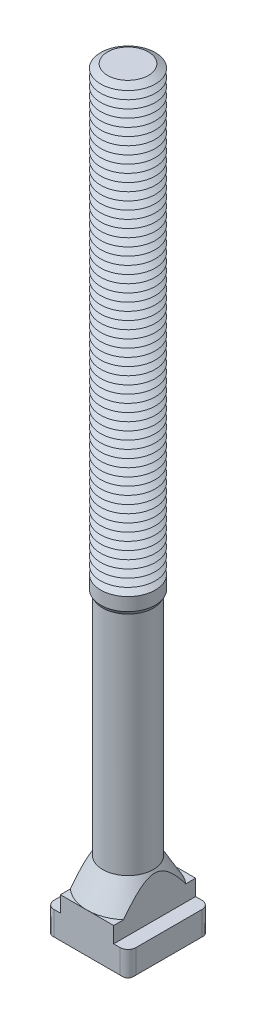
ISO-10303-21;
HEADER;
FILE_DESCRIPTION(('STEP AP214'),'2;1');
FILE_NAME('part.step','',(''),(''),'','','');
FILE_SCHEMA(('AUTOMOTIVE_DESIGN { 1 0 10303 214 1 1 1 1 }'));
ENDSEC;
DATA;
#1=APPLICATION_CONTEXT('core data for automotive mechanical design processes');
#2=APPLICATION_PROTOCOL_DEFINITION('international standard','automotive_design',2000,#1);
#3=PRODUCT_CONTEXT('',#1,'mechanical');
#4=PRODUCT('Part','Part','',(#3));
#5=PRODUCT_RELATED_PRODUCT_CATEGORY('part','',(#4));
#6=PRODUCT_DEFINITION_FORMATION('','',#4);
#7=PRODUCT_DEFINITION_CONTEXT('part definition',#1,'design');
#8=PRODUCT_DEFINITION('design','',#6,#7);
#9=PRODUCT_DEFINITION_SHAPE('','',#8);
#10=(LENGTH_UNIT() NAMED_UNIT(*) SI_UNIT(.MILLI.,.METRE.));
#11=(NAMED_UNIT(*) PLANE_ANGLE_UNIT() SI_UNIT($,.RADIAN.));
#12=(NAMED_UNIT(*) SI_UNIT($,.STERADIAN.) SOLID_ANGLE_UNIT());
#13=UNCERTAINTY_MEASURE_WITH_UNIT(LENGTH_MEASURE(1.E-05),#10,'distance_accuracy_value','');
#14=(GEOMETRIC_REPRESENTATION_CONTEXT(3) GLOBAL_UNCERTAINTY_ASSIGNED_CONTEXT((#13)) GLOBAL_UNIT_ASSIGNED_CONTEXT((#10,
#11,#12)) REPRESENTATION_CONTEXT('',''));
#15=CARTESIAN_POINT('',(0.,0.,0.));
#16=DIRECTION('',(0.,0.,1.));
#17=DIRECTION('',(1.,0.,0.));
#18=AXIS2_PLACEMENT_3D('',#15,#16,#17);
#19=CARTESIAN_POINT('',(0.,160.,0.));
#20=DIRECTION('',(0.,-1.,0.));
#21=DIRECTION('',(0.,0.,-1.));
#22=AXIS2_PLACEMENT_3D('',#19,#20,#21);
#23=CONICAL_SURFACE('',#22,4.48445554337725,1.04719755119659);
#24=CARTESIAN_POINT('',(0.,159.125,0.));
#25=DIRECTION('',(0.,-1.,0.));
#26=DIRECTION('',(0.,0.,-1.));
#27=AXIS2_PLACEMENT_3D('',#24,#25,#26);
#28=CIRCLE('',#27,6.00000000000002);
#29=CARTESIAN_POINT('',(0.,159.125,-6.00000000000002));
#30=VERTEX_POINT('',#29);
#31=EDGE_CURVE('E874',#30,#30,#28,.T.);
#32=ORIENTED_EDGE('',*,*,#31,.F.);
#33=EDGE_LOOP('',(#32));
#34=FACE_BOUND('',#33,.T.);
#35=CARTESIAN_POINT('',(0.,160.,0.));
#36=DIRECTION('',(0.,-1.,0.));
#37=DIRECTION('',(0.,0.,-1.));
#38=AXIS2_PLACEMENT_3D('',#35,#36,#37);
#39=CIRCLE('',#38,4.48445554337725);
#40=CARTESIAN_POINT('',(0.,160.,-4.48445554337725));
#41=VERTEX_POINT('',#40);
#42=EDGE_CURVE('E1082',#41,#41,#39,.T.);
#43=ORIENTED_EDGE('',*,*,#42,.T.);
#44=EDGE_LOOP('',(#43));
#45=FACE_BOUND('',#44,.T.);
#46=ADVANCED_FACE('F39',(#34,#45),#23,.T.);
#47=CARTESIAN_POINT('',(0.,160.875,0.));
#48=DIRECTION('',(0.,1.,0.));
#49=DIRECTION('',(0.,0.,1.));
#50=AXIS2_PLACEMENT_3D('',#47,#48,#49);
#51=CONICAL_SURFACE('',#50,6.00000000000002,1.0471975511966);
#52=ORIENTED_EDGE('',*,*,#42,.F.);
#53=EDGE_LOOP('',(#52));
#54=FACE_BOUND('',#53,.T.);
#55=CARTESIAN_POINT('',(0.,160.875,0.));
#56=DIRECTION('',(0.,-1.,0.));
#57=DIRECTION('',(0.,0.,-1.));
#58=AXIS2_PLACEMENT_3D('',#55,#56,#57);
#59=CIRCLE('',#58,6.00000000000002);
#60=CARTESIAN_POINT('',(0.,160.875,-6.00000000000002));
#61=VERTEX_POINT('',#60);
#62=EDGE_CURVE('E633',#61,#61,#59,.T.);
#63=ORIENTED_EDGE('',*,*,#62,.T.);
#64=EDGE_LOOP('',(#63));
#65=FACE_BOUND('',#64,.T.);
#66=ADVANCED_FACE('F449',(#54,#65),#51,.T.);
#67=CARTESIAN_POINT('',(2.99992102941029,167.,0.));
#68=DIRECTION('',(0.,-1.,0.));
#69=DIRECTION('',(1.,0.,0.));
#70=AXIS2_PLACEMENT_3D('',#67,#68,#69);
#71=PLANE('',#70);
#72=CARTESIAN_POINT('',(0.,167.,0.));
#73=DIRECTION('',(0.,-1.,0.));
#74=DIRECTION('',(0.,0.,-1.));
#75=AXIS2_PLACEMENT_3D('',#72,#73,#74);
#76=CIRCLE('',#75,4.48445554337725);
#77=CARTESIAN_POINT('',(0.,167.,-4.48445554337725));
#78=VERTEX_POINT('',#77);
#79=EDGE_CURVE('E787',#78,#78,#76,.T.);
#80=ORIENTED_EDGE('',*,*,#79,.F.);
#81=EDGE_LOOP('',(#80));
#82=FACE_BOUND('',#81,.T.);
#83=ADVANCED_FACE('F455',(#82),#71,.F.);
#84=CARTESIAN_POINT('',(0.,167.,0.));
#85=DIRECTION('',(0.,-1.,0.));
#86=DIRECTION('',(0.,0.,-1.));
#87=AXIS2_PLACEMENT_3D('',#84,#85,#86);
#88=CONICAL_SURFACE('',#87,4.48445554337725,1.04719755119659);
#89=CARTESIAN_POINT('',(0.,166.125,0.));
#90=DIRECTION('',(0.,-1.,0.));
#91=DIRECTION('',(0.,0.,-1.));
#92=AXIS2_PLACEMENT_3D('',#89,#90,#91);
#93=CIRCLE('',#92,6.00000000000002);
#94=CARTESIAN_POINT('',(0.,166.125,-6.00000000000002));
#95=VERTEX_POINT('',#94);
#96=EDGE_CURVE('E735',#95,#95,#93,.T.);
#97=ORIENTED_EDGE('',*,*,#96,.F.);
#98=EDGE_LOOP('',(#97));
#99=FACE_BOUND('',#98,.T.);
#100=ORIENTED_EDGE('',*,*,#79,.T.);
#101=EDGE_LOOP('',(#100));
#102=FACE_BOUND('',#101,.T.);
#103=ADVANCED_FACE('F483',(#99,#102),#88,.T.);
#104=CARTESIAN_POINT('',(0.,166.125,0.));
#105=DIRECTION('',(0.,1.,0.));
#106=DIRECTION('',(0.,0.,1.));
#107=AXIS2_PLACEMENT_3D('',#104,#105,#106);
#108=CONICAL_SURFACE('',#107,6.00000000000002,1.0471975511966);
#109=CARTESIAN_POINT('',(0.,165.25,0.));
#110=DIRECTION('',(0.,-1.,0.));
#111=DIRECTION('',(0.,0.,-1.));
#112=AXIS2_PLACEMENT_3D('',#109,#110,#111);
#113=CIRCLE('',#112,4.48445554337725);
#114=CARTESIAN_POINT('',(0.,165.25,-4.48445554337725));
#115=VERTEX_POINT('',#114);
#116=EDGE_CURVE('E733',#115,#115,#113,.T.);
#117=ORIENTED_EDGE('',*,*,#116,.F.);
#118=EDGE_LOOP('',(#117));
#119=FACE_BOUND('',#118,.T.);
#120=ORIENTED_EDGE('',*,*,#96,.T.);
#121=EDGE_LOOP('',(#120));
#122=FACE_BOUND('',#121,.T.);
#123=ADVANCED_FACE('F480',(#119,#122),#108,.T.);
#124=CARTESIAN_POINT('',(0.,165.25,0.));
#125=DIRECTION('',(0.,-1.,0.));
#126=DIRECTION('',(0.,0.,-1.));
#127=AXIS2_PLACEMENT_3D('',#124,#125,#126);
#128=CONICAL_SURFACE('',#127,4.48445554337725,1.04719755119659);
#129=CARTESIAN_POINT('',(0.,164.375,0.));
#130=DIRECTION('',(0.,-1.,0.));
#131=DIRECTION('',(0.,0.,-1.));
#132=AXIS2_PLACEMENT_3D('',#129,#130,#131);
#133=CIRCLE('',#132,6.00000000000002);
#134=CARTESIAN_POINT('',(0.,164.375,-6.00000000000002));
#135=VERTEX_POINT('',#134);
#136=EDGE_CURVE('E736',#135,#135,#133,.T.);
#137=ORIENTED_EDGE('',*,*,#136,.F.);
#138=EDGE_LOOP('',(#137));
#139=FACE_BOUND('',#138,.T.);
#140=ORIENTED_EDGE('',*,*,#116,.T.);
#141=EDGE_LOOP('',(#140));
#142=FACE_BOUND('',#141,.T.);
#143=ADVANCED_FACE('F475',(#139,#142),#128,.T.);
#144=CARTESIAN_POINT('',(0.,164.375,0.));
#145=DIRECTION('',(0.,1.,0.));
#146=DIRECTION('',(0.,0.,1.));
#147=AXIS2_PLACEMENT_3D('',#144,#145,#146);
#148=CONICAL_SURFACE('',#147,6.00000000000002,1.0471975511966);
#149=CARTESIAN_POINT('',(0.,163.5,0.));
#150=DIRECTION('',(0.,-1.,0.));
#151=DIRECTION('',(0.,0.,-1.));
#152=AXIS2_PLACEMENT_3D('',#149,#150,#151);
#153=CIRCLE('',#152,4.48445554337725);
#154=CARTESIAN_POINT('',(0.,163.5,-4.48445554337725));
#155=VERTEX_POINT('',#154);
#156=EDGE_CURVE('E853',#155,#155,#153,.T.);
#157=ORIENTED_EDGE('',*,*,#156,.F.);
#158=EDGE_LOOP('',(#157));
#159=FACE_BOUND('',#158,.T.);
#160=ORIENTED_EDGE('',*,*,#136,.T.);
#161=EDGE_LOOP('',(#160));
#162=FACE_BOUND('',#161,.T.);
#163=ADVANCED_FACE('F472',(#159,#162),#148,.T.);
#164=CARTESIAN_POINT('',(0.,163.5,0.));
#165=DIRECTION('',(0.,-1.,0.));
#166=DIRECTION('',(0.,0.,-1.));
#167=AXIS2_PLACEMENT_3D('',#164,#165,#166);
#168=CONICAL_SURFACE('',#167,4.48445554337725,1.04719755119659);
#169=CARTESIAN_POINT('',(0.,162.625,0.));
#170=DIRECTION('',(0.,-1.,0.));
#171=DIRECTION('',(0.,0.,-1.));
#172=AXIS2_PLACEMENT_3D('',#169,#170,#171);
#173=CIRCLE('',#172,6.00000000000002);
#174=CARTESIAN_POINT('',(0.,162.625,-6.00000000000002));
#175=VERTEX_POINT('',#174);
#176=EDGE_CURVE('E662',#175,#175,#173,.T.);
#177=ORIENTED_EDGE('',*,*,#176,.F.);
#178=EDGE_LOOP('',(#177));
#179=FACE_BOUND('',#178,.T.);
#180=ORIENTED_EDGE('',*,*,#156,.T.);
#181=EDGE_LOOP('',(#180));
#182=FACE_BOUND('',#181,.T.);
#183=ADVANCED_FACE('F466',(#179,#182),#168,.T.);
#184=CARTESIAN_POINT('',(0.,162.625,0.));
#185=DIRECTION('',(0.,1.,0.));
#186=DIRECTION('',(0.,0.,1.));
#187=AXIS2_PLACEMENT_3D('',#184,#185,#186);
#188=CONICAL_SURFACE('',#187,6.00000000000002,1.0471975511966);
#189=CARTESIAN_POINT('',(0.,161.75,0.));
#190=DIRECTION('',(0.,-1.,0.));
#191=DIRECTION('',(0.,0.,-1.));
#192=AXIS2_PLACEMENT_3D('',#189,#190,#191);
#193=CIRCLE('',#192,4.48445554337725);
#194=CARTESIAN_POINT('',(0.,161.75,-4.48445554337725));
#195=VERTEX_POINT('',#194);
#196=EDGE_CURVE('E660',#195,#195,#193,.T.);
#197=ORIENTED_EDGE('',*,*,#196,.F.);
#198=EDGE_LOOP('',(#197));
#199=FACE_BOUND('',#198,.T.);
#200=ORIENTED_EDGE('',*,*,#176,.T.);
#201=EDGE_LOOP('',(#200));
#202=FACE_BOUND('',#201,.T.);
#203=ADVANCED_FACE('F462',(#199,#202),#188,.T.);
#204=CARTESIAN_POINT('',(0.,161.75,0.));
#205=DIRECTION('',(0.,-1.,0.));
#206=DIRECTION('',(0.,0.,-1.));
#207=AXIS2_PLACEMENT_3D('',#204,#205,#206);
#208=CONICAL_SURFACE('',#207,4.48445554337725,1.04719755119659);
#209=ORIENTED_EDGE('',*,*,#62,.F.);
#210=EDGE_LOOP('',(#209));
#211=FACE_BOUND('',#210,.T.);
#212=ORIENTED_EDGE('',*,*,#196,.T.);
#213=EDGE_LOOP('',(#212));
#214=FACE_BOUND('',#213,.T.);
#215=ADVANCED_FACE('F465',(#211,#214),#208,.T.);
#216=CARTESIAN_POINT('',(0.,158.25,0.));
#217=DIRECTION('',(0.,-1.,0.));
#218=DIRECTION('',(0.,0.,-1.));
#219=AXIS2_PLACEMENT_3D('',#216,#217,#218);
#220=CONICAL_SURFACE('',#219,4.48445554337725,1.04719755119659);
#221=CARTESIAN_POINT('',(0.,157.375,0.));
#222=DIRECTION('',(0.,-1.,0.));
#223=DIRECTION('',(0.,0.,-1.));
#224=AXIS2_PLACEMENT_3D('',#221,#222,#223);
#225=CIRCLE('',#224,6.00000000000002);
#226=CARTESIAN_POINT('',(0.,157.375,-6.00000000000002));
#227=VERTEX_POINT('',#226);
#228=EDGE_CURVE('E875',#227,#227,#225,.T.);
#229=ORIENTED_EDGE('',*,*,#228,.F.);
#230=EDGE_LOOP('',(#229));
#231=FACE_BOUND('',#230,.T.);
#232=CARTESIAN_POINT('',(0.,158.25,0.));
#233=DIRECTION('',(0.,-1.,0.));
#234=DIRECTION('',(0.,0.,-1.));
#235=AXIS2_PLACEMENT_3D('',#232,#233,#234);
#236=CIRCLE('',#235,4.48445554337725);
#237=CARTESIAN_POINT('',(0.,158.25,-4.48445554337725));
#238=VERTEX_POINT('',#237);
#239=EDGE_CURVE('E871',#238,#238,#236,.T.);
#240=ORIENTED_EDGE('',*,*,#239,.T.);
#241=EDGE_LOOP('',(#240));
#242=FACE_BOUND('',#241,.T.);
#243=ADVANCED_FACE('F470',(#231,#242),#220,.T.);
#244=CARTESIAN_POINT('',(0.,159.125,0.));
#245=DIRECTION('',(0.,1.,0.));
#246=DIRECTION('',(0.,0.,1.));
#247=AXIS2_PLACEMENT_3D('',#244,#245,#246);
#248=CONICAL_SURFACE('',#247,6.00000000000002,1.0471975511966);
#249=ORIENTED_EDGE('',*,*,#239,.F.);
#250=EDGE_LOOP('',(#249));
#251=FACE_BOUND('',#250,.T.);
#252=ORIENTED_EDGE('',*,*,#31,.T.);
#253=EDGE_LOOP('',(#252));
#254=FACE_BOUND('',#253,.T.);
#255=ADVANCED_FACE('F1500',(#251,#254),#248,.T.);
#256=CARTESIAN_POINT('',(0.,156.5,0.));
#257=DIRECTION('',(0.,-1.,0.));
#258=DIRECTION('',(0.,0.,-1.));
#259=AXIS2_PLACEMENT_3D('',#256,#257,#258);
#260=CONICAL_SURFACE('',#259,4.48445554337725,1.04719755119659);
#261=CARTESIAN_POINT('',(0.,155.625,0.));
#262=DIRECTION('',(0.,-1.,0.));
#263=DIRECTION('',(0.,0.,-1.));
#264=AXIS2_PLACEMENT_3D('',#261,#262,#263);
#265=CIRCLE('',#264,6.00000000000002);
#266=CARTESIAN_POINT('',(0.,155.625,-6.00000000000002));
#267=VERTEX_POINT('',#266);
#268=EDGE_CURVE('E771',#267,#267,#265,.T.);
#269=ORIENTED_EDGE('',*,*,#268,.F.);
#270=EDGE_LOOP('',(#269));
#271=FACE_BOUND('',#270,.T.);
#272=CARTESIAN_POINT('',(0.,156.5,0.));
#273=DIRECTION('',(0.,-1.,0.));
#274=DIRECTION('',(0.,0.,-1.));
#275=AXIS2_PLACEMENT_3D('',#272,#273,#274);
#276=CIRCLE('',#275,4.48445554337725);
#277=CARTESIAN_POINT('',(0.,156.5,-4.48445554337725));
#278=VERTEX_POINT('',#277);
#279=EDGE_CURVE('E1073',#278,#278,#276,.T.);
#280=ORIENTED_EDGE('',*,*,#279,.T.);
#281=EDGE_LOOP('',(#280));
#282=FACE_BOUND('',#281,.T.);
#283=ADVANCED_FACE('F1496',(#271,#282),#260,.T.);
#284=CARTESIAN_POINT('',(0.,157.375,0.));
#285=DIRECTION('',(0.,1.,0.));
#286=DIRECTION('',(0.,0.,1.));
#287=AXIS2_PLACEMENT_3D('',#284,#285,#286);
#288=CONICAL_SURFACE('',#287,6.00000000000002,1.0471975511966);
#289=ORIENTED_EDGE('',*,*,#279,.F.);
#290=EDGE_LOOP('',(#289));
#291=FACE_BOUND('',#290,.T.);
#292=ORIENTED_EDGE('',*,*,#228,.T.);
#293=EDGE_LOOP('',(#292));
#294=FACE_BOUND('',#293,.T.);
#295=ADVANCED_FACE('F1492',(#291,#294),#288,.T.);
#296=CARTESIAN_POINT('',(0.,154.75,0.));
#297=DIRECTION('',(0.,-1.,0.));
#298=DIRECTION('',(0.,0.,-1.));
#299=AXIS2_PLACEMENT_3D('',#296,#297,#298);
#300=CONICAL_SURFACE('',#299,4.48445554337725,1.04719755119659);
#301=CARTESIAN_POINT('',(0.,153.875,0.));
#302=DIRECTION('',(0.,-1.,0.));
#303=DIRECTION('',(0.,0.,-1.));
#304=AXIS2_PLACEMENT_3D('',#301,#302,#303);
#305=CIRCLE('',#304,6.00000000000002);
#306=CARTESIAN_POINT('',(0.,153.875,-6.00000000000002));
#307=VERTEX_POINT('',#306);
#308=EDGE_CURVE('E772',#307,#307,#305,.T.);
#309=ORIENTED_EDGE('',*,*,#308,.F.);
#310=EDGE_LOOP('',(#309));
#311=FACE_BOUND('',#310,.T.);
#312=CARTESIAN_POINT('',(0.,154.75,0.));
#313=DIRECTION('',(0.,-1.,0.));
#314=DIRECTION('',(0.,0.,-1.));
#315=AXIS2_PLACEMENT_3D('',#312,#313,#314);
#316=CIRCLE('',#315,4.48445554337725);
#317=CARTESIAN_POINT('',(0.,154.75,-4.48445554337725));
#318=VERTEX_POINT('',#317);
#319=EDGE_CURVE('E768',#318,#318,#316,.T.);
#320=ORIENTED_EDGE('',*,*,#319,.T.);
#321=EDGE_LOOP('',(#320));
#322=FACE_BOUND('',#321,.T.);
#323=ADVANCED_FACE('F1488',(#311,#322),#300,.T.);
#324=CARTESIAN_POINT('',(0.,155.625,0.));
#325=DIRECTION('',(0.,1.,0.));
#326=DIRECTION('',(0.,0.,1.));
#327=AXIS2_PLACEMENT_3D('',#324,#325,#326);
#328=CONICAL_SURFACE('',#327,6.00000000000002,1.0471975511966);
#329=ORIENTED_EDGE('',*,*,#319,.F.);
#330=EDGE_LOOP('',(#329));
#331=FACE_BOUND('',#330,.T.);
#332=ORIENTED_EDGE('',*,*,#268,.T.);
#333=EDGE_LOOP('',(#332));
#334=FACE_BOUND('',#333,.T.);
#335=ADVANCED_FACE('F1484',(#331,#334),#328,.T.);
#336=CARTESIAN_POINT('',(0.,153.,0.));
#337=DIRECTION('',(0.,-1.,0.));
#338=DIRECTION('',(0.,0.,-1.));
#339=AXIS2_PLACEMENT_3D('',#336,#337,#338);
#340=CONICAL_SURFACE('',#339,4.48445554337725,1.04719755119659);
#341=CARTESIAN_POINT('',(0.,152.125,0.));
#342=DIRECTION('',(0.,-1.,0.));
#343=DIRECTION('',(0.,0.,-1.));
#344=AXIS2_PLACEMENT_3D('',#341,#342,#343);
#345=CIRCLE('',#344,6.00000000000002);
#346=CARTESIAN_POINT('',(0.,152.125,-6.00000000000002));
#347=VERTEX_POINT('',#346);
#348=EDGE_CURVE('E907',#347,#347,#345,.T.);
#349=ORIENTED_EDGE('',*,*,#348,.F.);
#350=EDGE_LOOP('',(#349));
#351=FACE_BOUND('',#350,.T.);
#352=CARTESIAN_POINT('',(0.,153.,0.));
#353=DIRECTION('',(0.,-1.,0.));
#354=DIRECTION('',(0.,0.,-1.));
#355=AXIS2_PLACEMENT_3D('',#352,#353,#354);
#356=CIRCLE('',#355,4.48445554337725);
#357=CARTESIAN_POINT('',(0.,153.,-4.48445554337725));
#358=VERTEX_POINT('',#357);
#359=EDGE_CURVE('E775',#358,#358,#356,.T.);
#360=ORIENTED_EDGE('',*,*,#359,.T.);
#361=EDGE_LOOP('',(#360));
#362=FACE_BOUND('',#361,.T.);
#363=ADVANCED_FACE('F1480',(#351,#362),#340,.T.);
#364=CARTESIAN_POINT('',(0.,153.875,0.));
#365=DIRECTION('',(0.,1.,0.));
#366=DIRECTION('',(0.,0.,1.));
#367=AXIS2_PLACEMENT_3D('',#364,#365,#366);
#368=CONICAL_SURFACE('',#367,6.00000000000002,1.0471975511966);
#369=ORIENTED_EDGE('',*,*,#359,.F.);
#370=EDGE_LOOP('',(#369));
#371=FACE_BOUND('',#370,.T.);
#372=ORIENTED_EDGE('',*,*,#308,.T.);
#373=EDGE_LOOP('',(#372));
#374=FACE_BOUND('',#373,.T.);
#375=ADVANCED_FACE('F1476',(#371,#374),#368,.T.);
#376=CARTESIAN_POINT('',(0.,151.25,0.));
#377=DIRECTION('',(0.,-1.,0.));
#378=DIRECTION('',(0.,0.,-1.));
#379=AXIS2_PLACEMENT_3D('',#376,#377,#378);
#380=CONICAL_SURFACE('',#379,4.48445554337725,1.04719755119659);
#381=CARTESIAN_POINT('',(0.,150.375,0.));
#382=DIRECTION('',(0.,-1.,0.));
#383=DIRECTION('',(0.,0.,-1.));
#384=AXIS2_PLACEMENT_3D('',#381,#382,#383);
#385=CIRCLE('',#384,6.00000000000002);
#386=CARTESIAN_POINT('',(0.,150.375,-6.00000000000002));
#387=VERTEX_POINT('',#386);
#388=EDGE_CURVE('E690',#387,#387,#385,.T.);
#389=ORIENTED_EDGE('',*,*,#388,.F.);
#390=EDGE_LOOP('',(#389));
#391=FACE_BOUND('',#390,.T.);
#392=CARTESIAN_POINT('',(0.,151.25,0.));
#393=DIRECTION('',(0.,-1.,0.));
#394=DIRECTION('',(0.,0.,-1.));
#395=AXIS2_PLACEMENT_3D('',#392,#393,#394);
#396=CIRCLE('',#395,4.48445554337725);
#397=CARTESIAN_POINT('',(0.,151.25,-4.48445554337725));
#398=VERTEX_POINT('',#397);
#399=EDGE_CURVE('E910',#398,#398,#396,.T.);
#400=ORIENTED_EDGE('',*,*,#399,.T.);
#401=EDGE_LOOP('',(#400));
#402=FACE_BOUND('',#401,.T.);
#403=ADVANCED_FACE('F1472',(#391,#402),#380,.T.);
#404=CARTESIAN_POINT('',(0.,152.125,0.));
#405=DIRECTION('',(0.,1.,0.));
#406=DIRECTION('',(0.,0.,1.));
#407=AXIS2_PLACEMENT_3D('',#404,#405,#406);
#408=CONICAL_SURFACE('',#407,6.00000000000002,1.0471975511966);
#409=ORIENTED_EDGE('',*,*,#399,.F.);
#410=EDGE_LOOP('',(#409));
#411=FACE_BOUND('',#410,.T.);
#412=ORIENTED_EDGE('',*,*,#348,.T.);
#413=EDGE_LOOP('',(#412));
#414=FACE_BOUND('',#413,.T.);
#415=ADVANCED_FACE('F1468',(#411,#414),#408,.T.);
#416=CARTESIAN_POINT('',(0.,149.5,0.));
#417=DIRECTION('',(0.,-1.,0.));
#418=DIRECTION('',(0.,0.,-1.));
#419=AXIS2_PLACEMENT_3D('',#416,#417,#418);
#420=CONICAL_SURFACE('',#419,4.48445554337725,1.04719755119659);
#421=CARTESIAN_POINT('',(0.,148.625,0.));
#422=DIRECTION('',(0.,-1.,0.));
#423=DIRECTION('',(0.,0.,-1.));
#424=AXIS2_PLACEMENT_3D('',#421,#422,#423);
#425=CIRCLE('',#424,6.00000000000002);
#426=CARTESIAN_POINT('',(0.,148.625,-6.00000000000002));
#427=VERTEX_POINT('',#426);
#428=EDGE_CURVE('E691',#427,#427,#425,.T.);
#429=ORIENTED_EDGE('',*,*,#428,.F.);
#430=EDGE_LOOP('',(#429));
#431=FACE_BOUND('',#430,.T.);
#432=CARTESIAN_POINT('',(0.,149.5,0.));
#433=DIRECTION('',(0.,-1.,0.));
#434=DIRECTION('',(0.,0.,-1.));
#435=AXIS2_PLACEMENT_3D('',#432,#433,#434);
#436=CIRCLE('',#435,4.48445554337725);
#437=CARTESIAN_POINT('',(0.,149.5,-4.48445554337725));
#438=VERTEX_POINT('',#437);
#439=EDGE_CURVE('E687',#438,#438,#436,.T.);
#440=ORIENTED_EDGE('',*,*,#439,.T.);
#441=EDGE_LOOP('',(#440));
#442=FACE_BOUND('',#441,.T.);
#443=ADVANCED_FACE('F1464',(#431,#442),#420,.T.);
#444=CARTESIAN_POINT('',(0.,150.375,0.));
#445=DIRECTION('',(0.,1.,0.));
#446=DIRECTION('',(0.,0.,1.));
#447=AXIS2_PLACEMENT_3D('',#444,#445,#446);
#448=CONICAL_SURFACE('',#447,6.00000000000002,1.0471975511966);
#449=ORIENTED_EDGE('',*,*,#439,.F.);
#450=EDGE_LOOP('',(#449));
#451=FACE_BOUND('',#450,.T.);
#452=ORIENTED_EDGE('',*,*,#388,.T.);
#453=EDGE_LOOP('',(#452));
#454=FACE_BOUND('',#453,.T.);
#455=ADVANCED_FACE('F1460',(#451,#454),#448,.T.);
#456=CARTESIAN_POINT('',(0.,147.75,0.));
#457=DIRECTION('',(0.,-1.,0.));
#458=DIRECTION('',(0.,0.,-1.));
#459=AXIS2_PLACEMENT_3D('',#456,#457,#458);
#460=CONICAL_SURFACE('',#459,4.48445554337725,1.04719755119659);
#461=CARTESIAN_POINT('',(0.,146.875,0.));
#462=DIRECTION('',(0.,-1.,0.));
#463=DIRECTION('',(0.,0.,-1.));
#464=AXIS2_PLACEMENT_3D('',#461,#462,#463);
#465=CIRCLE('',#464,6.00000000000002);
#466=CARTESIAN_POINT('',(0.,146.875,-6.00000000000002));
#467=VERTEX_POINT('',#466);
#468=EDGE_CURVE('E730',#467,#467,#465,.T.);
#469=ORIENTED_EDGE('',*,*,#468,.F.);
#470=EDGE_LOOP('',(#469));
#471=FACE_BOUND('',#470,.T.);
#472=CARTESIAN_POINT('',(0.,147.75,0.));
#473=DIRECTION('',(0.,-1.,0.));
#474=DIRECTION('',(0.,0.,-1.));
#475=AXIS2_PLACEMENT_3D('',#472,#473,#474);
#476=CIRCLE('',#475,4.48445554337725);
#477=CARTESIAN_POINT('',(0.,147.75,-4.48445554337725));
#478=VERTEX_POINT('',#477);
#479=EDGE_CURVE('E817',#478,#478,#476,.T.);
#480=ORIENTED_EDGE('',*,*,#479,.T.);
#481=EDGE_LOOP('',(#480));
#482=FACE_BOUND('',#481,.T.);
#483=ADVANCED_FACE('F1456',(#471,#482),#460,.T.);
#484=CARTESIAN_POINT('',(0.,148.625,0.));
#485=DIRECTION('',(0.,1.,0.));
#486=DIRECTION('',(0.,0.,1.));
#487=AXIS2_PLACEMENT_3D('',#484,#485,#486);
#488=CONICAL_SURFACE('',#487,6.00000000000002,1.0471975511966);
#489=ORIENTED_EDGE('',*,*,#479,.F.);
#490=EDGE_LOOP('',(#489));
#491=FACE_BOUND('',#490,.T.);
#492=ORIENTED_EDGE('',*,*,#428,.T.);
#493=EDGE_LOOP('',(#492));
#494=FACE_BOUND('',#493,.T.);
#495=ADVANCED_FACE('F1452',(#491,#494),#488,.T.);
#496=CARTESIAN_POINT('',(0.,146.,0.));
#497=DIRECTION('',(0.,-1.,0.));
#498=DIRECTION('',(0.,0.,-1.));
#499=AXIS2_PLACEMENT_3D('',#496,#497,#498);
#500=CONICAL_SURFACE('',#499,4.48445554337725,1.04719755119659);
#501=CARTESIAN_POINT('',(0.,145.125,0.));
#502=DIRECTION('',(0.,-1.,0.));
#503=DIRECTION('',(0.,0.,-1.));
#504=AXIS2_PLACEMENT_3D('',#501,#502,#503);
#505=CIRCLE('',#504,6.00000000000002);
#506=CARTESIAN_POINT('',(0.,145.125,-6.00000000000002));
#507=VERTEX_POINT('',#506);
#508=EDGE_CURVE('E731',#507,#507,#505,.T.);
#509=ORIENTED_EDGE('',*,*,#508,.F.);
#510=EDGE_LOOP('',(#509));
#511=FACE_BOUND('',#510,.T.);
#512=CARTESIAN_POINT('',(0.,146.,0.));
#513=DIRECTION('',(0.,-1.,0.));
#514=DIRECTION('',(0.,0.,-1.));
#515=AXIS2_PLACEMENT_3D('',#512,#513,#514);
#516=CIRCLE('',#515,4.48445554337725);
#517=CARTESIAN_POINT('',(0.,146.,-4.48445554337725));
#518=VERTEX_POINT('',#517);
#519=EDGE_CURVE('E727',#518,#518,#516,.T.);
#520=ORIENTED_EDGE('',*,*,#519,.T.);
#521=EDGE_LOOP('',(#520));
#522=FACE_BOUND('',#521,.T.);
#523=ADVANCED_FACE('F1448',(#511,#522),#500,.T.);
#524=CARTESIAN_POINT('',(0.,146.875,0.));
#525=DIRECTION('',(0.,1.,0.));
#526=DIRECTION('',(0.,0.,1.));
#527=AXIS2_PLACEMENT_3D('',#524,#525,#526);
#528=CONICAL_SURFACE('',#527,6.00000000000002,1.0471975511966);
#529=ORIENTED_EDGE('',*,*,#519,.F.);
#530=EDGE_LOOP('',(#529));
#531=FACE_BOUND('',#530,.T.);
#532=ORIENTED_EDGE('',*,*,#468,.T.);
#533=EDGE_LOOP('',(#532));
#534=FACE_BOUND('',#533,.T.);
#535=ADVANCED_FACE('F1444',(#531,#534),#528,.T.);
#536=CARTESIAN_POINT('',(0.,144.25,0.));
#537=DIRECTION('',(0.,-1.,0.));
#538=DIRECTION('',(0.,0.,-1.));
#539=AXIS2_PLACEMENT_3D('',#536,#537,#538);
#540=CONICAL_SURFACE('',#539,4.48445554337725,1.04719755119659);
#541=CARTESIAN_POINT('',(0.,143.375,0.));
#542=DIRECTION('',(0.,-1.,0.));
#543=DIRECTION('',(0.,0.,-1.));
#544=AXIS2_PLACEMENT_3D('',#541,#542,#543);
#545=CIRCLE('',#544,6.00000000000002);
#546=CARTESIAN_POINT('',(0.,143.375,-6.00000000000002));
#547=VERTEX_POINT('',#546);
#548=EDGE_CURVE('E851',#547,#547,#545,.T.);
#549=ORIENTED_EDGE('',*,*,#548,.F.);
#550=EDGE_LOOP('',(#549));
#551=FACE_BOUND('',#550,.T.);
#552=CARTESIAN_POINT('',(0.,144.25,0.));
#553=DIRECTION('',(0.,-1.,0.));
#554=DIRECTION('',(0.,0.,-1.));
#555=AXIS2_PLACEMENT_3D('',#552,#553,#554);
#556=CIRCLE('',#555,4.48445554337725);
#557=CARTESIAN_POINT('',(0.,144.25,-4.48445554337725));
#558=VERTEX_POINT('',#557);
#559=EDGE_CURVE('E877',#558,#558,#556,.T.);
#560=ORIENTED_EDGE('',*,*,#559,.T.);
#561=EDGE_LOOP('',(#560));
#562=FACE_BOUND('',#561,.T.);
#563=ADVANCED_FACE('F1440',(#551,#562),#540,.T.);
#564=CARTESIAN_POINT('',(0.,145.125,0.));
#565=DIRECTION('',(0.,1.,0.));
#566=DIRECTION('',(0.,0.,1.));
#567=AXIS2_PLACEMENT_3D('',#564,#565,#566);
#568=CONICAL_SURFACE('',#567,6.00000000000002,1.0471975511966);
#569=ORIENTED_EDGE('',*,*,#559,.F.);
#570=EDGE_LOOP('',(#569));
#571=FACE_BOUND('',#570,.T.);
#572=ORIENTED_EDGE('',*,*,#508,.T.);
#573=EDGE_LOOP('',(#572));
#574=FACE_BOUND('',#573,.T.);
#575=ADVANCED_FACE('F1436',(#571,#574),#568,.T.);
#576=CARTESIAN_POINT('',(0.,142.5,0.));
#577=DIRECTION('',(0.,-1.,0.));
#578=DIRECTION('',(0.,0.,-1.));
#579=AXIS2_PLACEMENT_3D('',#576,#577,#578);
#580=CONICAL_SURFACE('',#579,4.48445554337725,1.04719755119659);
#581=CARTESIAN_POINT('',(0.,141.625,0.));
#582=DIRECTION('',(0.,-1.,0.));
#583=DIRECTION('',(0.,0.,-1.));
#584=AXIS2_PLACEMENT_3D('',#581,#582,#583);
#585=CIRCLE('',#584,6.00000000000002);
#586=CARTESIAN_POINT('',(0.,141.625,-6.00000000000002));
#587=VERTEX_POINT('',#586);
#588=EDGE_CURVE('E846',#587,#587,#585,.T.);
#589=ORIENTED_EDGE('',*,*,#588,.F.);
#590=EDGE_LOOP('',(#589));
#591=FACE_BOUND('',#590,.T.);
#592=CARTESIAN_POINT('',(0.,142.5,0.));
#593=DIRECTION('',(0.,-1.,0.));
#594=DIRECTION('',(0.,0.,-1.));
#595=AXIS2_PLACEMENT_3D('',#592,#593,#594);
#596=CIRCLE('',#595,4.48445554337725);
#597=CARTESIAN_POINT('',(0.,142.5,-4.48445554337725));
#598=VERTEX_POINT('',#597);
#599=EDGE_CURVE('E848',#598,#598,#596,.T.);
#600=ORIENTED_EDGE('',*,*,#599,.T.);
#601=EDGE_LOOP('',(#600));
#602=FACE_BOUND('',#601,.T.);
#603=ADVANCED_FACE('F1432',(#591,#602),#580,.T.);
#604=CARTESIAN_POINT('',(0.,143.375,0.));
#605=DIRECTION('',(0.,1.,0.));
#606=DIRECTION('',(0.,0.,1.));
#607=AXIS2_PLACEMENT_3D('',#604,#605,#606);
#608=CONICAL_SURFACE('',#607,6.00000000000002,1.0471975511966);
#609=ORIENTED_EDGE('',*,*,#599,.F.);
#610=EDGE_LOOP('',(#609));
#611=FACE_BOUND('',#610,.T.);
#612=ORIENTED_EDGE('',*,*,#548,.T.);
#613=EDGE_LOOP('',(#612));
#614=FACE_BOUND('',#613,.T.);
#615=ADVANCED_FACE('F1428',(#611,#614),#608,.T.);
#616=CARTESIAN_POINT('',(0.,140.75,0.));
#617=DIRECTION('',(0.,-1.,0.));
#618=DIRECTION('',(0.,0.,-1.));
#619=AXIS2_PLACEMENT_3D('',#616,#617,#618);
#620=CONICAL_SURFACE('',#619,4.48445554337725,1.04719755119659);
#621=CARTESIAN_POINT('',(0.,139.875,0.));
#622=DIRECTION('',(0.,-1.,0.));
#623=DIRECTION('',(0.,0.,-1.));
#624=AXIS2_PLACEMENT_3D('',#621,#622,#623);
#625=CIRCLE('',#624,6.00000000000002);
#626=CARTESIAN_POINT('',(0.,139.875,-6.00000000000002));
#627=VERTEX_POINT('',#626);
#628=EDGE_CURVE('E684',#627,#627,#625,.T.);
#629=ORIENTED_EDGE('',*,*,#628,.F.);
#630=EDGE_LOOP('',(#629));
#631=FACE_BOUND('',#630,.T.);
#632=CARTESIAN_POINT('',(0.,140.75,0.));
#633=DIRECTION('',(0.,-1.,0.));
#634=DIRECTION('',(0.,0.,-1.));
#635=AXIS2_PLACEMENT_3D('',#632,#633,#634);
#636=CIRCLE('',#635,4.48445554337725);
#637=CARTESIAN_POINT('',(0.,140.75,-4.48445554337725));
#638=VERTEX_POINT('',#637);
#639=EDGE_CURVE('E725',#638,#638,#636,.T.);
#640=ORIENTED_EDGE('',*,*,#639,.T.);
#641=EDGE_LOOP('',(#640));
#642=FACE_BOUND('',#641,.T.);
#643=ADVANCED_FACE('F1424',(#631,#642),#620,.T.);
#644=CARTESIAN_POINT('',(0.,141.625,0.));
#645=DIRECTION('',(0.,1.,0.));
#646=DIRECTION('',(0.,0.,1.));
#647=AXIS2_PLACEMENT_3D('',#644,#645,#646);
#648=CONICAL_SURFACE('',#647,6.00000000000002,1.0471975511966);
#649=ORIENTED_EDGE('',*,*,#639,.F.);
#650=EDGE_LOOP('',(#649));
#651=FACE_BOUND('',#650,.T.);
#652=ORIENTED_EDGE('',*,*,#588,.T.);
#653=EDGE_LOOP('',(#652));
#654=FACE_BOUND('',#653,.T.);
#655=ADVANCED_FACE('F1420',(#651,#654),#648,.T.);
#656=CARTESIAN_POINT('',(0.,139.,0.));
#657=DIRECTION('',(0.,-1.,0.));
#658=DIRECTION('',(0.,0.,-1.));
#659=AXIS2_PLACEMENT_3D('',#656,#657,#658);
#660=CONICAL_SURFACE('',#659,4.48445554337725,1.04719755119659);
#661=CARTESIAN_POINT('',(0.,138.125,0.));
#662=DIRECTION('',(0.,-1.,0.));
#663=DIRECTION('',(0.,0.,-1.));
#664=AXIS2_PLACEMENT_3D('',#661,#662,#663);
#665=CIRCLE('',#664,6.00000000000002);
#666=CARTESIAN_POINT('',(0.,138.125,-6.00000000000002));
#667=VERTEX_POINT('',#666);
#668=EDGE_CURVE('E685',#667,#667,#665,.T.);
#669=ORIENTED_EDGE('',*,*,#668,.F.);
#670=EDGE_LOOP('',(#669));
#671=FACE_BOUND('',#670,.T.);
#672=CARTESIAN_POINT('',(0.,139.,0.));
#673=DIRECTION('',(0.,-1.,0.));
#674=DIRECTION('',(0.,0.,-1.));
#675=AXIS2_PLACEMENT_3D('',#672,#673,#674);
#676=CIRCLE('',#675,4.48445554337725);
#677=CARTESIAN_POINT('',(0.,139.,-4.48445554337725));
#678=VERTEX_POINT('',#677);
#679=EDGE_CURVE('E681',#678,#678,#676,.T.);
#680=ORIENTED_EDGE('',*,*,#679,.T.);
#681=EDGE_LOOP('',(#680));
#682=FACE_BOUND('',#681,.T.);
#683=ADVANCED_FACE('F1416',(#671,#682),#660,.T.);
#684=CARTESIAN_POINT('',(0.,139.875,0.));
#685=DIRECTION('',(0.,1.,0.));
#686=DIRECTION('',(0.,0.,1.));
#687=AXIS2_PLACEMENT_3D('',#684,#685,#686);
#688=CONICAL_SURFACE('',#687,6.00000000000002,1.0471975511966);
#689=ORIENTED_EDGE('',*,*,#679,.F.);
#690=EDGE_LOOP('',(#689));
#691=FACE_BOUND('',#690,.T.);
#692=ORIENTED_EDGE('',*,*,#628,.T.);
#693=EDGE_LOOP('',(#692));
#694=FACE_BOUND('',#693,.T.);
#695=ADVANCED_FACE('F1412',(#691,#694),#688,.T.);
#696=CARTESIAN_POINT('',(0.,137.25,0.));
#697=DIRECTION('',(0.,-1.,0.));
#698=DIRECTION('',(0.,0.,-1.));
#699=AXIS2_PLACEMENT_3D('',#696,#697,#698);
#700=CONICAL_SURFACE('',#699,4.48445554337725,1.04719755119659);
#701=CARTESIAN_POINT('',(0.,136.375,0.));
#702=DIRECTION('',(0.,-1.,0.));
#703=DIRECTION('',(0.,0.,-1.));
#704=AXIS2_PLACEMENT_3D('',#701,#702,#703);
#705=CIRCLE('',#704,6.00000000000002);
#706=CARTESIAN_POINT('',(0.,136.375,-6.00000000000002));
#707=VERTEX_POINT('',#706);
#708=EDGE_CURVE('E654',#707,#707,#705,.T.);
#709=ORIENTED_EDGE('',*,*,#708,.F.);
#710=EDGE_LOOP('',(#709));
#711=FACE_BOUND('',#710,.T.);
#712=CARTESIAN_POINT('',(0.,137.25,0.));
#713=DIRECTION('',(0.,-1.,0.));
#714=DIRECTION('',(0.,0.,-1.));
#715=AXIS2_PLACEMENT_3D('',#712,#713,#714);
#716=CIRCLE('',#715,4.48445554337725);
#717=CARTESIAN_POINT('',(0.,137.25,-4.48445554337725));
#718=VERTEX_POINT('',#717);
#719=EDGE_CURVE('E657',#718,#718,#716,.T.);
#720=ORIENTED_EDGE('',*,*,#719,.T.);
#721=EDGE_LOOP('',(#720));
#722=FACE_BOUND('',#721,.T.);
#723=ADVANCED_FACE('F1408',(#711,#722),#700,.T.);
#724=CARTESIAN_POINT('',(0.,138.125,0.));
#725=DIRECTION('',(0.,1.,0.));
#726=DIRECTION('',(0.,0.,1.));
#727=AXIS2_PLACEMENT_3D('',#724,#725,#726);
#728=CONICAL_SURFACE('',#727,6.00000000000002,1.0471975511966);
#729=ORIENTED_EDGE('',*,*,#719,.F.);
#730=EDGE_LOOP('',(#729));
#731=FACE_BOUND('',#730,.T.);
#732=ORIENTED_EDGE('',*,*,#668,.T.);
#733=EDGE_LOOP('',(#732));
#734=FACE_BOUND('',#733,.T.);
#735=ADVANCED_FACE('F1404',(#731,#734),#728,.T.);
#736=CARTESIAN_POINT('',(0.,135.5,0.));
#737=DIRECTION('',(0.,-1.,0.));
#738=DIRECTION('',(0.,0.,-1.));
#739=AXIS2_PLACEMENT_3D('',#736,#737,#738);
#740=CONICAL_SURFACE('',#739,4.48445554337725,1.04719755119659);
#741=CARTESIAN_POINT('',(0.,134.625,0.));
#742=DIRECTION('',(0.,-1.,0.));
#743=DIRECTION('',(0.,0.,-1.));
#744=AXIS2_PLACEMENT_3D('',#741,#742,#743);
#745=CIRCLE('',#744,6.00000000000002);
#746=CARTESIAN_POINT('',(0.,134.625,-6.00000000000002));
#747=VERTEX_POINT('',#746);
#748=EDGE_CURVE('E765',#747,#747,#745,.T.);
#749=ORIENTED_EDGE('',*,*,#748,.F.);
#750=EDGE_LOOP('',(#749));
#751=FACE_BOUND('',#750,.T.);
#752=CARTESIAN_POINT('',(0.,135.5,0.));
#753=DIRECTION('',(0.,-1.,0.));
#754=DIRECTION('',(0.,0.,-1.));
#755=AXIS2_PLACEMENT_3D('',#752,#753,#754);
#756=CIRCLE('',#755,4.48445554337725);
#757=CARTESIAN_POINT('',(0.,135.5,-4.48445554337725));
#758=VERTEX_POINT('',#757);
#759=EDGE_CURVE('E658',#758,#758,#756,.T.);
#760=ORIENTED_EDGE('',*,*,#759,.T.);
#761=EDGE_LOOP('',(#760));
#762=FACE_BOUND('',#761,.T.);
#763=ADVANCED_FACE('F1400',(#751,#762),#740,.T.);
#764=CARTESIAN_POINT('',(0.,136.375,0.));
#765=DIRECTION('',(0.,1.,0.));
#766=DIRECTION('',(0.,0.,1.));
#767=AXIS2_PLACEMENT_3D('',#764,#765,#766);
#768=CONICAL_SURFACE('',#767,6.00000000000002,1.0471975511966);
#769=ORIENTED_EDGE('',*,*,#759,.F.);
#770=EDGE_LOOP('',(#769));
#771=FACE_BOUND('',#770,.T.);
#772=ORIENTED_EDGE('',*,*,#708,.T.);
#773=EDGE_LOOP('',(#772));
#774=FACE_BOUND('',#773,.T.);
#775=ADVANCED_FACE('F1396',(#771,#774),#768,.T.);
#776=CARTESIAN_POINT('',(0.,133.75,0.));
#777=DIRECTION('',(0.,-1.,0.));
#778=DIRECTION('',(0.,0.,-1.));
#779=AXIS2_PLACEMENT_3D('',#776,#777,#778);
#780=CONICAL_SURFACE('',#779,4.48445554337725,1.04719755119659);
#781=CARTESIAN_POINT('',(0.,132.875,0.));
#782=DIRECTION('',(0.,-1.,0.));
#783=DIRECTION('',(0.,0.,-1.));
#784=AXIS2_PLACEMENT_3D('',#781,#782,#783);
#785=CIRCLE('',#784,6.00000000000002);
#786=CARTESIAN_POINT('',(0.,132.875,-6.00000000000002));
#787=VERTEX_POINT('',#786);
#788=EDGE_CURVE('E766',#787,#787,#785,.T.);
#789=ORIENTED_EDGE('',*,*,#788,.F.);
#790=EDGE_LOOP('',(#789));
#791=FACE_BOUND('',#790,.T.);
#792=CARTESIAN_POINT('',(0.,133.75,0.));
#793=DIRECTION('',(0.,-1.,0.));
#794=DIRECTION('',(0.,0.,-1.));
#795=AXIS2_PLACEMENT_3D('',#792,#793,#794);
#796=CIRCLE('',#795,4.48445554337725);
#797=CARTESIAN_POINT('',(0.,133.75,-4.48445554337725));
#798=VERTEX_POINT('',#797);
#799=EDGE_CURVE('E762',#798,#798,#796,.T.);
#800=ORIENTED_EDGE('',*,*,#799,.T.);
#801=EDGE_LOOP('',(#800));
#802=FACE_BOUND('',#801,.T.);
#803=ADVANCED_FACE('F1392',(#791,#802),#780,.T.);
#804=CARTESIAN_POINT('',(0.,134.625,0.));
#805=DIRECTION('',(0.,1.,0.));
#806=DIRECTION('',(0.,0.,1.));
#807=AXIS2_PLACEMENT_3D('',#804,#805,#806);
#808=CONICAL_SURFACE('',#807,6.00000000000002,1.0471975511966);
#809=ORIENTED_EDGE('',*,*,#799,.F.);
#810=EDGE_LOOP('',(#809));
#811=FACE_BOUND('',#810,.T.);
#812=ORIENTED_EDGE('',*,*,#748,.T.);
#813=EDGE_LOOP('',(#812));
#814=FACE_BOUND('',#813,.T.);
#815=ADVANCED_FACE('F1388',(#811,#814),#808,.T.);
#816=CARTESIAN_POINT('',(0.,132.,0.));
#817=DIRECTION('',(0.,-1.,0.));
#818=DIRECTION('',(0.,0.,-1.));
#819=AXIS2_PLACEMENT_3D('',#816,#817,#818);
#820=CONICAL_SURFACE('',#819,4.48445554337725,1.04719755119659);
#821=CARTESIAN_POINT('',(0.,131.125,0.));
#822=DIRECTION('',(0.,-1.,0.));
#823=DIRECTION('',(0.,0.,-1.));
#824=AXIS2_PLACEMENT_3D('',#821,#822,#823);
#825=CIRCLE('',#824,6.00000000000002);
#826=CARTESIAN_POINT('',(0.,131.125,-6.00000000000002));
#827=VERTEX_POINT('',#826);
#828=EDGE_CURVE('E678',#827,#827,#825,.T.);
#829=ORIENTED_EDGE('',*,*,#828,.F.);
#830=EDGE_LOOP('',(#829));
#831=FACE_BOUND('',#830,.T.);
#832=CARTESIAN_POINT('',(0.,132.,0.));
#833=DIRECTION('',(0.,-1.,0.));
#834=DIRECTION('',(0.,0.,-1.));
#835=AXIS2_PLACEMENT_3D('',#832,#833,#834);
#836=CIRCLE('',#835,4.48445554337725);
#837=CARTESIAN_POINT('',(0.,132.,-4.48445554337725));
#838=VERTEX_POINT('',#837);
#839=EDGE_CURVE('E920',#838,#838,#836,.T.);
#840=ORIENTED_EDGE('',*,*,#839,.T.);
#841=EDGE_LOOP('',(#840));
#842=FACE_BOUND('',#841,.T.);
#843=ADVANCED_FACE('F1384',(#831,#842),#820,.T.);
#844=CARTESIAN_POINT('',(0.,132.875,0.));
#845=DIRECTION('',(0.,1.,0.));
#846=DIRECTION('',(0.,0.,1.));
#847=AXIS2_PLACEMENT_3D('',#844,#845,#846);
#848=CONICAL_SURFACE('',#847,6.00000000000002,1.0471975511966);
#849=ORIENTED_EDGE('',*,*,#839,.F.);
#850=EDGE_LOOP('',(#849));
#851=FACE_BOUND('',#850,.T.);
#852=ORIENTED_EDGE('',*,*,#788,.T.);
#853=EDGE_LOOP('',(#852));
#854=FACE_BOUND('',#853,.T.);
#855=ADVANCED_FACE('F1380',(#851,#854),#848,.T.);
#856=CARTESIAN_POINT('',(0.,130.25,0.));
#857=DIRECTION('',(0.,-1.,0.));
#858=DIRECTION('',(0.,0.,-1.));
#859=AXIS2_PLACEMENT_3D('',#856,#857,#858);
#860=CONICAL_SURFACE('',#859,4.48445554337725,1.04719755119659);
#861=CARTESIAN_POINT('',(0.,129.375,0.));
#862=DIRECTION('',(0.,-1.,0.));
#863=DIRECTION('',(0.,0.,-1.));
#864=AXIS2_PLACEMENT_3D('',#861,#862,#863);
#865=CIRCLE('',#864,6.00000000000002);
#866=CARTESIAN_POINT('',(0.,129.375,-6.00000000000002));
#867=VERTEX_POINT('',#866);
#868=EDGE_CURVE('E679',#867,#867,#865,.T.);
#869=ORIENTED_EDGE('',*,*,#868,.F.);
#870=EDGE_LOOP('',(#869));
#871=FACE_BOUND('',#870,.T.);
#872=CARTESIAN_POINT('',(0.,130.25,0.));
#873=DIRECTION('',(0.,-1.,0.));
#874=DIRECTION('',(0.,0.,-1.));
#875=AXIS2_PLACEMENT_3D('',#872,#873,#874);
#876=CIRCLE('',#875,4.48445554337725);
#877=CARTESIAN_POINT('',(0.,130.25,-4.48445554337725));
#878=VERTEX_POINT('',#877);
#879=EDGE_CURVE('E675',#878,#878,#876,.T.);
#880=ORIENTED_EDGE('',*,*,#879,.T.);
#881=EDGE_LOOP('',(#880));
#882=FACE_BOUND('',#881,.T.);
#883=ADVANCED_FACE('F1376',(#871,#882),#860,.T.);
#884=CARTESIAN_POINT('',(0.,131.125,0.));
#885=DIRECTION('',(0.,1.,0.));
#886=DIRECTION('',(0.,0.,1.));
#887=AXIS2_PLACEMENT_3D('',#884,#885,#886);
#888=CONICAL_SURFACE('',#887,6.00000000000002,1.0471975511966);
#889=ORIENTED_EDGE('',*,*,#879,.F.);
#890=EDGE_LOOP('',(#889));
#891=FACE_BOUND('',#890,.T.);
#892=ORIENTED_EDGE('',*,*,#828,.T.);
#893=EDGE_LOOP('',(#892));
#894=FACE_BOUND('',#893,.T.);
#895=ADVANCED_FACE('F1372',(#891,#894),#888,.T.);
#896=CARTESIAN_POINT('',(0.,128.5,0.));
#897=DIRECTION('',(0.,-1.,0.));
#898=DIRECTION('',(0.,0.,-1.));
#899=AXIS2_PLACEMENT_3D('',#896,#897,#898);
#900=CONICAL_SURFACE('',#899,4.48445554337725,1.04719755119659);
#901=CARTESIAN_POINT('',(0.,127.625,0.));
#902=DIRECTION('',(0.,-1.,0.));
#903=DIRECTION('',(0.,0.,-1.));
#904=AXIS2_PLACEMENT_3D('',#901,#902,#903);
#905=CIRCLE('',#904,6.00000000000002);
#906=CARTESIAN_POINT('',(0.,127.625,-6.00000000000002));
#907=VERTEX_POINT('',#906);
#908=EDGE_CURVE('E807',#907,#907,#905,.T.);
#909=ORIENTED_EDGE('',*,*,#908,.F.);
#910=EDGE_LOOP('',(#909));
#911=FACE_BOUND('',#910,.T.);
#912=CARTESIAN_POINT('',(0.,128.5,0.));
#913=DIRECTION('',(0.,-1.,0.));
#914=DIRECTION('',(0.,0.,-1.));
#915=AXIS2_PLACEMENT_3D('',#912,#913,#914);
#916=CIRCLE('',#915,4.48445554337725);
#917=CARTESIAN_POINT('',(0.,128.5,-4.48445554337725));
#918=VERTEX_POINT('',#917);
#919=EDGE_CURVE('E810',#918,#918,#916,.T.);
#920=ORIENTED_EDGE('',*,*,#919,.T.);
#921=EDGE_LOOP('',(#920));
#922=FACE_BOUND('',#921,.T.);
#923=ADVANCED_FACE('F1368',(#911,#922),#900,.T.);
#924=CARTESIAN_POINT('',(0.,129.375,0.));
#925=DIRECTION('',(0.,1.,0.));
#926=DIRECTION('',(0.,0.,1.));
#927=AXIS2_PLACEMENT_3D('',#924,#925,#926);
#928=CONICAL_SURFACE('',#927,6.00000000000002,1.0471975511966);
#929=ORIENTED_EDGE('',*,*,#919,.F.);
#930=EDGE_LOOP('',(#929));
#931=FACE_BOUND('',#930,.T.);
#932=ORIENTED_EDGE('',*,*,#868,.T.);
#933=EDGE_LOOP('',(#932));
#934=FACE_BOUND('',#933,.T.);
#935=ADVANCED_FACE('F1364',(#931,#934),#928,.T.);
#936=CARTESIAN_POINT('',(0.,126.75,0.));
#937=DIRECTION('',(0.,-1.,0.));
#938=DIRECTION('',(0.,0.,-1.));
#939=AXIS2_PLACEMENT_3D('',#936,#937,#938);
#940=CONICAL_SURFACE('',#939,4.48445554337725,1.04719755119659);
#941=CARTESIAN_POINT('',(0.,125.875,0.));
#942=DIRECTION('',(0.,-1.,0.));
#943=DIRECTION('',(0.,0.,-1.));
#944=AXIS2_PLACEMENT_3D('',#941,#942,#943);
#945=CIRCLE('',#944,6.00000000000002);
#946=CARTESIAN_POINT('',(0.,125.875,-6.00000000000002));
#947=VERTEX_POINT('',#946);
#948=EDGE_CURVE('E881',#947,#947,#945,.T.);
#949=ORIENTED_EDGE('',*,*,#948,.F.);
#950=EDGE_LOOP('',(#949));
#951=FACE_BOUND('',#950,.T.);
#952=CARTESIAN_POINT('',(0.,126.75,0.));
#953=DIRECTION('',(0.,-1.,0.));
#954=DIRECTION('',(0.,0.,-1.));
#955=AXIS2_PLACEMENT_3D('',#952,#953,#954);
#956=CIRCLE('',#955,4.48445554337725);
#957=CARTESIAN_POINT('',(0.,126.75,-4.48445554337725));
#958=VERTEX_POINT('',#957);
#959=EDGE_CURVE('E811',#958,#958,#956,.T.);
#960=ORIENTED_EDGE('',*,*,#959,.T.);
#961=EDGE_LOOP('',(#960));
#962=FACE_BOUND('',#961,.T.);
#963=ADVANCED_FACE('F1360',(#951,#962),#940,.T.);
#964=CARTESIAN_POINT('',(0.,127.625,0.));
#965=DIRECTION('',(0.,1.,0.));
#966=DIRECTION('',(0.,0.,1.));
#967=AXIS2_PLACEMENT_3D('',#964,#965,#966);
#968=CONICAL_SURFACE('',#967,6.00000000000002,1.0471975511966);
#969=ORIENTED_EDGE('',*,*,#959,.F.);
#970=EDGE_LOOP('',(#969));
#971=FACE_BOUND('',#970,.T.);
#972=ORIENTED_EDGE('',*,*,#908,.T.);
#973=EDGE_LOOP('',(#972));
#974=FACE_BOUND('',#973,.T.);
#975=ADVANCED_FACE('F1356',(#971,#974),#968,.T.);
#976=CARTESIAN_POINT('',(0.,125.,0.));
#977=DIRECTION('',(0.,-1.,0.));
#978=DIRECTION('',(0.,0.,-1.));
#979=AXIS2_PLACEMENT_3D('',#976,#977,#978);
#980=CONICAL_SURFACE('',#979,4.48445554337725,1.04719755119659);
#981=CARTESIAN_POINT('',(0.,124.125,0.));
#982=DIRECTION('',(0.,-1.,0.));
#983=DIRECTION('',(0.,0.,-1.));
#984=AXIS2_PLACEMENT_3D('',#981,#982,#983);
#985=CIRCLE('',#984,6.00000000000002);
#986=CARTESIAN_POINT('',(0.,124.125,-6.00000000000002));
#987=VERTEX_POINT('',#986);
#988=EDGE_CURVE('E717',#987,#987,#985,.T.);
#989=ORIENTED_EDGE('',*,*,#988,.F.);
#990=EDGE_LOOP('',(#989));
#991=FACE_BOUND('',#990,.T.);
#992=CARTESIAN_POINT('',(0.,125.,0.));
#993=DIRECTION('',(0.,-1.,0.));
#994=DIRECTION('',(0.,0.,-1.));
#995=AXIS2_PLACEMENT_3D('',#992,#993,#994);
#996=CIRCLE('',#995,4.48445554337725);
#997=CARTESIAN_POINT('',(0.,125.,-4.48445554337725));
#998=VERTEX_POINT('',#997);
#999=EDGE_CURVE('E720',#998,#998,#996,.T.);
#1000=ORIENTED_EDGE('',*,*,#999,.T.);
#1001=EDGE_LOOP('',(#1000));
#1002=FACE_BOUND('',#1001,.T.);
#1003=ADVANCED_FACE('F1352',(#991,#1002),#980,.T.);
#1004=CARTESIAN_POINT('',(0.,125.875,0.));
#1005=DIRECTION('',(0.,1.,0.));
#1006=DIRECTION('',(0.,0.,1.));
#1007=AXIS2_PLACEMENT_3D('',#1004,#1005,#1006);
#1008=CONICAL_SURFACE('',#1007,6.00000000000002,1.0471975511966);
#1009=ORIENTED_EDGE('',*,*,#999,.F.);
#1010=EDGE_LOOP('',(#1009));
#1011=FACE_BOUND('',#1010,.T.);
#1012=ORIENTED_EDGE('',*,*,#948,.T.);
#1013=EDGE_LOOP('',(#1012));
#1014=FACE_BOUND('',#1013,.T.);
#1015=ADVANCED_FACE('F1348',(#1011,#1014),#1008,.T.);
#1016=CARTESIAN_POINT('',(0.,123.25,0.));
#1017=DIRECTION('',(0.,-1.,0.));
#1018=DIRECTION('',(0.,0.,-1.));
#1019=AXIS2_PLACEMENT_3D('',#1016,#1017,#1018);
#1020=CONICAL_SURFACE('',#1019,4.48445554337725,1.04719755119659);
#1021=CARTESIAN_POINT('',(0.,122.375,0.));
#1022=DIRECTION('',(0.,-1.,0.));
#1023=DIRECTION('',(0.,0.,-1.));
#1024=AXIS2_PLACEMENT_3D('',#1021,#1022,#1023);
#1025=CIRCLE('',#1024,6.00000000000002);
#1026=CARTESIAN_POINT('',(0.,122.375,-6.00000000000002));
#1027=VERTEX_POINT('',#1026);
#1028=EDGE_CURVE('E840',#1027,#1027,#1025,.T.);
#1029=ORIENTED_EDGE('',*,*,#1028,.F.);
#1030=EDGE_LOOP('',(#1029));
#1031=FACE_BOUND('',#1030,.T.);
#1032=CARTESIAN_POINT('',(0.,123.25,0.));
#1033=DIRECTION('',(0.,-1.,0.));
#1034=DIRECTION('',(0.,0.,-1.));
#1035=AXIS2_PLACEMENT_3D('',#1032,#1033,#1034);
#1036=CIRCLE('',#1035,4.48445554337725);
#1037=CARTESIAN_POINT('',(0.,123.25,-4.48445554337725));
#1038=VERTEX_POINT('',#1037);
#1039=EDGE_CURVE('E721',#1038,#1038,#1036,.T.);
#1040=ORIENTED_EDGE('',*,*,#1039,.T.);
#1041=EDGE_LOOP('',(#1040));
#1042=FACE_BOUND('',#1041,.T.);
#1043=ADVANCED_FACE('F1344',(#1031,#1042),#1020,.T.);
#1044=CARTESIAN_POINT('',(0.,124.125,0.));
#1045=DIRECTION('',(0.,1.,0.));
#1046=DIRECTION('',(0.,0.,1.));
#1047=AXIS2_PLACEMENT_3D('',#1044,#1045,#1046);
#1048=CONICAL_SURFACE('',#1047,6.00000000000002,1.0471975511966);
#1049=ORIENTED_EDGE('',*,*,#1039,.F.);
#1050=EDGE_LOOP('',(#1049));
#1051=FACE_BOUND('',#1050,.T.);
#1052=ORIENTED_EDGE('',*,*,#988,.T.);
#1053=EDGE_LOOP('',(#1052));
#1054=FACE_BOUND('',#1053,.T.);
#1055=ADVANCED_FACE('F1340',(#1051,#1054),#1048,.T.);
#1056=CARTESIAN_POINT('',(0.,121.5,0.));
#1057=DIRECTION('',(0.,-1.,0.));
#1058=DIRECTION('',(0.,0.,-1.));
#1059=AXIS2_PLACEMENT_3D('',#1056,#1057,#1058);
#1060=CONICAL_SURFACE('',#1059,4.48445554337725,1.04719755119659);
#1061=CARTESIAN_POINT('',(0.,120.625,0.));
#1062=DIRECTION('',(0.,-1.,0.));
#1063=DIRECTION('',(0.,0.,-1.));
#1064=AXIS2_PLACEMENT_3D('',#1061,#1062,#1063);
#1065=CIRCLE('',#1064,6.00000000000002);
#1066=CARTESIAN_POINT('',(0.,120.625,-6.00000000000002));
#1067=VERTEX_POINT('',#1066);
#1068=EDGE_CURVE('E648',#1067,#1067,#1065,.T.);
#1069=ORIENTED_EDGE('',*,*,#1068,.F.);
#1070=EDGE_LOOP('',(#1069));
#1071=FACE_BOUND('',#1070,.T.);
#1072=CARTESIAN_POINT('',(0.,121.5,0.));
#1073=DIRECTION('',(0.,-1.,0.));
#1074=DIRECTION('',(0.,0.,-1.));
#1075=AXIS2_PLACEMENT_3D('',#1072,#1073,#1074);
#1076=CIRCLE('',#1075,4.48445554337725);
#1077=CARTESIAN_POINT('',(0.,121.5,-4.48445554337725));
#1078=VERTEX_POINT('',#1077);
#1079=EDGE_CURVE('E651',#1078,#1078,#1076,.T.);
#1080=ORIENTED_EDGE('',*,*,#1079,.T.);
#1081=EDGE_LOOP('',(#1080));
#1082=FACE_BOUND('',#1081,.T.);
#1083=ADVANCED_FACE('F1336',(#1071,#1082),#1060,.T.);
#1084=CARTESIAN_POINT('',(0.,122.375,0.));
#1085=DIRECTION('',(0.,1.,0.));
#1086=DIRECTION('',(0.,0.,1.));
#1087=AXIS2_PLACEMENT_3D('',#1084,#1085,#1086);
#1088=CONICAL_SURFACE('',#1087,6.00000000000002,1.0471975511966);
#1089=ORIENTED_EDGE('',*,*,#1079,.F.);
#1090=EDGE_LOOP('',(#1089));
#1091=FACE_BOUND('',#1090,.T.);
#1092=ORIENTED_EDGE('',*,*,#1028,.T.);
#1093=EDGE_LOOP('',(#1092));
#1094=FACE_BOUND('',#1093,.T.);
#1095=ADVANCED_FACE('F1332',(#1091,#1094),#1088,.T.);
#1096=CARTESIAN_POINT('',(0.,119.75,0.));
#1097=DIRECTION('',(0.,-1.,0.));
#1098=DIRECTION('',(0.,0.,-1.));
#1099=AXIS2_PLACEMENT_3D('',#1096,#1097,#1098);
#1100=CONICAL_SURFACE('',#1099,4.48445554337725,1.04719755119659);
#1101=CARTESIAN_POINT('',(0.,118.875,0.));
#1102=DIRECTION('',(0.,-1.,0.));
#1103=DIRECTION('',(0.,0.,-1.));
#1104=AXIS2_PLACEMENT_3D('',#1101,#1102,#1103);
#1105=CIRCLE('',#1104,6.00000000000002);
#1106=CARTESIAN_POINT('',(0.,118.875,-6.00000000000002));
#1107=VERTEX_POINT('',#1106);
#1108=EDGE_CURVE('E888',#1107,#1107,#1105,.T.);
#1109=ORIENTED_EDGE('',*,*,#1108,.F.);
#1110=EDGE_LOOP('',(#1109));
#1111=FACE_BOUND('',#1110,.T.);
#1112=CARTESIAN_POINT('',(0.,119.75,0.));
#1113=DIRECTION('',(0.,-1.,0.));
#1114=DIRECTION('',(0.,0.,-1.));
#1115=AXIS2_PLACEMENT_3D('',#1112,#1113,#1114);
#1116=CIRCLE('',#1115,4.48445554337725);
#1117=CARTESIAN_POINT('',(0.,119.75,-4.48445554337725));
#1118=VERTEX_POINT('',#1117);
#1119=EDGE_CURVE('E652',#1118,#1118,#1116,.T.);
#1120=ORIENTED_EDGE('',*,*,#1119,.T.);
#1121=EDGE_LOOP('',(#1120));
#1122=FACE_BOUND('',#1121,.T.);
#1123=ADVANCED_FACE('F1328',(#1111,#1122),#1100,.T.);
#1124=CARTESIAN_POINT('',(0.,120.625,0.));
#1125=DIRECTION('',(0.,1.,0.));
#1126=DIRECTION('',(0.,0.,1.));
#1127=AXIS2_PLACEMENT_3D('',#1124,#1125,#1126);
#1128=CONICAL_SURFACE('',#1127,6.00000000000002,1.0471975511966);
#1129=ORIENTED_EDGE('',*,*,#1119,.F.);
#1130=EDGE_LOOP('',(#1129));
#1131=FACE_BOUND('',#1130,.T.);
#1132=ORIENTED_EDGE('',*,*,#1068,.T.);
#1133=EDGE_LOOP('',(#1132));
#1134=FACE_BOUND('',#1133,.T.);
#1135=ADVANCED_FACE('F1324',(#1131,#1134),#1128,.T.);
#1136=CARTESIAN_POINT('',(0.,118.,0.));
#1137=DIRECTION('',(0.,-1.,0.));
#1138=DIRECTION('',(0.,0.,-1.));
#1139=AXIS2_PLACEMENT_3D('',#1136,#1137,#1138);
#1140=CONICAL_SURFACE('',#1139,4.48445554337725,1.04719755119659);
#1141=CARTESIAN_POINT('',(0.,117.125,0.));
#1142=DIRECTION('',(0.,-1.,0.));
#1143=DIRECTION('',(0.,0.,-1.));
#1144=AXIS2_PLACEMENT_3D('',#1141,#1142,#1143);
#1145=CIRCLE('',#1144,6.00000000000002);
#1146=CARTESIAN_POINT('',(0.,117.125,-6.00000000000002));
#1147=VERTEX_POINT('',#1146);
#1148=EDGE_CURVE('E889',#1147,#1147,#1145,.T.);
#1149=ORIENTED_EDGE('',*,*,#1148,.F.);
#1150=EDGE_LOOP('',(#1149));
#1151=FACE_BOUND('',#1150,.T.);
#1152=CARTESIAN_POINT('',(0.,118.,0.));
#1153=DIRECTION('',(0.,-1.,0.));
#1154=DIRECTION('',(0.,0.,-1.));
#1155=AXIS2_PLACEMENT_3D('',#1152,#1153,#1154);
#1156=CIRCLE('',#1155,4.48445554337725);
#1157=CARTESIAN_POINT('',(0.,118.,-4.48445554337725));
#1158=VERTEX_POINT('',#1157);
#1159=EDGE_CURVE('E885',#1158,#1158,#1156,.T.);
#1160=ORIENTED_EDGE('',*,*,#1159,.T.);
#1161=EDGE_LOOP('',(#1160));
#1162=FACE_BOUND('',#1161,.T.);
#1163=ADVANCED_FACE('F1320',(#1151,#1162),#1140,.T.);
#1164=CARTESIAN_POINT('',(0.,118.875,0.));
#1165=DIRECTION('',(0.,1.,0.));
#1166=DIRECTION('',(0.,0.,1.));
#1167=AXIS2_PLACEMENT_3D('',#1164,#1165,#1166);
#1168=CONICAL_SURFACE('',#1167,6.00000000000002,1.0471975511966);
#1169=ORIENTED_EDGE('',*,*,#1159,.F.);
#1170=EDGE_LOOP('',(#1169));
#1171=FACE_BOUND('',#1170,.T.);
#1172=ORIENTED_EDGE('',*,*,#1108,.T.);
#1173=EDGE_LOOP('',(#1172));
#1174=FACE_BOUND('',#1173,.T.);
#1175=ADVANCED_FACE('F1316',(#1171,#1174),#1168,.T.);
#1176=CARTESIAN_POINT('',(0.,116.25,0.));
#1177=DIRECTION('',(0.,-1.,0.));
#1178=DIRECTION('',(0.,0.,-1.));
#1179=AXIS2_PLACEMENT_3D('',#1176,#1177,#1178);
#1180=CONICAL_SURFACE('',#1179,4.48445554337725,1.04719755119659);
#1181=CARTESIAN_POINT('',(0.,115.375,0.));
#1182=DIRECTION('',(0.,-1.,0.));
#1183=DIRECTION('',(0.,0.,-1.));
#1184=AXIS2_PLACEMENT_3D('',#1181,#1182,#1183);
#1185=CIRCLE('',#1184,6.00000000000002);
#1186=CARTESIAN_POINT('',(0.,115.375,-6.00000000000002));
#1187=VERTEX_POINT('',#1186);
#1188=EDGE_CURVE('E756',#1187,#1187,#1185,.T.);
#1189=ORIENTED_EDGE('',*,*,#1188,.F.);
#1190=EDGE_LOOP('',(#1189));
#1191=FACE_BOUND('',#1190,.T.);
#1192=CARTESIAN_POINT('',(0.,116.25,0.));
#1193=DIRECTION('',(0.,-1.,0.));
#1194=DIRECTION('',(0.,0.,-1.));
#1195=AXIS2_PLACEMENT_3D('',#1192,#1193,#1194);
#1196=CIRCLE('',#1195,4.48445554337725);
#1197=CARTESIAN_POINT('',(0.,116.25,-4.48445554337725));
#1198=VERTEX_POINT('',#1197);
#1199=EDGE_CURVE('E759',#1198,#1198,#1196,.T.);
#1200=ORIENTED_EDGE('',*,*,#1199,.T.);
#1201=EDGE_LOOP('',(#1200));
#1202=FACE_BOUND('',#1201,.T.);
#1203=ADVANCED_FACE('F1312',(#1191,#1202),#1180,.T.);
#1204=CARTESIAN_POINT('',(0.,117.125,0.));
#1205=DIRECTION('',(0.,1.,0.));
#1206=DIRECTION('',(0.,0.,1.));
#1207=AXIS2_PLACEMENT_3D('',#1204,#1205,#1206);
#1208=CONICAL_SURFACE('',#1207,6.00000000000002,1.0471975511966);
#1209=ORIENTED_EDGE('',*,*,#1199,.F.);
#1210=EDGE_LOOP('',(#1209));
#1211=FACE_BOUND('',#1210,.T.);
#1212=ORIENTED_EDGE('',*,*,#1148,.T.);
#1213=EDGE_LOOP('',(#1212));
#1214=FACE_BOUND('',#1213,.T.);
#1215=ADVANCED_FACE('F1308',(#1211,#1214),#1208,.T.);
#1216=CARTESIAN_POINT('',(0.,114.5,0.));
#1217=DIRECTION('',(0.,-1.,0.));
#1218=DIRECTION('',(0.,0.,-1.));
#1219=AXIS2_PLACEMENT_3D('',#1216,#1217,#1218);
#1220=CONICAL_SURFACE('',#1219,4.48445554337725,1.04719755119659);
#1221=CARTESIAN_POINT('',(0.,113.625,0.));
#1222=DIRECTION('',(0.,-1.,0.));
#1223=DIRECTION('',(0.,0.,-1.));
#1224=AXIS2_PLACEMENT_3D('',#1221,#1222,#1223);
#1225=CIRCLE('',#1224,6.00000000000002);
#1226=CARTESIAN_POINT('',(0.,113.625,-6.00000000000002));
#1227=VERTEX_POINT('',#1226);
#1228=EDGE_CURVE('E805',#1227,#1227,#1225,.T.);
#1229=ORIENTED_EDGE('',*,*,#1228,.F.);
#1230=EDGE_LOOP('',(#1229));
#1231=FACE_BOUND('',#1230,.T.);
#1232=CARTESIAN_POINT('',(0.,114.5,0.));
#1233=DIRECTION('',(0.,-1.,0.));
#1234=DIRECTION('',(0.,0.,-1.));
#1235=AXIS2_PLACEMENT_3D('',#1232,#1233,#1234);
#1236=CIRCLE('',#1235,4.48445554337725);
#1237=CARTESIAN_POINT('',(0.,114.5,-4.48445554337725));
#1238=VERTEX_POINT('',#1237);
#1239=EDGE_CURVE('E760',#1238,#1238,#1236,.T.);
#1240=ORIENTED_EDGE('',*,*,#1239,.T.);
#1241=EDGE_LOOP('',(#1240));
#1242=FACE_BOUND('',#1241,.T.);
#1243=ADVANCED_FACE('F1304',(#1231,#1242),#1220,.T.);
#1244=CARTESIAN_POINT('',(0.,115.375,0.));
#1245=DIRECTION('',(0.,1.,0.));
#1246=DIRECTION('',(0.,0.,1.));
#1247=AXIS2_PLACEMENT_3D('',#1244,#1245,#1246);
#1248=CONICAL_SURFACE('',#1247,6.00000000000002,1.0471975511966);
#1249=ORIENTED_EDGE('',*,*,#1239,.F.);
#1250=EDGE_LOOP('',(#1249));
#1251=FACE_BOUND('',#1250,.T.);
#1252=ORIENTED_EDGE('',*,*,#1188,.T.);
#1253=EDGE_LOOP('',(#1252));
#1254=FACE_BOUND('',#1253,.T.);
#1255=ADVANCED_FACE('F1300',(#1251,#1254),#1248,.T.);
#1256=CARTESIAN_POINT('',(0.,112.75,0.));
#1257=DIRECTION('',(0.,-1.,0.));
#1258=DIRECTION('',(0.,0.,-1.));
#1259=AXIS2_PLACEMENT_3D('',#1256,#1257,#1258);
#1260=CONICAL_SURFACE('',#1259,4.48445554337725,1.04719755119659);
#1261=CARTESIAN_POINT('',(0.,111.875,0.));
#1262=DIRECTION('',(0.,-1.,0.));
#1263=DIRECTION('',(0.,0.,-1.));
#1264=AXIS2_PLACEMENT_3D('',#1261,#1262,#1263);
#1265=CIRCLE('',#1264,6.00000000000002);
#1266=CARTESIAN_POINT('',(0.,111.875,-6.00000000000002));
#1267=VERTEX_POINT('',#1266);
#1268=EDGE_CURVE('E669',#1267,#1267,#1265,.T.);
#1269=ORIENTED_EDGE('',*,*,#1268,.F.);
#1270=EDGE_LOOP('',(#1269));
#1271=FACE_BOUND('',#1270,.T.);
#1272=CARTESIAN_POINT('',(0.,112.75,0.));
#1273=DIRECTION('',(0.,-1.,0.));
#1274=DIRECTION('',(0.,0.,-1.));
#1275=AXIS2_PLACEMENT_3D('',#1272,#1273,#1274);
#1276=CIRCLE('',#1275,4.48445554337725);
#1277=CARTESIAN_POINT('',(0.,112.75,-4.48445554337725));
#1278=VERTEX_POINT('',#1277);
#1279=EDGE_CURVE('E672',#1278,#1278,#1276,.T.);
#1280=ORIENTED_EDGE('',*,*,#1279,.T.);
#1281=EDGE_LOOP('',(#1280));
#1282=FACE_BOUND('',#1281,.T.);
#1283=ADVANCED_FACE('F1296',(#1271,#1282),#1260,.T.);
#1284=CARTESIAN_POINT('',(0.,113.625,0.));
#1285=DIRECTION('',(0.,1.,0.));
#1286=DIRECTION('',(0.,0.,1.));
#1287=AXIS2_PLACEMENT_3D('',#1284,#1285,#1286);
#1288=CONICAL_SURFACE('',#1287,6.00000000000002,1.0471975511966);
#1289=ORIENTED_EDGE('',*,*,#1279,.F.);
#1290=EDGE_LOOP('',(#1289));
#1291=FACE_BOUND('',#1290,.T.);
#1292=ORIENTED_EDGE('',*,*,#1228,.T.);
#1293=EDGE_LOOP('',(#1292));
#1294=FACE_BOUND('',#1293,.T.);
#1295=ADVANCED_FACE('F1292',(#1291,#1294),#1288,.T.);
#1296=CARTESIAN_POINT('',(0.,111.,0.));
#1297=DIRECTION('',(0.,-1.,0.));
#1298=DIRECTION('',(0.,0.,-1.));
#1299=AXIS2_PLACEMENT_3D('',#1296,#1297,#1298);
#1300=CONICAL_SURFACE('',#1299,4.48445554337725,1.04719755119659);
#1301=CARTESIAN_POINT('',(0.,110.125,0.));
#1302=DIRECTION('',(0.,-1.,0.));
#1303=DIRECTION('',(0.,0.,-1.));
#1304=AXIS2_PLACEMENT_3D('',#1301,#1302,#1303);
#1305=CIRCLE('',#1304,6.00000000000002);
#1306=CARTESIAN_POINT('',(0.,110.125,-6.00000000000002));
#1307=VERTEX_POINT('',#1306);
#1308=EDGE_CURVE('E927',#1307,#1307,#1305,.T.);
#1309=ORIENTED_EDGE('',*,*,#1308,.F.);
#1310=EDGE_LOOP('',(#1309));
#1311=FACE_BOUND('',#1310,.T.);
#1312=CARTESIAN_POINT('',(0.,111.,0.));
#1313=DIRECTION('',(0.,-1.,0.));
#1314=DIRECTION('',(0.,0.,-1.));
#1315=AXIS2_PLACEMENT_3D('',#1312,#1313,#1314);
#1316=CIRCLE('',#1315,4.48445554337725);
#1317=CARTESIAN_POINT('',(0.,111.,-4.48445554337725));
#1318=VERTEX_POINT('',#1317);
#1319=EDGE_CURVE('E673',#1318,#1318,#1316,.T.);
#1320=ORIENTED_EDGE('',*,*,#1319,.T.);
#1321=EDGE_LOOP('',(#1320));
#1322=FACE_BOUND('',#1321,.T.);
#1323=ADVANCED_FACE('F1288',(#1311,#1322),#1300,.T.);
#1324=CARTESIAN_POINT('',(0.,111.875,0.));
#1325=DIRECTION('',(0.,1.,0.));
#1326=DIRECTION('',(0.,0.,1.));
#1327=AXIS2_PLACEMENT_3D('',#1324,#1325,#1326);
#1328=CONICAL_SURFACE('',#1327,6.00000000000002,1.0471975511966);
#1329=ORIENTED_EDGE('',*,*,#1319,.F.);
#1330=EDGE_LOOP('',(#1329));
#1331=FACE_BOUND('',#1330,.T.);
#1332=ORIENTED_EDGE('',*,*,#1268,.T.);
#1333=EDGE_LOOP('',(#1332));
#1334=FACE_BOUND('',#1333,.T.);
#1335=ADVANCED_FACE('F1284',(#1331,#1334),#1328,.T.);
#1336=CARTESIAN_POINT('',(0.,109.25,0.));
#1337=DIRECTION('',(0.,-1.,0.));
#1338=DIRECTION('',(0.,0.,-1.));
#1339=AXIS2_PLACEMENT_3D('',#1336,#1337,#1338);
#1340=CONICAL_SURFACE('',#1339,4.48445554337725,1.04719755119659);
#1341=CARTESIAN_POINT('',(0.,108.375,0.));
#1342=DIRECTION('',(0.,-1.,0.));
#1343=DIRECTION('',(0.,0.,-1.));
#1344=AXIS2_PLACEMENT_3D('',#1341,#1342,#1343);
#1345=CIRCLE('',#1344,6.00000000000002);
#1346=CARTESIAN_POINT('',(0.,108.375,-6.00000000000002));
#1347=VERTEX_POINT('',#1346);
#1348=EDGE_CURVE('E994',#1347,#1347,#1345,.T.);
#1349=ORIENTED_EDGE('',*,*,#1348,.F.);
#1350=EDGE_LOOP('',(#1349));
#1351=FACE_BOUND('',#1350,.T.);
#1352=CARTESIAN_POINT('',(0.,109.25,0.));
#1353=DIRECTION('',(0.,-1.,0.));
#1354=DIRECTION('',(0.,0.,-1.));
#1355=AXIS2_PLACEMENT_3D('',#1352,#1353,#1354);
#1356=CIRCLE('',#1355,4.48445554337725);
#1357=CARTESIAN_POINT('',(0.,109.25,-4.48445554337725));
#1358=VERTEX_POINT('',#1357);
#1359=EDGE_CURVE('E998',#1358,#1358,#1356,.T.);
#1360=ORIENTED_EDGE('',*,*,#1359,.T.);
#1361=EDGE_LOOP('',(#1360));
#1362=FACE_BOUND('',#1361,.T.);
#1363=ADVANCED_FACE('F1280',(#1351,#1362),#1340,.T.);
#1364=CARTESIAN_POINT('',(0.,110.125,0.));
#1365=DIRECTION('',(0.,1.,0.));
#1366=DIRECTION('',(0.,0.,1.));
#1367=AXIS2_PLACEMENT_3D('',#1364,#1365,#1366);
#1368=CONICAL_SURFACE('',#1367,6.00000000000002,1.0471975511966);
#1369=ORIENTED_EDGE('',*,*,#1359,.F.);
#1370=EDGE_LOOP('',(#1369));
#1371=FACE_BOUND('',#1370,.T.);
#1372=ORIENTED_EDGE('',*,*,#1308,.T.);
#1373=EDGE_LOOP('',(#1372));
#1374=FACE_BOUND('',#1373,.T.);
#1375=ADVANCED_FACE('F1276',(#1371,#1374),#1368,.T.);
#1376=CARTESIAN_POINT('',(0.,107.5,0.));
#1377=DIRECTION('',(0.,-1.,0.));
#1378=DIRECTION('',(0.,0.,-1.));
#1379=AXIS2_PLACEMENT_3D('',#1376,#1377,#1378);
#1380=CONICAL_SURFACE('',#1379,4.48445554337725,1.04719755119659);
#1381=CARTESIAN_POINT('',(0.,106.625,0.));
#1382=DIRECTION('',(0.,-1.,0.));
#1383=DIRECTION('',(0.,0.,-1.));
#1384=AXIS2_PLACEMENT_3D('',#1381,#1382,#1383);
#1385=CIRCLE('',#1384,6.00000000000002);
#1386=CARTESIAN_POINT('',(0.,106.625,-6.00000000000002));
#1387=VERTEX_POINT('',#1386);
#1388=EDGE_CURVE('E714',#1387,#1387,#1385,.T.);
#1389=ORIENTED_EDGE('',*,*,#1388,.F.);
#1390=EDGE_LOOP('',(#1389));
#1391=FACE_BOUND('',#1390,.T.);
#1392=CARTESIAN_POINT('',(0.,107.5,0.));
#1393=DIRECTION('',(0.,-1.,0.));
#1394=DIRECTION('',(0.,0.,-1.));
#1395=AXIS2_PLACEMENT_3D('',#1392,#1393,#1394);
#1396=CIRCLE('',#1395,4.48445554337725);
#1397=CARTESIAN_POINT('',(0.,107.5,-4.48445554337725));
#1398=VERTEX_POINT('',#1397);
#1399=EDGE_CURVE('E893',#1398,#1398,#1396,.T.);
#1400=ORIENTED_EDGE('',*,*,#1399,.T.);
#1401=EDGE_LOOP('',(#1400));
#1402=FACE_BOUND('',#1401,.T.);
#1403=ADVANCED_FACE('F1272',(#1391,#1402),#1380,.T.);
#1404=CARTESIAN_POINT('',(0.,108.375,0.));
#1405=DIRECTION('',(0.,1.,0.));
#1406=DIRECTION('',(0.,0.,1.));
#1407=AXIS2_PLACEMENT_3D('',#1404,#1405,#1406);
#1408=CONICAL_SURFACE('',#1407,6.00000000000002,1.0471975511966);
#1409=ORIENTED_EDGE('',*,*,#1399,.F.);
#1410=EDGE_LOOP('',(#1409));
#1411=FACE_BOUND('',#1410,.T.);
#1412=ORIENTED_EDGE('',*,*,#1348,.T.);
#1413=EDGE_LOOP('',(#1412));
#1414=FACE_BOUND('',#1413,.T.);
#1415=ADVANCED_FACE('F1268',(#1411,#1414),#1408,.T.);
#1416=CARTESIAN_POINT('',(0.,105.75,0.));
#1417=DIRECTION('',(0.,-1.,0.));
#1418=DIRECTION('',(0.,0.,-1.));
#1419=AXIS2_PLACEMENT_3D('',#1416,#1417,#1418);
#1420=CONICAL_SURFACE('',#1419,4.48445554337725,1.04719755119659);
#1421=CARTESIAN_POINT('',(0.,104.875,0.));
#1422=DIRECTION('',(0.,-1.,0.));
#1423=DIRECTION('',(0.,0.,-1.));
#1424=AXIS2_PLACEMENT_3D('',#1421,#1422,#1423);
#1425=CIRCLE('',#1424,6.00000000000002);
#1426=CARTESIAN_POINT('',(0.,104.875,-6.00000000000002));
#1427=VERTEX_POINT('',#1426);
#1428=EDGE_CURVE('E715',#1427,#1427,#1425,.T.);
#1429=ORIENTED_EDGE('',*,*,#1428,.F.);
#1430=EDGE_LOOP('',(#1429));
#1431=FACE_BOUND('',#1430,.T.);
#1432=CARTESIAN_POINT('',(0.,105.75,0.));
#1433=DIRECTION('',(0.,-1.,0.));
#1434=DIRECTION('',(0.,0.,-1.));
#1435=AXIS2_PLACEMENT_3D('',#1432,#1433,#1434);
#1436=CIRCLE('',#1435,4.48445554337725);
#1437=CARTESIAN_POINT('',(0.,105.75,-4.48445554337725));
#1438=VERTEX_POINT('',#1437);
#1439=EDGE_CURVE('E711',#1438,#1438,#1436,.T.);
#1440=ORIENTED_EDGE('',*,*,#1439,.T.);
#1441=EDGE_LOOP('',(#1440));
#1442=FACE_BOUND('',#1441,.T.);
#1443=ADVANCED_FACE('F1264',(#1431,#1442),#1420,.T.);
#1444=CARTESIAN_POINT('',(0.,106.625,0.));
#1445=DIRECTION('',(0.,1.,0.));
#1446=DIRECTION('',(0.,0.,1.));
#1447=AXIS2_PLACEMENT_3D('',#1444,#1445,#1446);
#1448=CONICAL_SURFACE('',#1447,6.00000000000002,1.0471975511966);
#1449=ORIENTED_EDGE('',*,*,#1439,.F.);
#1450=EDGE_LOOP('',(#1449));
#1451=FACE_BOUND('',#1450,.T.);
#1452=ORIENTED_EDGE('',*,*,#1388,.T.);
#1453=EDGE_LOOP('',(#1452));
#1454=FACE_BOUND('',#1453,.T.);
#1455=ADVANCED_FACE('F1260',(#1451,#1454),#1448,.T.);
#1456=CARTESIAN_POINT('',(0.,104.,0.));
#1457=DIRECTION('',(0.,-1.,0.));
#1458=DIRECTION('',(0.,0.,-1.));
#1459=AXIS2_PLACEMENT_3D('',#1456,#1457,#1458);
#1460=CONICAL_SURFACE('',#1459,4.48445554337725,1.04719755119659);
#1461=CARTESIAN_POINT('',(0.,103.125,0.));
#1462=DIRECTION('',(0.,-1.,0.));
#1463=DIRECTION('',(0.,0.,-1.));
#1464=AXIS2_PLACEMENT_3D('',#1461,#1462,#1463);
#1465=CIRCLE('',#1464,6.00000000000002);
#1466=CARTESIAN_POINT('',(0.,103.125,-6.00000000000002));
#1467=VERTEX_POINT('',#1466);
#1468=EDGE_CURVE('E834',#1467,#1467,#1465,.T.);
#1469=ORIENTED_EDGE('',*,*,#1468,.F.);
#1470=EDGE_LOOP('',(#1469));
#1471=FACE_BOUND('',#1470,.T.);
#1472=CARTESIAN_POINT('',(0.,104.,0.));
#1473=DIRECTION('',(0.,-1.,0.));
#1474=DIRECTION('',(0.,0.,-1.));
#1475=AXIS2_PLACEMENT_3D('',#1472,#1473,#1474);
#1476=CIRCLE('',#1475,4.48445554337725);
#1477=CARTESIAN_POINT('',(0.,104.,-4.48445554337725));
#1478=VERTEX_POINT('',#1477);
#1479=EDGE_CURVE('E831',#1478,#1478,#1476,.T.);
#1480=ORIENTED_EDGE('',*,*,#1479,.T.);
#1481=EDGE_LOOP('',(#1480));
#1482=FACE_BOUND('',#1481,.T.);
#1483=ADVANCED_FACE('F1256',(#1471,#1482),#1460,.T.);
#1484=CARTESIAN_POINT('',(0.,104.875,0.));
#1485=DIRECTION('',(0.,1.,0.));
#1486=DIRECTION('',(0.,0.,1.));
#1487=AXIS2_PLACEMENT_3D('',#1484,#1485,#1486);
#1488=CONICAL_SURFACE('',#1487,6.00000000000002,1.0471975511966);
#1489=ORIENTED_EDGE('',*,*,#1479,.F.);
#1490=EDGE_LOOP('',(#1489));
#1491=FACE_BOUND('',#1490,.T.);
#1492=ORIENTED_EDGE('',*,*,#1428,.T.);
#1493=EDGE_LOOP('',(#1492));
#1494=FACE_BOUND('',#1493,.T.);
#1495=ADVANCED_FACE('F1252',(#1491,#1494),#1488,.T.);
#1496=CARTESIAN_POINT('',(0.,102.25,0.));
#1497=DIRECTION('',(0.,-1.,0.));
#1498=DIRECTION('',(0.,0.,-1.));
#1499=AXIS2_PLACEMENT_3D('',#1496,#1497,#1498);
#1500=CONICAL_SURFACE('',#1499,4.48445554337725,1.04719755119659);
#1501=CARTESIAN_POINT('',(0.,101.375,0.));
#1502=DIRECTION('',(0.,-1.,0.));
#1503=DIRECTION('',(0.,0.,-1.));
#1504=AXIS2_PLACEMENT_3D('',#1501,#1502,#1503);
#1505=CIRCLE('',#1504,6.00000000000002);
#1506=CARTESIAN_POINT('',(0.,101.375,-6.00000000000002));
#1507=VERTEX_POINT('',#1506);
#1508=EDGE_CURVE('E981',#1507,#1507,#1505,.T.);
#1509=ORIENTED_EDGE('',*,*,#1508,.F.);
#1510=EDGE_LOOP('',(#1509));
#1511=FACE_BOUND('',#1510,.T.);
#1512=CARTESIAN_POINT('',(0.,102.25,0.));
#1513=DIRECTION('',(0.,-1.,0.));
#1514=DIRECTION('',(0.,0.,-1.));
#1515=AXIS2_PLACEMENT_3D('',#1512,#1513,#1514);
#1516=CIRCLE('',#1515,4.48445554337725);
#1517=CARTESIAN_POINT('',(0.,102.25,-4.48445554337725));
#1518=VERTEX_POINT('',#1517);
#1519=EDGE_CURVE('E838',#1518,#1518,#1516,.T.);
#1520=ORIENTED_EDGE('',*,*,#1519,.T.);
#1521=EDGE_LOOP('',(#1520));
#1522=FACE_BOUND('',#1521,.T.);
#1523=ADVANCED_FACE('F1248',(#1511,#1522),#1500,.T.);
#1524=CARTESIAN_POINT('',(0.,103.125,0.));
#1525=DIRECTION('',(0.,1.,0.));
#1526=DIRECTION('',(0.,0.,1.));
#1527=AXIS2_PLACEMENT_3D('',#1524,#1525,#1526);
#1528=CONICAL_SURFACE('',#1527,6.00000000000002,1.0471975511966);
#1529=ORIENTED_EDGE('',*,*,#1519,.F.);
#1530=EDGE_LOOP('',(#1529));
#1531=FACE_BOUND('',#1530,.T.);
#1532=ORIENTED_EDGE('',*,*,#1468,.T.);
#1533=EDGE_LOOP('',(#1532));
#1534=FACE_BOUND('',#1533,.T.);
#1535=ADVANCED_FACE('F1244',(#1531,#1534),#1528,.T.);
#1536=CARTESIAN_POINT('',(0.,100.5,0.));
#1537=DIRECTION('',(0.,-1.,0.));
#1538=DIRECTION('',(0.,0.,-1.));
#1539=AXIS2_PLACEMENT_3D('',#1536,#1537,#1538);
#1540=CONICAL_SURFACE('',#1539,4.48445554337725,1.04719755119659);
#1541=CARTESIAN_POINT('',(0.,99.625,0.));
#1542=DIRECTION('',(0.,-1.,0.));
#1543=DIRECTION('',(0.,0.,-1.));
#1544=AXIS2_PLACEMENT_3D('',#1541,#1542,#1543);
#1545=CIRCLE('',#1544,6.00000000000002);
#1546=CARTESIAN_POINT('',(0.,99.625,-6.00000000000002));
#1547=VERTEX_POINT('',#1546);
#1548=EDGE_CURVE('E751',#1547,#1547,#1545,.T.);
#1549=ORIENTED_EDGE('',*,*,#1548,.F.);
#1550=EDGE_LOOP('',(#1549));
#1551=FACE_BOUND('',#1550,.T.);
#1552=CARTESIAN_POINT('',(0.,100.5,0.));
#1553=DIRECTION('',(0.,-1.,0.));
#1554=DIRECTION('',(0.,0.,-1.));
#1555=AXIS2_PLACEMENT_3D('',#1552,#1553,#1554);
#1556=CIRCLE('',#1555,4.48445554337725);
#1557=CARTESIAN_POINT('',(0.,100.5,-4.48445554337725));
#1558=VERTEX_POINT('',#1557);
#1559=EDGE_CURVE('E754',#1558,#1558,#1556,.T.);
#1560=ORIENTED_EDGE('',*,*,#1559,.T.);
#1561=EDGE_LOOP('',(#1560));
#1562=FACE_BOUND('',#1561,.T.);
#1563=ADVANCED_FACE('F1240',(#1551,#1562),#1540,.T.);
#1564=CARTESIAN_POINT('',(0.,101.375,0.));
#1565=DIRECTION('',(0.,1.,0.));
#1566=DIRECTION('',(0.,0.,1.));
#1567=AXIS2_PLACEMENT_3D('',#1564,#1565,#1566);
#1568=CONICAL_SURFACE('',#1567,6.00000000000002,1.0471975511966);
#1569=ORIENTED_EDGE('',*,*,#1559,.F.);
#1570=EDGE_LOOP('',(#1569));
#1571=FACE_BOUND('',#1570,.T.);
#1572=ORIENTED_EDGE('',*,*,#1508,.T.);
#1573=EDGE_LOOP('',(#1572));
#1574=FACE_BOUND('',#1573,.T.);
#1575=ADVANCED_FACE('F1236',(#1571,#1574),#1568,.T.);
#1576=CARTESIAN_POINT('',(0.,98.75,0.));
#1577=DIRECTION('',(0.,-1.,0.));
#1578=DIRECTION('',(0.,0.,-1.));
#1579=AXIS2_PLACEMENT_3D('',#1576,#1577,#1578);
#1580=CONICAL_SURFACE('',#1579,4.48445554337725,1.04719755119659);
#1581=CARTESIAN_POINT('',(0.,97.875,0.));
#1582=DIRECTION('',(0.,-1.,0.));
#1583=DIRECTION('',(0.,0.,-1.));
#1584=AXIS2_PLACEMENT_3D('',#1581,#1582,#1583);
#1585=CIRCLE('',#1584,6.00000000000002);
#1586=CARTESIAN_POINT('',(0.,97.875,-6.00000000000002));
#1587=VERTEX_POINT('',#1586);
#1588=EDGE_CURVE('E642',#1587,#1587,#1585,.T.);
#1589=ORIENTED_EDGE('',*,*,#1588,.F.);
#1590=EDGE_LOOP('',(#1589));
#1591=FACE_BOUND('',#1590,.T.);
#1592=CARTESIAN_POINT('',(0.,98.75,0.));
#1593=DIRECTION('',(0.,-1.,0.));
#1594=DIRECTION('',(0.,0.,-1.));
#1595=AXIS2_PLACEMENT_3D('',#1592,#1593,#1594);
#1596=CIRCLE('',#1595,4.48445554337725);
#1597=CARTESIAN_POINT('',(0.,98.75,-4.48445554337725));
#1598=VERTEX_POINT('',#1597);
#1599=EDGE_CURVE('E645',#1598,#1598,#1596,.T.);
#1600=ORIENTED_EDGE('',*,*,#1599,.T.);
#1601=EDGE_LOOP('',(#1600));
#1602=FACE_BOUND('',#1601,.T.);
#1603=ADVANCED_FACE('F1232',(#1591,#1602),#1580,.T.);
#1604=CARTESIAN_POINT('',(0.,99.625,0.));
#1605=DIRECTION('',(0.,1.,0.));
#1606=DIRECTION('',(0.,0.,1.));
#1607=AXIS2_PLACEMENT_3D('',#1604,#1605,#1606);
#1608=CONICAL_SURFACE('',#1607,6.00000000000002,1.0471975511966);
#1609=ORIENTED_EDGE('',*,*,#1599,.F.);
#1610=EDGE_LOOP('',(#1609));
#1611=FACE_BOUND('',#1610,.T.);
#1612=ORIENTED_EDGE('',*,*,#1548,.T.);
#1613=EDGE_LOOP('',(#1612));
#1614=FACE_BOUND('',#1613,.T.);
#1615=ADVANCED_FACE('F1228',(#1611,#1614),#1608,.T.);
#1616=CARTESIAN_POINT('',(0.,97.,0.));
#1617=DIRECTION('',(0.,-1.,0.));
#1618=DIRECTION('',(0.,0.,-1.));
#1619=AXIS2_PLACEMENT_3D('',#1616,#1617,#1618);
#1620=CONICAL_SURFACE('',#1619,4.48445554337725,1.04719755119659);
#1621=CARTESIAN_POINT('',(0.,96.125,0.));
#1622=DIRECTION('',(0.,-1.,0.));
#1623=DIRECTION('',(0.,0.,-1.));
#1624=AXIS2_PLACEMENT_3D('',#1621,#1622,#1623);
#1625=CIRCLE('',#1624,6.00000000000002);
#1626=CARTESIAN_POINT('',(0.,96.125,-6.00000000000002));
#1627=VERTEX_POINT('',#1626);
#1628=EDGE_CURVE('E667',#1627,#1627,#1625,.T.);
#1629=ORIENTED_EDGE('',*,*,#1628,.F.);
#1630=EDGE_LOOP('',(#1629));
#1631=FACE_BOUND('',#1630,.T.);
#1632=CARTESIAN_POINT('',(0.,97.,0.));
#1633=DIRECTION('',(0.,-1.,0.));
#1634=DIRECTION('',(0.,0.,-1.));
#1635=AXIS2_PLACEMENT_3D('',#1632,#1633,#1634);
#1636=CIRCLE('',#1635,4.48445554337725);
#1637=CARTESIAN_POINT('',(0.,97.,-4.48445554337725));
#1638=VERTEX_POINT('',#1637);
#1639=EDGE_CURVE('E646',#1638,#1638,#1636,.T.);
#1640=ORIENTED_EDGE('',*,*,#1639,.T.);
#1641=EDGE_LOOP('',(#1640));
#1642=FACE_BOUND('',#1641,.T.);
#1643=ADVANCED_FACE('F1224',(#1631,#1642),#1620,.T.);
#1644=CARTESIAN_POINT('',(0.,97.875,0.));
#1645=DIRECTION('',(0.,1.,0.));
#1646=DIRECTION('',(0.,0.,1.));
#1647=AXIS2_PLACEMENT_3D('',#1644,#1645,#1646);
#1648=CONICAL_SURFACE('',#1647,6.00000000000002,1.0471975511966);
#1649=ORIENTED_EDGE('',*,*,#1639,.F.);
#1650=EDGE_LOOP('',(#1649));
#1651=FACE_BOUND('',#1650,.T.);
#1652=ORIENTED_EDGE('',*,*,#1588,.T.);
#1653=EDGE_LOOP('',(#1652));
#1654=FACE_BOUND('',#1653,.T.);
#1655=ADVANCED_FACE('F1220',(#1651,#1654),#1648,.T.);
#1656=CARTESIAN_POINT('',(0.,95.25,0.));
#1657=DIRECTION('',(0.,-1.,0.));
#1658=DIRECTION('',(0.,0.,-1.));
#1659=AXIS2_PLACEMENT_3D('',#1656,#1657,#1658);
#1660=CONICAL_SURFACE('',#1659,4.48445554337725,1.04719755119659);
#1661=CARTESIAN_POINT('',(0.,94.375,0.));
#1662=DIRECTION('',(0.,-1.,0.));
#1663=DIRECTION('',(0.,0.,-1.));
#1664=AXIS2_PLACEMENT_3D('',#1661,#1662,#1663);
#1665=CIRCLE('',#1664,6.00000000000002);
#1666=CARTESIAN_POINT('',(0.,94.375,-6.00000000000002));
#1667=VERTEX_POINT('',#1666);
#1668=EDGE_CURVE('E748',#1667,#1667,#1665,.T.);
#1669=ORIENTED_EDGE('',*,*,#1668,.F.);
#1670=EDGE_LOOP('',(#1669));
#1671=FACE_BOUND('',#1670,.T.);
#1672=CARTESIAN_POINT('',(0.,95.25,0.));
#1673=DIRECTION('',(0.,-1.,0.));
#1674=DIRECTION('',(0.,0.,-1.));
#1675=AXIS2_PLACEMENT_3D('',#1672,#1673,#1674);
#1676=CIRCLE('',#1675,4.48445554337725);
#1677=CARTESIAN_POINT('',(0.,95.25,-4.48445554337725));
#1678=VERTEX_POINT('',#1677);
#1679=EDGE_CURVE('E801',#1678,#1678,#1676,.T.);
#1680=ORIENTED_EDGE('',*,*,#1679,.T.);
#1681=EDGE_LOOP('',(#1680));
#1682=FACE_BOUND('',#1681,.T.);
#1683=ADVANCED_FACE('F1216',(#1671,#1682),#1660,.T.);
#1684=CARTESIAN_POINT('',(0.,96.125,0.));
#1685=DIRECTION('',(0.,1.,0.));
#1686=DIRECTION('',(0.,0.,1.));
#1687=AXIS2_PLACEMENT_3D('',#1684,#1685,#1686);
#1688=CONICAL_SURFACE('',#1687,6.00000000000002,1.0471975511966);
#1689=ORIENTED_EDGE('',*,*,#1679,.F.);
#1690=EDGE_LOOP('',(#1689));
#1691=FACE_BOUND('',#1690,.T.);
#1692=ORIENTED_EDGE('',*,*,#1628,.T.);
#1693=EDGE_LOOP('',(#1692));
#1694=FACE_BOUND('',#1693,.T.);
#1695=ADVANCED_FACE('F1212',(#1691,#1694),#1688,.T.);
#1696=CARTESIAN_POINT('',(0.,93.5,0.));
#1697=DIRECTION('',(0.,-1.,0.));
#1698=DIRECTION('',(0.,0.,-1.));
#1699=AXIS2_PLACEMENT_3D('',#1696,#1697,#1698);
#1700=CONICAL_SURFACE('',#1699,4.48445554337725,1.04719755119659);
#1701=CARTESIAN_POINT('',(0.,92.625,0.));
#1702=DIRECTION('',(0.,-1.,0.));
#1703=DIRECTION('',(0.,0.,-1.));
#1704=AXIS2_PLACEMENT_3D('',#1701,#1702,#1703);
#1705=CIRCLE('',#1704,6.00000000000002);
#1706=CARTESIAN_POINT('',(0.,92.625,-6.00000000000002));
#1707=VERTEX_POINT('',#1706);
#1708=EDGE_CURVE('E749',#1707,#1707,#1705,.T.);
#1709=ORIENTED_EDGE('',*,*,#1708,.F.);
#1710=EDGE_LOOP('',(#1709));
#1711=FACE_BOUND('',#1710,.T.);
#1712=CARTESIAN_POINT('',(0.,93.5,0.));
#1713=DIRECTION('',(0.,-1.,0.));
#1714=DIRECTION('',(0.,0.,-1.));
#1715=AXIS2_PLACEMENT_3D('',#1712,#1713,#1714);
#1716=CIRCLE('',#1715,4.48445554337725);
#1717=CARTESIAN_POINT('',(0.,93.5,-4.48445554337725));
#1718=VERTEX_POINT('',#1717);
#1719=EDGE_CURVE('E745',#1718,#1718,#1716,.T.);
#1720=ORIENTED_EDGE('',*,*,#1719,.T.);
#1721=EDGE_LOOP('',(#1720));
#1722=FACE_BOUND('',#1721,.T.);
#1723=ADVANCED_FACE('F1208',(#1711,#1722),#1700,.T.);
#1724=CARTESIAN_POINT('',(0.,94.375,0.));
#1725=DIRECTION('',(0.,1.,0.));
#1726=DIRECTION('',(0.,0.,1.));
#1727=AXIS2_PLACEMENT_3D('',#1724,#1725,#1726);
#1728=CONICAL_SURFACE('',#1727,6.00000000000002,1.0471975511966);
#1729=ORIENTED_EDGE('',*,*,#1719,.F.);
#1730=EDGE_LOOP('',(#1729));
#1731=FACE_BOUND('',#1730,.T.);
#1732=ORIENTED_EDGE('',*,*,#1668,.T.);
#1733=EDGE_LOOP('',(#1732));
#1734=FACE_BOUND('',#1733,.T.);
#1735=ADVANCED_FACE('F1204',(#1731,#1734),#1728,.T.);
#1736=CARTESIAN_POINT('',(0.,91.75,0.));
#1737=DIRECTION('',(0.,-1.,0.));
#1738=DIRECTION('',(0.,0.,-1.));
#1739=AXIS2_PLACEMENT_3D('',#1736,#1737,#1738);
#1740=CONICAL_SURFACE('',#1739,4.48445554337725,1.04719755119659);
#1741=CARTESIAN_POINT('',(0.,90.875,0.));
#1742=DIRECTION('',(0.,-1.,0.));
#1743=DIRECTION('',(0.,0.,-1.));
#1744=AXIS2_PLACEMENT_3D('',#1741,#1742,#1743);
#1745=CIRCLE('',#1744,6.00000000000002);
#1746=CARTESIAN_POINT('',(0.,90.875,-6.00000000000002));
#1747=VERTEX_POINT('',#1746);
#1748=EDGE_CURVE('E898',#1747,#1747,#1745,.T.);
#1749=ORIENTED_EDGE('',*,*,#1748,.F.);
#1750=EDGE_LOOP('',(#1749));
#1751=FACE_BOUND('',#1750,.T.);
#1752=CARTESIAN_POINT('',(0.,91.75,0.));
#1753=DIRECTION('',(0.,-1.,0.));
#1754=DIRECTION('',(0.,0.,-1.));
#1755=AXIS2_PLACEMENT_3D('',#1752,#1753,#1754);
#1756=CIRCLE('',#1755,4.48445554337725);
#1757=CARTESIAN_POINT('',(0.,91.75,-4.48445554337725));
#1758=VERTEX_POINT('',#1757);
#1759=EDGE_CURVE('E895',#1758,#1758,#1756,.T.);
#1760=ORIENTED_EDGE('',*,*,#1759,.T.);
#1761=EDGE_LOOP('',(#1760));
#1762=FACE_BOUND('',#1761,.T.);
#1763=ADVANCED_FACE('F1200',(#1751,#1762),#1740,.T.);
#1764=CARTESIAN_POINT('',(0.,92.625,0.));
#1765=DIRECTION('',(0.,1.,0.));
#1766=DIRECTION('',(0.,0.,1.));
#1767=AXIS2_PLACEMENT_3D('',#1764,#1765,#1766);
#1768=CONICAL_SURFACE('',#1767,6.00000000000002,1.0471975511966);
#1769=ORIENTED_EDGE('',*,*,#1759,.F.);
#1770=EDGE_LOOP('',(#1769));
#1771=FACE_BOUND('',#1770,.T.);
#1772=ORIENTED_EDGE('',*,*,#1708,.T.);
#1773=EDGE_LOOP('',(#1772));
#1774=FACE_BOUND('',#1773,.T.);
#1775=ADVANCED_FACE('F1196',(#1771,#1774),#1768,.T.);
#1776=CARTESIAN_POINT('',(0.,90.,0.));
#1777=DIRECTION('',(0.,-1.,0.));
#1778=DIRECTION('',(0.,0.,-1.));
#1779=AXIS2_PLACEMENT_3D('',#1776,#1777,#1778);
#1780=CONICAL_SURFACE('',#1779,4.48445554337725,1.04719755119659);
#1781=CARTESIAN_POINT('',(0.,89.125,0.));
#1782=DIRECTION('',(0.,-1.,0.));
#1783=DIRECTION('',(0.,0.,-1.));
#1784=AXIS2_PLACEMENT_3D('',#1781,#1782,#1783);
#1785=CIRCLE('',#1784,6.00000000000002);
#1786=CARTESIAN_POINT('',(0.,89.125,-6.00000000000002));
#1787=VERTEX_POINT('',#1786);
#1788=EDGE_CURVE('E829',#1787,#1787,#1785,.T.);
#1789=ORIENTED_EDGE('',*,*,#1788,.F.);
#1790=EDGE_LOOP('',(#1789));
#1791=FACE_BOUND('',#1790,.T.);
#1792=CARTESIAN_POINT('',(0.,90.,0.));
#1793=DIRECTION('',(0.,-1.,0.));
#1794=DIRECTION('',(0.,0.,-1.));
#1795=AXIS2_PLACEMENT_3D('',#1792,#1793,#1794);
#1796=CIRCLE('',#1795,4.48445554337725);
#1797=CARTESIAN_POINT('',(0.,90.,-4.48445554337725));
#1798=VERTEX_POINT('',#1797);
#1799=EDGE_CURVE('E932',#1798,#1798,#1796,.T.);
#1800=ORIENTED_EDGE('',*,*,#1799,.T.);
#1801=EDGE_LOOP('',(#1800));
#1802=FACE_BOUND('',#1801,.T.);
#1803=ADVANCED_FACE('F1192',(#1791,#1802),#1780,.T.);
#1804=CARTESIAN_POINT('',(0.,90.875,0.));
#1805=DIRECTION('',(0.,1.,0.));
#1806=DIRECTION('',(0.,0.,1.));
#1807=AXIS2_PLACEMENT_3D('',#1804,#1805,#1806);
#1808=CONICAL_SURFACE('',#1807,6.00000000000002,1.0471975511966);
#1809=ORIENTED_EDGE('',*,*,#1799,.F.);
#1810=EDGE_LOOP('',(#1809));
#1811=FACE_BOUND('',#1810,.T.);
#1812=ORIENTED_EDGE('',*,*,#1748,.T.);
#1813=EDGE_LOOP('',(#1812));
#1814=FACE_BOUND('',#1813,.T.);
#1815=ADVANCED_FACE('F1188',(#1811,#1814),#1808,.T.);
#1816=CARTESIAN_POINT('',(0.,88.25,0.));
#1817=DIRECTION('',(0.,-1.,0.));
#1818=DIRECTION('',(0.,0.,-1.));
#1819=AXIS2_PLACEMENT_3D('',#1816,#1817,#1818);
#1820=CONICAL_SURFACE('',#1819,4.48445554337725,1.04719755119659);
#1821=CARTESIAN_POINT('',(0.,87.375,0.));
#1822=DIRECTION('',(0.,-1.,0.));
#1823=DIRECTION('',(0.,0.,-1.));
#1824=AXIS2_PLACEMENT_3D('',#1821,#1822,#1823);
#1825=CIRCLE('',#1824,6.00000000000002);
#1826=CARTESIAN_POINT('',(0.,87.375,-6.00000000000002));
#1827=VERTEX_POINT('',#1826);
#1828=EDGE_CURVE('E704',#1827,#1827,#1825,.T.);
#1829=ORIENTED_EDGE('',*,*,#1828,.F.);
#1830=EDGE_LOOP('',(#1829));
#1831=FACE_BOUND('',#1830,.T.);
#1832=CARTESIAN_POINT('',(0.,88.25,0.));
#1833=DIRECTION('',(0.,-1.,0.));
#1834=DIRECTION('',(0.,0.,-1.));
#1835=AXIS2_PLACEMENT_3D('',#1832,#1833,#1834);
#1836=CIRCLE('',#1835,4.48445554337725);
#1837=CARTESIAN_POINT('',(0.,88.25,-4.48445554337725));
#1838=VERTEX_POINT('',#1837);
#1839=EDGE_CURVE('E709',#1838,#1838,#1836,.T.);
#1840=ORIENTED_EDGE('',*,*,#1839,.T.);
#1841=EDGE_LOOP('',(#1840));
#1842=FACE_BOUND('',#1841,.T.);
#1843=ADVANCED_FACE('F1184',(#1831,#1842),#1820,.T.);
#1844=CARTESIAN_POINT('',(0.,89.125,0.));
#1845=DIRECTION('',(0.,1.,0.));
#1846=DIRECTION('',(0.,0.,1.));
#1847=AXIS2_PLACEMENT_3D('',#1844,#1845,#1846);
#1848=CONICAL_SURFACE('',#1847,6.00000000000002,1.0471975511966);
#1849=ORIENTED_EDGE('',*,*,#1839,.F.);
#1850=EDGE_LOOP('',(#1849));
#1851=FACE_BOUND('',#1850,.T.);
#1852=ORIENTED_EDGE('',*,*,#1788,.T.);
#1853=EDGE_LOOP('',(#1852));
#1854=FACE_BOUND('',#1853,.T.);
#1855=ADVANCED_FACE('F1180',(#1851,#1854),#1848,.T.);
#1856=CARTESIAN_POINT('',(0.,86.5,0.));
#1857=DIRECTION('',(0.,-1.,0.));
#1858=DIRECTION('',(0.,0.,-1.));
#1859=AXIS2_PLACEMENT_3D('',#1856,#1857,#1858);
#1860=CONICAL_SURFACE('',#1859,4.48445554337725,1.04719755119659);
#1861=CARTESIAN_POINT('',(0.,85.625,0.));
#1862=DIRECTION('',(0.,-1.,0.));
#1863=DIRECTION('',(0.,0.,-1.));
#1864=AXIS2_PLACEMENT_3D('',#1861,#1862,#1863);
#1865=CIRCLE('',#1864,6.00000000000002);
#1866=CARTESIAN_POINT('',(0.,85.625,-6.00000000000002));
#1867=VERTEX_POINT('',#1866);
#1868=EDGE_CURVE('E705',#1867,#1867,#1865,.T.);
#1869=ORIENTED_EDGE('',*,*,#1868,.F.);
#1870=EDGE_LOOP('',(#1869));
#1871=FACE_BOUND('',#1870,.T.);
#1872=CARTESIAN_POINT('',(0.,86.5,0.));
#1873=DIRECTION('',(0.,-1.,0.));
#1874=DIRECTION('',(0.,0.,-1.));
#1875=AXIS2_PLACEMENT_3D('',#1872,#1873,#1874);
#1876=CIRCLE('',#1875,4.48445554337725);
#1877=CARTESIAN_POINT('',(0.,86.5,-4.48445554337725));
#1878=VERTEX_POINT('',#1877);
#1879=EDGE_CURVE('E701',#1878,#1878,#1876,.T.);
#1880=ORIENTED_EDGE('',*,*,#1879,.T.);
#1881=EDGE_LOOP('',(#1880));
#1882=FACE_BOUND('',#1881,.T.);
#1883=ADVANCED_FACE('F1176',(#1871,#1882),#1860,.T.);
#1884=CARTESIAN_POINT('',(0.,87.375,0.));
#1885=DIRECTION('',(0.,1.,0.));
#1886=DIRECTION('',(0.,0.,1.));
#1887=AXIS2_PLACEMENT_3D('',#1884,#1885,#1886);
#1888=CONICAL_SURFACE('',#1887,6.00000000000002,1.0471975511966);
#1889=ORIENTED_EDGE('',*,*,#1879,.F.);
#1890=EDGE_LOOP('',(#1889));
#1891=FACE_BOUND('',#1890,.T.);
#1892=ORIENTED_EDGE('',*,*,#1828,.T.);
#1893=EDGE_LOOP('',(#1892));
#1894=FACE_BOUND('',#1893,.T.);
#1895=ADVANCED_FACE('F1172',(#1891,#1894),#1888,.T.);
#1896=CARTESIAN_POINT('',(0.,84.75,0.));
#1897=DIRECTION('',(0.,-1.,0.));
#1898=DIRECTION('',(0.,0.,-1.));
#1899=AXIS2_PLACEMENT_3D('',#1896,#1897,#1898);
#1900=CONICAL_SURFACE('',#1899,4.48445554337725,1.04719755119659);
#1901=CARTESIAN_POINT('',(0.,83.875,0.));
#1902=DIRECTION('',(0.,-1.,0.));
#1903=DIRECTION('',(0.,0.,-1.));
#1904=AXIS2_PLACEMENT_3D('',#1901,#1902,#1903);
#1905=CIRCLE('',#1904,6.00000000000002);
#1906=CARTESIAN_POINT('',(0.,83.875,-6.00000000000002));
#1907=VERTEX_POINT('',#1906);
#1908=EDGE_CURVE('E636',#1907,#1907,#1905,.T.);
#1909=ORIENTED_EDGE('',*,*,#1908,.F.);
#1910=EDGE_LOOP('',(#1909));
#1911=FACE_BOUND('',#1910,.T.);
#1912=CARTESIAN_POINT('',(0.,84.75,0.));
#1913=DIRECTION('',(0.,-1.,0.));
#1914=DIRECTION('',(0.,0.,-1.));
#1915=AXIS2_PLACEMENT_3D('',#1912,#1913,#1914);
#1916=CIRCLE('',#1915,4.48445554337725);
#1917=CARTESIAN_POINT('',(0.,84.75,-4.48445554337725));
#1918=VERTEX_POINT('',#1917);
#1919=EDGE_CURVE('E639',#1918,#1918,#1916,.T.);
#1920=ORIENTED_EDGE('',*,*,#1919,.T.);
#1921=EDGE_LOOP('',(#1920));
#1922=FACE_BOUND('',#1921,.T.);
#1923=ADVANCED_FACE('F1168',(#1911,#1922),#1900,.T.);
#1924=CARTESIAN_POINT('',(0.,85.625,0.));
#1925=DIRECTION('',(0.,1.,0.));
#1926=DIRECTION('',(0.,0.,1.));
#1927=AXIS2_PLACEMENT_3D('',#1924,#1925,#1926);
#1928=CONICAL_SURFACE('',#1927,6.00000000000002,1.0471975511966);
#1929=ORIENTED_EDGE('',*,*,#1919,.F.);
#1930=EDGE_LOOP('',(#1929));
#1931=FACE_BOUND('',#1930,.T.);
#1932=ORIENTED_EDGE('',*,*,#1868,.T.);
#1933=EDGE_LOOP('',(#1932));
#1934=FACE_BOUND('',#1933,.T.);
#1935=ADVANCED_FACE('F1164',(#1931,#1934),#1928,.T.);
#1936=CARTESIAN_POINT('',(0.,83.,0.));
#1937=DIRECTION('',(0.,-1.,0.));
#1938=DIRECTION('',(0.,0.,-1.));
#1939=AXIS2_PLACEMENT_3D('',#1936,#1937,#1938);
#1940=CONICAL_SURFACE('',#1939,4.48445554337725,1.04719755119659);
#1941=CARTESIAN_POINT('',(0.,82.125,0.));
#1942=DIRECTION('',(0.,-1.,0.));
#1943=DIRECTION('',(0.,0.,-1.));
#1944=AXIS2_PLACEMENT_3D('',#1941,#1942,#1943);
#1945=CIRCLE('',#1944,6.00000000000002);
#1946=CARTESIAN_POINT('',(0.,82.125,-6.00000000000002));
#1947=VERTEX_POINT('',#1946);
#1948=EDGE_CURVE('E742',#1947,#1947,#1945,.T.);
#1949=ORIENTED_EDGE('',*,*,#1948,.F.);
#1950=EDGE_LOOP('',(#1949));
#1951=FACE_BOUND('',#1950,.T.);
#1952=CARTESIAN_POINT('',(0.,83.,0.));
#1953=DIRECTION('',(0.,-1.,0.));
#1954=DIRECTION('',(0.,0.,-1.));
#1955=AXIS2_PLACEMENT_3D('',#1952,#1953,#1954);
#1956=CIRCLE('',#1955,4.48445554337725);
#1957=CARTESIAN_POINT('',(0.,83.,-4.48445554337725));
#1958=VERTEX_POINT('',#1957);
#1959=EDGE_CURVE('E640',#1958,#1958,#1956,.T.);
#1960=ORIENTED_EDGE('',*,*,#1959,.T.);
#1961=EDGE_LOOP('',(#1960));
#1962=FACE_BOUND('',#1961,.T.);
#1963=ADVANCED_FACE('F1160',(#1951,#1962),#1940,.T.);
#1964=CARTESIAN_POINT('',(0.,83.875,0.));
#1965=DIRECTION('',(0.,1.,0.));
#1966=DIRECTION('',(0.,0.,1.));
#1967=AXIS2_PLACEMENT_3D('',#1964,#1965,#1966);
#1968=CONICAL_SURFACE('',#1967,6.00000000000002,1.0471975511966);
#1969=ORIENTED_EDGE('',*,*,#1959,.F.);
#1970=EDGE_LOOP('',(#1969));
#1971=FACE_BOUND('',#1970,.T.);
#1972=ORIENTED_EDGE('',*,*,#1908,.T.);
#1973=EDGE_LOOP('',(#1972));
#1974=FACE_BOUND('',#1973,.T.);
#1975=ADVANCED_FACE('F1156',(#1971,#1974),#1968,.T.);
#1976=CARTESIAN_POINT('',(0.,81.25,0.));
#1977=DIRECTION('',(0.,-1.,0.));
#1978=DIRECTION('',(0.,0.,-1.));
#1979=AXIS2_PLACEMENT_3D('',#1976,#1977,#1978);
#1980=CONICAL_SURFACE('',#1979,4.48445554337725,1.04719755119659);
#1981=CARTESIAN_POINT('',(0.,80.375,0.));
#1982=DIRECTION('',(0.,-1.,0.));
#1983=DIRECTION('',(0.,0.,-1.));
#1984=AXIS2_PLACEMENT_3D('',#1981,#1982,#1983);
#1985=CIRCLE('',#1984,6.00000000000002);
#1986=CARTESIAN_POINT('',(0.,80.375,-6.00000000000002));
#1987=VERTEX_POINT('',#1986);
#1988=EDGE_CURVE('E743',#1987,#1987,#1985,.T.);
#1989=ORIENTED_EDGE('',*,*,#1988,.F.);
#1990=EDGE_LOOP('',(#1989));
#1991=FACE_BOUND('',#1990,.T.);
#1992=CARTESIAN_POINT('',(0.,81.25,0.));
#1993=DIRECTION('',(0.,-1.,0.));
#1994=DIRECTION('',(0.,0.,-1.));
#1995=AXIS2_PLACEMENT_3D('',#1992,#1993,#1994);
#1996=CIRCLE('',#1995,4.48445554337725);
#1997=CARTESIAN_POINT('',(0.,81.25,-4.48445554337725));
#1998=VERTEX_POINT('',#1997);
#1999=EDGE_CURVE('E739',#1998,#1998,#1996,.T.);
#2000=ORIENTED_EDGE('',*,*,#1999,.T.);
#2001=EDGE_LOOP('',(#2000));
#2002=FACE_BOUND('',#2001,.T.);
#2003=ADVANCED_FACE('F1152',(#1991,#2002),#1980,.T.);
#2004=CARTESIAN_POINT('',(0.,82.125,0.));
#2005=DIRECTION('',(0.,1.,0.));
#2006=DIRECTION('',(0.,0.,1.));
#2007=AXIS2_PLACEMENT_3D('',#2004,#2005,#2006);
#2008=CONICAL_SURFACE('',#2007,6.00000000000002,1.0471975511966);
#2009=ORIENTED_EDGE('',*,*,#1999,.F.);
#2010=EDGE_LOOP('',(#2009));
#2011=FACE_BOUND('',#2010,.T.);
#2012=ORIENTED_EDGE('',*,*,#1948,.T.);
#2013=EDGE_LOOP('',(#2012));
#2014=FACE_BOUND('',#2013,.T.);
#2015=ADVANCED_FACE('F1148',(#2011,#2014),#2008,.T.);
#2016=CARTESIAN_POINT('',(0.,79.5,0.));
#2017=DIRECTION('',(0.,-1.,0.));
#2018=DIRECTION('',(0.,0.,-1.));
#2019=AXIS2_PLACEMENT_3D('',#2016,#2017,#2018);
#2020=CONICAL_SURFACE('',#2019,4.48445554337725,1.04719755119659);
#2021=CARTESIAN_POINT('',(0.,78.625,0.));
#2022=DIRECTION('',(0.,-1.,0.));
#2023=DIRECTION('',(0.,0.,-1.));
#2024=AXIS2_PLACEMENT_3D('',#2021,#2022,#2023);
#2025=CIRCLE('',#2024,6.00000000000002);
#2026=CARTESIAN_POINT('',(0.,78.625,-6.00000000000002));
#2027=VERTEX_POINT('',#2026);
#2028=EDGE_CURVE('E936',#2027,#2027,#2025,.T.);
#2029=ORIENTED_EDGE('',*,*,#2028,.F.);
#2030=EDGE_LOOP('',(#2029));
#2031=FACE_BOUND('',#2030,.T.);
#2032=CARTESIAN_POINT('',(0.,79.5,0.));
#2033=DIRECTION('',(0.,-1.,0.));
#2034=DIRECTION('',(0.,0.,-1.));
#2035=AXIS2_PLACEMENT_3D('',#2032,#2033,#2034);
#2036=CIRCLE('',#2035,4.48445554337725);
#2037=CARTESIAN_POINT('',(0.,79.5,-4.48445554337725));
#2038=VERTEX_POINT('',#2037);
#2039=EDGE_CURVE('E938',#2038,#2038,#2036,.T.);
#2040=ORIENTED_EDGE('',*,*,#2039,.T.);
#2041=EDGE_LOOP('',(#2040));
#2042=FACE_BOUND('',#2041,.T.);
#2043=ADVANCED_FACE('F1144',(#2031,#2042),#2020,.T.);
#2044=CARTESIAN_POINT('',(0.,80.375,0.));
#2045=DIRECTION('',(0.,1.,0.));
#2046=DIRECTION('',(0.,0.,1.));
#2047=AXIS2_PLACEMENT_3D('',#2044,#2045,#2046);
#2048=CONICAL_SURFACE('',#2047,6.00000000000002,1.0471975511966);
#2049=ORIENTED_EDGE('',*,*,#2039,.F.);
#2050=EDGE_LOOP('',(#2049));
#2051=FACE_BOUND('',#2050,.T.);
#2052=ORIENTED_EDGE('',*,*,#1988,.T.);
#2053=EDGE_LOOP('',(#2052));
#2054=FACE_BOUND('',#2053,.T.);
#2055=ADVANCED_FACE('F1133',(#2051,#2054),#2048,.T.);
#2056=CARTESIAN_POINT('',(0.,77.75,0.));
#2057=DIRECTION('',(0.,-1.,0.));
#2058=DIRECTION('',(0.,0.,-1.));
#2059=AXIS2_PLACEMENT_3D('',#2056,#2057,#2058);
#2060=CONICAL_SURFACE('',#2059,4.48445554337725,1.04719755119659);
#2061=CARTESIAN_POINT('',(0.,76.875,0.));
#2062=DIRECTION('',(0.,-1.,0.));
#2063=DIRECTION('',(0.,0.,-1.));
#2064=AXIS2_PLACEMENT_3D('',#2061,#2062,#2063);
#2065=CIRCLE('',#2064,6.00000000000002);
#2066=CARTESIAN_POINT('',(0.,76.875,-6.00000000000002));
#2067=VERTEX_POINT('',#2066);
#2068=EDGE_CURVE('E796',#2067,#2067,#2065,.T.);
#2069=ORIENTED_EDGE('',*,*,#2068,.F.);
#2070=EDGE_LOOP('',(#2069));
#2071=FACE_BOUND('',#2070,.T.);
#2072=CARTESIAN_POINT('',(0.,77.75,0.));
#2073=DIRECTION('',(0.,-1.,0.));
#2074=DIRECTION('',(0.,0.,-1.));
#2075=AXIS2_PLACEMENT_3D('',#2072,#2073,#2074);
#2076=CIRCLE('',#2075,4.48445554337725);
#2077=CARTESIAN_POINT('',(0.,77.75,-4.48445554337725));
#2078=VERTEX_POINT('',#2077);
#2079=EDGE_CURVE('E939',#2078,#2078,#2076,.T.);
#2080=ORIENTED_EDGE('',*,*,#2079,.T.);
#2081=EDGE_LOOP('',(#2080));
#2082=FACE_BOUND('',#2081,.T.);
#2083=ADVANCED_FACE('F1130',(#2071,#2082),#2060,.T.);
#2084=CARTESIAN_POINT('',(0.,78.625,0.));
#2085=DIRECTION('',(0.,1.,0.));
#2086=DIRECTION('',(0.,0.,1.));
#2087=AXIS2_PLACEMENT_3D('',#2084,#2085,#2086);
#2088=CONICAL_SURFACE('',#2087,6.00000000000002,1.0471975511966);
#2089=ORIENTED_EDGE('',*,*,#2079,.F.);
#2090=EDGE_LOOP('',(#2089));
#2091=FACE_BOUND('',#2090,.T.);
#2092=ORIENTED_EDGE('',*,*,#2028,.T.);
#2093=EDGE_LOOP('',(#2092));
#2094=FACE_BOUND('',#2093,.T.);
#2095=ADVANCED_FACE('F1120',(#2091,#2094),#2088,.T.);
#2096=CARTESIAN_POINT('',(0.,76.,0.));
#2097=DIRECTION('',(0.,-1.,0.));
#2098=DIRECTION('',(0.,0.,-1.));
#2099=AXIS2_PLACEMENT_3D('',#2096,#2097,#2098);
#2100=CONICAL_SURFACE('',#2099,4.48445554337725,1.04719755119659);
#2101=CARTESIAN_POINT('',(0.,75.125,0.));
#2102=DIRECTION('',(0.,-1.,0.));
#2103=DIRECTION('',(0.,0.,-1.));
#2104=AXIS2_PLACEMENT_3D('',#2101,#2102,#2103);
#2105=CIRCLE('',#2104,6.00000000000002);
#2106=CARTESIAN_POINT('',(0.,75.125,-6.00000000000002));
#2107=VERTEX_POINT('',#2106);
#2108=EDGE_CURVE('E797',#2107,#2107,#2105,.T.);
#2109=ORIENTED_EDGE('',*,*,#2108,.F.);
#2110=EDGE_LOOP('',(#2109));
#2111=FACE_BOUND('',#2110,.T.);
#2112=CARTESIAN_POINT('',(0.,76.,0.));
#2113=DIRECTION('',(0.,-1.,0.));
#2114=DIRECTION('',(0.,0.,-1.));
#2115=AXIS2_PLACEMENT_3D('',#2112,#2113,#2114);
#2116=CIRCLE('',#2115,4.48445554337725);
#2117=CARTESIAN_POINT('',(0.,76.,-4.48445554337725));
#2118=VERTEX_POINT('',#2117);
#2119=EDGE_CURVE('E793',#2118,#2118,#2116,.T.);
#2120=ORIENTED_EDGE('',*,*,#2119,.T.);
#2121=EDGE_LOOP('',(#2120));
#2122=FACE_BOUND('',#2121,.T.);
#2123=ADVANCED_FACE('F1116',(#2111,#2122),#2100,.T.);
#2124=CARTESIAN_POINT('',(0.,76.875,0.));
#2125=DIRECTION('',(0.,1.,0.));
#2126=DIRECTION('',(0.,0.,1.));
#2127=AXIS2_PLACEMENT_3D('',#2124,#2125,#2126);
#2128=CONICAL_SURFACE('',#2127,6.00000000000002,1.0471975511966);
#2129=ORIENTED_EDGE('',*,*,#2119,.F.);
#2130=EDGE_LOOP('',(#2129));
#2131=FACE_BOUND('',#2130,.T.);
#2132=ORIENTED_EDGE('',*,*,#2068,.T.);
#2133=EDGE_LOOP('',(#2132));
#2134=FACE_BOUND('',#2133,.T.);
#2135=ADVANCED_FACE('F1119',(#2131,#2134),#2128,.T.);
#2136=CARTESIAN_POINT('',(0.,74.25,0.));
#2137=DIRECTION('',(0.,-1.,0.));
#2138=DIRECTION('',(0.,0.,-1.));
#2139=AXIS2_PLACEMENT_3D('',#2136,#2137,#2138);
#2140=CONICAL_SURFACE('',#2139,4.48445554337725,1.04719755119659);
#2141=CARTESIAN_POINT('',(0.,73.375,0.));
#2142=DIRECTION('',(0.,-1.,0.));
#2143=DIRECTION('',(0.,0.,-1.));
#2144=AXIS2_PLACEMENT_3D('',#2141,#2142,#2143);
#2145=CIRCLE('',#2144,6.00000000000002);
#2146=CARTESIAN_POINT('',(0.,73.375,-6.00000000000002));
#2147=VERTEX_POINT('',#2146);
#2148=EDGE_CURVE('E900',#2147,#2147,#2145,.T.);
#2149=ORIENTED_EDGE('',*,*,#2148,.F.);
#2150=EDGE_LOOP('',(#2149));
#2151=FACE_BOUND('',#2150,.T.);
#2152=CARTESIAN_POINT('',(0.,74.25,0.));
#2153=DIRECTION('',(0.,-1.,0.));
#2154=DIRECTION('',(0.,0.,-1.));
#2155=AXIS2_PLACEMENT_3D('',#2152,#2153,#2154);
#2156=CIRCLE('',#2155,4.48445554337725);
#2157=CARTESIAN_POINT('',(0.,74.25,-4.48445554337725));
#2158=VERTEX_POINT('',#2157);
#2159=EDGE_CURVE('E902',#2158,#2158,#2156,.T.);
#2160=ORIENTED_EDGE('',*,*,#2159,.T.);
#2161=EDGE_LOOP('',(#2160));
#2162=FACE_BOUND('',#2161,.T.);
#2163=ADVANCED_FACE('F1126',(#2151,#2162),#2140,.T.);
#2164=CARTESIAN_POINT('',(0.,75.125,0.));
#2165=DIRECTION('',(0.,1.,0.));
#2166=DIRECTION('',(0.,0.,1.));
#2167=AXIS2_PLACEMENT_3D('',#2164,#2165,#2166);
#2168=CONICAL_SURFACE('',#2167,6.00000000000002,1.0471975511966);
#2169=ORIENTED_EDGE('',*,*,#2159,.F.);
#2170=EDGE_LOOP('',(#2169));
#2171=FACE_BOUND('',#2170,.T.);
#2172=ORIENTED_EDGE('',*,*,#2108,.T.);
#2173=EDGE_LOOP('',(#2172));
#2174=FACE_BOUND('',#2173,.T.);
#2175=ADVANCED_FACE('F1114',(#2171,#2174),#2168,.T.);
#2176=CARTESIAN_POINT('',(0.,72.5,0.));
#2177=DIRECTION('',(0.,-1.,0.));
#2178=DIRECTION('',(0.,0.,-1.));
#2179=AXIS2_PLACEMENT_3D('',#2176,#2177,#2178);
#2180=CONICAL_SURFACE('',#2179,4.48445554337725,1.04719755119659);
#2181=CARTESIAN_POINT('',(0.,71.625,0.));
#2182=DIRECTION('',(0.,-1.,0.));
#2183=DIRECTION('',(0.,0.,-1.));
#2184=AXIS2_PLACEMENT_3D('',#2181,#2182,#2183);
#2185=CIRCLE('',#2184,6.00000000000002);
#2186=CARTESIAN_POINT('',(0.,71.625,-6.00000000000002));
#2187=VERTEX_POINT('',#2186);
#2188=EDGE_CURVE('E695',#2187,#2187,#2185,.T.);
#2189=ORIENTED_EDGE('',*,*,#2188,.F.);
#2190=EDGE_LOOP('',(#2189));
#2191=FACE_BOUND('',#2190,.T.);
#2192=CARTESIAN_POINT('',(0.,72.5,0.));
#2193=DIRECTION('',(0.,-1.,0.));
#2194=DIRECTION('',(0.,0.,-1.));
#2195=AXIS2_PLACEMENT_3D('',#2192,#2193,#2194);
#2196=CIRCLE('',#2195,4.48445554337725);
#2197=CARTESIAN_POINT('',(0.,72.5,-4.48445554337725));
#2198=VERTEX_POINT('',#2197);
#2199=EDGE_CURVE('E822',#2198,#2198,#2196,.T.);
#2200=ORIENTED_EDGE('',*,*,#2199,.T.);
#2201=EDGE_LOOP('',(#2200));
#2202=FACE_BOUND('',#2201,.T.);
#2203=ADVANCED_FACE('F1819',(#2191,#2202),#2180,.T.);
#2204=CARTESIAN_POINT('',(0.,73.375,0.));
#2205=DIRECTION('',(0.,1.,0.));
#2206=DIRECTION('',(0.,0.,1.));
#2207=AXIS2_PLACEMENT_3D('',#2204,#2205,#2206);
#2208=CONICAL_SURFACE('',#2207,6.00000000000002,1.0471975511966);
#2209=ORIENTED_EDGE('',*,*,#2199,.F.);
#2210=EDGE_LOOP('',(#2209));
#2211=FACE_BOUND('',#2210,.T.);
#2212=ORIENTED_EDGE('',*,*,#2148,.T.);
#2213=EDGE_LOOP('',(#2212));
#2214=FACE_BOUND('',#2213,.T.);
#2215=ADVANCED_FACE('F1828',(#2211,#2214),#2208,.T.);
#2216=CARTESIAN_POINT('',(0.,70.75,0.));
#2217=DIRECTION('',(0.,-1.,0.));
#2218=DIRECTION('',(0.,0.,-1.));
#2219=AXIS2_PLACEMENT_3D('',#2216,#2217,#2218);
#2220=CONICAL_SURFACE('',#2219,4.48445554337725,1.04719755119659);
#2221=CARTESIAN_POINT('',(0.,69.875,0.));
#2222=DIRECTION('',(0.,-1.,0.));
#2223=DIRECTION('',(0.,0.,-1.));
#2224=AXIS2_PLACEMENT_3D('',#2221,#2222,#2223);
#2225=CIRCLE('',#2224,6.00000000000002);
#2226=CARTESIAN_POINT('',(0.,69.875,-6.00000000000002));
#2227=VERTEX_POINT('',#2226);
#2228=EDGE_CURVE('E698',#2227,#2227,#2225,.T.);
#2229=ORIENTED_EDGE('',*,*,#2228,.F.);
#2230=EDGE_LOOP('',(#2229));
#2231=FACE_BOUND('',#2230,.T.);
#2232=CARTESIAN_POINT('',(0.,70.75,0.));
#2233=DIRECTION('',(0.,-1.,0.));
#2234=DIRECTION('',(0.,0.,-1.));
#2235=AXIS2_PLACEMENT_3D('',#2232,#2233,#2234);
#2236=CIRCLE('',#2235,4.48445554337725);
#2237=CARTESIAN_POINT('',(0.,70.75,-4.48445554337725));
#2238=VERTEX_POINT('',#2237);
#2239=EDGE_CURVE('E699',#2238,#2238,#2236,.T.);
#2240=ORIENTED_EDGE('',*,*,#2239,.T.);
#2241=EDGE_LOOP('',(#2240));
#2242=FACE_BOUND('',#2241,.T.);
#2243=ADVANCED_FACE('F567',(#2231,#2242),#2220,.T.);
#2244=CARTESIAN_POINT('',(0.,71.625,0.));
#2245=DIRECTION('',(0.,1.,0.));
#2246=DIRECTION('',(0.,0.,1.));
#2247=AXIS2_PLACEMENT_3D('',#2244,#2245,#2246);
#2248=CONICAL_SURFACE('',#2247,6.00000000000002,1.0471975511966);
#2249=ORIENTED_EDGE('',*,*,#2239,.F.);
#2250=EDGE_LOOP('',(#2249));
#2251=FACE_BOUND('',#2250,.T.);
#2252=ORIENTED_EDGE('',*,*,#2188,.T.);
#2253=EDGE_LOOP('',(#2252));
#2254=FACE_BOUND('',#2253,.T.);
#2255=ADVANCED_FACE('F562',(#2251,#2254),#2248,.T.);
#2256=CARTESIAN_POINT('',(-8.1750420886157,3.39991582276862,-8.1750420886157));
#2257=DIRECTION('',(-0.577350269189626,0.577350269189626,-0.577350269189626));
#2258=DIRECTION('',(-0.707106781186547,0.,0.707106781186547));
#2259=AXIS2_PLACEMENT_3D('',#2256,#2257,#2258);
#2260=CYLINDRICAL_SURFACE('',#2259,1.75);
#2261=CARTESIAN_POINT('',(-4.77512626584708,0.,-4.77512626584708));
#2262=DIRECTION('',(0.,1.,0.));
#2263=DIRECTION('',(-0.707106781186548,0.,-0.707106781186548));
#2264=AXIS2_PLACEMENT_3D('',#2261,#2262,#2263);
#2265=ELLIPSE('',#2264,3.03108891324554,1.75);
#2266=CARTESIAN_POINT('',(-7.24999999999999,0.,-6.01256313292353));
#2267=VERTEX_POINT('',#2266);
#2268=CARTESIAN_POINT('',(-6.01256313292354,0.,-7.24999999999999));
#2269=VERTEX_POINT('',#2268);
#2270=EDGE_CURVE('E326',#2267,#2269,#2265,.F.);
#2271=ORIENTED_EDGE('',*,*,#2270,.F.);
#2272=DIRECTION('',(0.577350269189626,-0.577350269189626,0.577350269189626));
#2273=VECTOR('',#2272,1.);
#2274=CARTESIAN_POINT('',(-3.41247895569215,-3.83752104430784,-2.1750420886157));
#2275=LINE('',#2274,#2273);
#2276=CARTESIAN_POINT('',(-8.94037019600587,1.69037019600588,-7.70293332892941));
#2277=VERTEX_POINT('',#2276);
#2278=EDGE_CURVE('E366',#2277,#2267,#2275,.T.);
#2279=ORIENTED_EDGE('',*,*,#2278,.F.);
#2280=CARTESIAN_POINT('',(-7.25,2.47487373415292,-7.25));
#2281=DIRECTION('',(0.325057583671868,-0.888073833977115,0.325057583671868));
#2282=DIRECTION('',(-0.627963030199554,-0.459700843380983,-0.627963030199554));
#2283=AXIS2_PLACEMENT_3D('',#2280,#2281,#2282);
#2284=ELLIPSE('',#2283,1.97055687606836,1.75);
#2285=CARTESIAN_POINT('',(-7.70293332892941,1.69037019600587,-8.94037019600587));
#2286=VERTEX_POINT('',#2285);
#2287=EDGE_CURVE('E264',#2277,#2286,#2284,.T.);
#2288=ORIENTED_EDGE('',*,*,#2287,.T.);
#2289=DIRECTION('',(0.577350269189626,-0.577350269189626,0.577350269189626));
#2290=VECTOR('',#2289,1.);
#2291=CARTESIAN_POINT('',(-8.1750420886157,2.16247895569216,-9.41247895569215));
#2292=LINE('',#2291,#2290);
#2293=EDGE_CURVE('E359',#2269,#2286,#2292,.F.);
#2294=ORIENTED_EDGE('',*,*,#2293,.F.);
#2295=EDGE_LOOP('',(#2271,#2279,#2288,#2294));
#2296=FACE_BOUND('',#2295,.T.);
#2297=ADVANCED_FACE('F551',(#2296),#2260,.T.);
#2298=CARTESIAN_POINT('',(2.1750420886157,-2.60008417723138,-2.1750420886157));
#2299=DIRECTION('',(0.577350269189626,0.577350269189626,-0.577350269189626));
#2300=DIRECTION('',(-0.707106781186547,0.,-0.707106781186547));
#2301=AXIS2_PLACEMENT_3D('',#2298,#2299,#2300);
#2302=CYLINDRICAL_SURFACE('',#2301,1.75);
#2303=CARTESIAN_POINT('',(4.77512626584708,0.,-4.77512626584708));
#2304=DIRECTION('',(0.,1.,0.));
#2305=DIRECTION('',(0.707106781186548,0.,-0.707106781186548));
#2306=AXIS2_PLACEMENT_3D('',#2303,#2304,#2305);
#2307=ELLIPSE('',#2306,3.03108891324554,1.75);
#2308=CARTESIAN_POINT('',(6.01256313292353,0.,-7.24999999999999));
#2309=VERTEX_POINT('',#2308);
#2310=CARTESIAN_POINT('',(7.24999999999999,0.,-6.01256313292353));
#2311=VERTEX_POINT('',#2310);
#2312=EDGE_CURVE('E332',#2309,#2311,#2307,.F.);
#2313=ORIENTED_EDGE('',*,*,#2312,.F.);
#2314=DIRECTION('',(-0.577350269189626,-0.577350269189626,0.577350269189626));
#2315=VECTOR('',#2314,1.);
#2316=CARTESIAN_POINT('',(2.1750420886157,-3.83752104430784,-3.41247895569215));
#2317=LINE('',#2316,#2315);
#2318=CARTESIAN_POINT('',(7.70293332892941,1.69037019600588,-8.94037019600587));
#2319=VERTEX_POINT('',#2318);
#2320=EDGE_CURVE('E353',#2319,#2309,#2317,.T.);
#2321=ORIENTED_EDGE('',*,*,#2320,.F.);
#2322=CARTESIAN_POINT('',(7.25,2.47487373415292,-7.25));
#2323=DIRECTION('',(-0.325057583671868,-0.888073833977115,0.325057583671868));
#2324=DIRECTION('',(0.627963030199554,-0.459700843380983,-0.627963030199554));
#2325=AXIS2_PLACEMENT_3D('',#2322,#2323,#2324);
#2326=ELLIPSE('',#2325,1.97055687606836,1.75);
#2327=CARTESIAN_POINT('',(8.94037019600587,1.69037019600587,-7.70293332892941));
#2328=VERTEX_POINT('',#2327);
#2329=EDGE_CURVE('E407',#2319,#2328,#2326,.T.);
#2330=ORIENTED_EDGE('',*,*,#2329,.T.);
#2331=DIRECTION('',(-0.577350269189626,-0.577350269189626,0.577350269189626));
#2332=VECTOR('',#2331,1.);
#2333=CARTESIAN_POINT('',(3.41247895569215,-3.83752104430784,-2.1750420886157));
#2334=LINE('',#2333,#2332);
#2335=EDGE_CURVE('E322',#2311,#2328,#2334,.F.);
#2336=ORIENTED_EDGE('',*,*,#2335,.F.);
#2337=EDGE_LOOP('',(#2313,#2321,#2330,#2336));
#2338=FACE_BOUND('',#2337,.T.);
#2339=ADVANCED_FACE('F547',(#2338),#2302,.T.);
#2340=CARTESIAN_POINT('',(9.,0.,-9.));
#2341=DIRECTION('',(0.,1.,0.));
#2342=DIRECTION('',(0.,0.,1.));
#2343=AXIS2_PLACEMENT_3D('',#2340,#2341,#2342);
#2344=PLANE('',#2343);
#2345=DIRECTION('',(0.,0.,1.));
#2346=VECTOR('',#2345,1.);
#2347=CARTESIAN_POINT('',(7.24999999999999,0.,-9.));
#2348=LINE('',#2347,#2346);
#2349=CARTESIAN_POINT('',(7.24999999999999,0.,6.01256313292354));
#2350=VERTEX_POINT('',#2349);
#2351=EDGE_CURVE('E296',#2311,#2350,#2348,.T.);
#2352=ORIENTED_EDGE('',*,*,#2351,.T.);
#2353=CARTESIAN_POINT('',(4.77512626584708,0.,4.77512626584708));
#2354=DIRECTION('',(0.,1.,0.));
#2355=DIRECTION('',(-0.707106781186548,0.,-0.707106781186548));
#2356=AXIS2_PLACEMENT_3D('',#2353,#2354,#2355);
#2357=ELLIPSE('',#2356,3.03108891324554,1.75);
#2358=CARTESIAN_POINT('',(6.01256313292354,0.,7.24999999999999));
#2359=VERTEX_POINT('',#2358);
#2360=EDGE_CURVE('E335',#2350,#2359,#2357,.F.);
#2361=ORIENTED_EDGE('',*,*,#2360,.T.);
#2362=DIRECTION('',(-1.,0.,0.));
#2363=VECTOR('',#2362,1.);
#2364=CARTESIAN_POINT('',(9.,0.,7.24999999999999));
#2365=LINE('',#2364,#2363);
#2366=CARTESIAN_POINT('',(-6.01256313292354,0.,7.24999999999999));
#2367=VERTEX_POINT('',#2366);
#2368=EDGE_CURVE('E283',#2359,#2367,#2365,.T.);
#2369=ORIENTED_EDGE('',*,*,#2368,.T.);
#2370=CARTESIAN_POINT('',(-4.77512626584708,0.,4.77512626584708));
#2371=DIRECTION('',(0.,1.,0.));
#2372=DIRECTION('',(0.707106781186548,0.,-0.707106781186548));
#2373=AXIS2_PLACEMENT_3D('',#2370,#2371,#2372);
#2374=ELLIPSE('',#2373,3.03108891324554,1.75);
#2375=CARTESIAN_POINT('',(-7.24999999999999,0.,6.01256313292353));
#2376=VERTEX_POINT('',#2375);
#2377=EDGE_CURVE('E329',#2367,#2376,#2374,.F.);
#2378=ORIENTED_EDGE('',*,*,#2377,.T.);
#2379=DIRECTION('',(0.,0.,-1.));
#2380=VECTOR('',#2379,1.);
#2381=CARTESIAN_POINT('',(-7.24999999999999,0.,-9.));
#2382=LINE('',#2381,#2380);
#2383=EDGE_CURVE('E288',#2376,#2267,#2382,.T.);
#2384=ORIENTED_EDGE('',*,*,#2383,.T.);
#2385=ORIENTED_EDGE('',*,*,#2270,.T.);
#2386=DIRECTION('',(1.,0.,0.));
#2387=VECTOR('',#2386,1.);
#2388=CARTESIAN_POINT('',(9.,0.,-7.24999999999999));
#2389=LINE('',#2388,#2387);
#2390=EDGE_CURVE('E292',#2269,#2309,#2389,.T.);
#2391=ORIENTED_EDGE('',*,*,#2390,.T.);
#2392=ORIENTED_EDGE('',*,*,#2312,.T.);
#2393=EDGE_LOOP('',(#2352,#2361,#2369,#2378,#2384,#2385,#2391,#2392));
#2394=FACE_BOUND('',#2393,.T.);
#2395=ADVANCED_FACE('F550',(#2394),#2344,.F.);
#2396=CARTESIAN_POINT('',(-8.1750420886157,3.39991582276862,8.1750420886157));
#2397=DIRECTION('',(0.577350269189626,-0.577350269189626,-0.577350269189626));
#2398=DIRECTION('',(-0.707106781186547,0.,-0.707106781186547));
#2399=AXIS2_PLACEMENT_3D('',#2396,#2397,#2398);
#2400=CYLINDRICAL_SURFACE('',#2399,1.75);
#2401=CARTESIAN_POINT('',(-7.25,2.47487373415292,7.25));
#2402=DIRECTION('',(0.325057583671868,-0.888073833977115,-0.325057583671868));
#2403=DIRECTION('',(-0.627963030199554,-0.459700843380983,0.627963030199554));
#2404=AXIS2_PLACEMENT_3D('',#2401,#2402,#2403);
#2405=ELLIPSE('',#2404,1.97055687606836,1.75);
#2406=CARTESIAN_POINT('',(-7.70293332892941,1.69037019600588,8.94037019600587));
#2407=VERTEX_POINT('',#2406);
#2408=CARTESIAN_POINT('',(-8.94037019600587,1.69037019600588,7.70293332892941));
#2409=VERTEX_POINT('',#2408);
#2410=EDGE_CURVE('E410',#2407,#2409,#2405,.T.);
#2411=ORIENTED_EDGE('',*,*,#2410,.T.);
#2412=DIRECTION('',(-0.577350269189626,0.577350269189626,0.577350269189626));
#2413=VECTOR('',#2412,1.);
#2414=CARTESIAN_POINT('',(-9.41247895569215,2.16247895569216,8.1750420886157));
#2415=LINE('',#2414,#2413);
#2416=EDGE_CURVE('E372',#2376,#2409,#2415,.T.);
#2417=ORIENTED_EDGE('',*,*,#2416,.F.);
#2418=ORIENTED_EDGE('',*,*,#2377,.F.);
#2419=DIRECTION('',(-0.577350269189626,0.577350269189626,0.577350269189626));
#2420=VECTOR('',#2419,1.);
#2421=CARTESIAN_POINT('',(-8.1750420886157,2.16247895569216,9.41247895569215));
#2422=LINE('',#2421,#2420);
#2423=EDGE_CURVE('E346',#2407,#2367,#2422,.F.);
#2424=ORIENTED_EDGE('',*,*,#2423,.F.);
#2425=EDGE_LOOP('',(#2411,#2417,#2418,#2424));
#2426=FACE_BOUND('',#2425,.T.);
#2427=ADVANCED_FACE('F542',(#2426),#2400,.T.);
#2428=CARTESIAN_POINT('',(-9.,1.75000000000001,9.));
#2429=DIRECTION('',(0.707106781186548,0.707106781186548,0.));
#2430=DIRECTION('',(-0.707106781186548,0.707106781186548,0.));
#2431=AXIS2_PLACEMENT_3D('',#2428,#2429,#2430);
#2432=PLANE('',#2431);
#2433=ORIENTED_EDGE('',*,*,#2383,.F.);
#2434=ORIENTED_EDGE('',*,*,#2416,.T.);
#2435=CARTESIAN_POINT('',(-7.25,0.,7.25));
#2436=DIRECTION('',(0.707106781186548,0.707106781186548,0.));
#2437=DIRECTION('',(0.707106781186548,-0.707106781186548,0.));
#2438=AXIS2_PLACEMENT_3D('',#2435,#2436,#2437);
#2439=ELLIPSE('',#2438,2.47487373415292,1.75);
#2440=CARTESIAN_POINT('',(-9.,1.75000000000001,7.25));
#2441=VERTEX_POINT('',#2440);
#2442=EDGE_CURVE('E369',#2409,#2441,#2439,.F.);
#2443=ORIENTED_EDGE('',*,*,#2442,.T.);
#2444=DIRECTION('',(0.,0.,1.));
#2445=VECTOR('',#2444,1.);
#2446=CARTESIAN_POINT('',(-9.,1.75000000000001,9.));
#2447=LINE('',#2446,#2445);
#2448=CARTESIAN_POINT('',(-9.,1.75000000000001,-7.25));
#2449=VERTEX_POINT('',#2448);
#2450=EDGE_CURVE('E304',#2449,#2441,#2447,.T.);
#2451=ORIENTED_EDGE('',*,*,#2450,.F.);
#2452=CARTESIAN_POINT('',(-7.25,0.,-7.25));
#2453=DIRECTION('',(0.707106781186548,0.707106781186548,0.));
#2454=DIRECTION('',(0.707106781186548,-0.707106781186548,0.));
#2455=AXIS2_PLACEMENT_3D('',#2452,#2453,#2454);
#2456=ELLIPSE('',#2455,2.47487373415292,1.75);
#2457=EDGE_CURVE('E363',#2449,#2277,#2456,.F.);
#2458=ORIENTED_EDGE('',*,*,#2457,.T.);
#2459=ORIENTED_EDGE('',*,*,#2278,.T.);
#2460=EDGE_LOOP('',(#2433,#2434,#2443,#2451,#2458,#2459));
#2461=FACE_BOUND('',#2460,.T.);
#2462=ADVANCED_FACE('F529',(#2461),#2432,.F.);
#2463=CARTESIAN_POINT('',(9.,1.75000000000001,9.));
#2464=DIRECTION('',(-0.707106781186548,0.707106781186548,0.));
#2465=DIRECTION('',(-0.707106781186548,-0.707106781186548,0.));
#2466=AXIS2_PLACEMENT_3D('',#2463,#2464,#2465);
#2467=PLANE('',#2466);
#2468=ORIENTED_EDGE('',*,*,#2351,.F.);
#2469=ORIENTED_EDGE('',*,*,#2335,.T.);
#2470=CARTESIAN_POINT('',(7.25,0.,-7.25));
#2471=DIRECTION('',(-0.707106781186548,0.707106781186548,0.));
#2472=DIRECTION('',(-0.707106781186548,-0.707106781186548,0.));
#2473=AXIS2_PLACEMENT_3D('',#2470,#2471,#2472);
#2474=ELLIPSE('',#2473,2.47487373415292,1.75);
#2475=CARTESIAN_POINT('',(9.,1.75000000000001,-7.25));
#2476=VERTEX_POINT('',#2475);
#2477=EDGE_CURVE('E319',#2328,#2476,#2474,.F.);
#2478=ORIENTED_EDGE('',*,*,#2477,.T.);
#2479=DIRECTION('',(0.,0.,-1.));
#2480=VECTOR('',#2479,1.);
#2481=CARTESIAN_POINT('',(9.,1.75000000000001,9.));
#2482=LINE('',#2481,#2480);
#2483=CARTESIAN_POINT('',(9.,1.75000000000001,7.25));
#2484=VERTEX_POINT('',#2483);
#2485=EDGE_CURVE('E279',#2484,#2476,#2482,.T.);
#2486=ORIENTED_EDGE('',*,*,#2485,.F.);
#2487=CARTESIAN_POINT('',(7.25,0.,7.25));
#2488=DIRECTION('',(-0.707106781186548,0.707106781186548,0.));
#2489=DIRECTION('',(-0.707106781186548,-0.707106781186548,0.));
#2490=AXIS2_PLACEMENT_3D('',#2487,#2488,#2489);
#2491=ELLIPSE('',#2490,2.47487373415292,1.75);
#2492=CARTESIAN_POINT('',(8.94037019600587,1.69037019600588,7.70293332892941));
#2493=VERTEX_POINT('',#2492);
#2494=EDGE_CURVE('E312',#2484,#2493,#2491,.F.);
#2495=ORIENTED_EDGE('',*,*,#2494,.T.);
#2496=DIRECTION('',(0.577350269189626,0.577350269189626,0.577350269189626));
#2497=VECTOR('',#2496,1.);
#2498=CARTESIAN_POINT('',(9.41247895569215,2.16247895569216,8.1750420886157));
#2499=LINE('',#2498,#2497);
#2500=EDGE_CURVE('E315',#2493,#2350,#2499,.F.);
#2501=ORIENTED_EDGE('',*,*,#2500,.T.);
#2502=EDGE_LOOP('',(#2468,#2469,#2478,#2486,#2495,#2501));
#2503=FACE_BOUND('',#2502,.T.);
#2504=ADVANCED_FACE('F526',(#2503),#2467,.F.);
#2505=CARTESIAN_POINT('',(8.1750420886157,3.39991582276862,8.1750420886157));
#2506=DIRECTION('',(-0.577350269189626,-0.577350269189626,-0.577350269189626));
#2507=DIRECTION('',(-0.707106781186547,0.,0.707106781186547));
#2508=AXIS2_PLACEMENT_3D('',#2505,#2506,#2507);
#2509=CYLINDRICAL_SURFACE('',#2508,1.75);
#2510=CARTESIAN_POINT('',(7.25,2.47487373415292,7.25));
#2511=DIRECTION('',(-0.325057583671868,-0.888073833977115,-0.325057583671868));
#2512=DIRECTION('',(0.627963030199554,-0.459700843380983,0.627963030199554));
#2513=AXIS2_PLACEMENT_3D('',#2510,#2511,#2512);
#2514=ELLIPSE('',#2513,1.97055687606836,1.75);
#2515=CARTESIAN_POINT('',(7.70293332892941,1.69037019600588,8.94037019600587));
#2516=VERTEX_POINT('',#2515);
#2517=EDGE_CURVE('E269',#2493,#2516,#2514,.T.);
#2518=ORIENTED_EDGE('',*,*,#2517,.T.);
#2519=DIRECTION('',(0.577350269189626,0.577350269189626,0.577350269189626));
#2520=VECTOR('',#2519,1.);
#2521=CARTESIAN_POINT('',(2.1750420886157,-3.83752104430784,3.41247895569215));
#2522=LINE('',#2521,#2520);
#2523=EDGE_CURVE('E340',#2359,#2516,#2522,.T.);
#2524=ORIENTED_EDGE('',*,*,#2523,.F.);
#2525=ORIENTED_EDGE('',*,*,#2360,.F.);
#2526=ORIENTED_EDGE('',*,*,#2500,.F.);
#2527=EDGE_LOOP('',(#2518,#2524,#2525,#2526));
#2528=FACE_BOUND('',#2527,.T.);
#2529=ADVANCED_FACE('F523',(#2528),#2509,.T.);
#2530=CARTESIAN_POINT('',(-9.,10.5,9.));
#2531=DIRECTION('',(1.,0.,0.));
#2532=DIRECTION('',(0.,0.,-1.));
#2533=AXIS2_PLACEMENT_3D('',#2530,#2531,#2532);
#2534=PLANE('',#2533);
#2535=DIRECTION('',(0.,-1.,0.));
#2536=VECTOR('',#2535,1.);
#2537=CARTESIAN_POINT('',(-9.,10.5,7.25));
#2538=LINE('',#2537,#2536);
#2539=CARTESIAN_POINT('',(-9.,7.,7.25));
#2540=VERTEX_POINT('',#2539);
#2541=EDGE_CURVE('E385',#2441,#2540,#2538,.F.);
#2542=ORIENTED_EDGE('',*,*,#2541,.T.);
#2543=DIRECTION('',(0.,0.,-1.));
#2544=VECTOR('',#2543,1.);
#2545=CARTESIAN_POINT('',(-9.,7.,9.));
#2546=LINE('',#2545,#2544);
#2547=CARTESIAN_POINT('',(-9.,7.,-7.25));
#2548=VERTEX_POINT('',#2547);
#2549=EDGE_CURVE('E231',#2540,#2548,#2546,.T.);
#2550=ORIENTED_EDGE('',*,*,#2549,.T.);
#2551=DIRECTION('',(0.,-1.,0.));
#2552=VECTOR('',#2551,1.);
#2553=CARTESIAN_POINT('',(-9.,10.5,-7.25));
#2554=LINE('',#2553,#2552);
#2555=EDGE_CURVE('E382',#2548,#2449,#2554,.T.);
#2556=ORIENTED_EDGE('',*,*,#2555,.T.);
#2557=ORIENTED_EDGE('',*,*,#2450,.T.);
#2558=EDGE_LOOP('',(#2542,#2550,#2556,#2557));
#2559=FACE_BOUND('',#2558,.T.);
#2560=ADVANCED_FACE('F521',(#2559),#2534,.F.);
#2561=CARTESIAN_POINT('',(-7.25,10.5,-7.25));
#2562=DIRECTION('',(0.,-1.,0.));
#2563=DIRECTION('',(0.,0.,-1.));
#2564=AXIS2_PLACEMENT_3D('',#2561,#2562,#2563);
#2565=CYLINDRICAL_SURFACE('',#2564,1.75);
#2566=CARTESIAN_POINT('',(-7.25,7.,-7.25));
#2567=DIRECTION('',(0.,-1.,0.));
#2568=DIRECTION('',(1.,0.,0.));
#2569=AXIS2_PLACEMENT_3D('',#2566,#2567,#2568);
#2570=CIRCLE('',#2569,1.75);
#2571=CARTESIAN_POINT('',(-7.25,7.,-9.));
#2572=VERTEX_POINT('',#2571);
#2573=EDGE_CURVE('E403',#2572,#2548,#2570,.F.);
#2574=ORIENTED_EDGE('',*,*,#2573,.F.);
#2575=DIRECTION('',(0.,-1.,0.));
#2576=VECTOR('',#2575,1.);
#2577=CARTESIAN_POINT('',(-7.25,10.5,-9.));
#2578=LINE('',#2577,#2576);
#2579=CARTESIAN_POINT('',(-7.25,1.75000000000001,-9.));
#2580=VERTEX_POINT('',#2579);
#2581=EDGE_CURVE('E392',#2580,#2572,#2578,.F.);
#2582=ORIENTED_EDGE('',*,*,#2581,.F.);
#2583=CARTESIAN_POINT('',(-7.25,0.,-7.25));
#2584=DIRECTION('',(0.,0.707106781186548,0.707106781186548));
#2585=DIRECTION('',(0.,-0.707106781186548,0.707106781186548));
#2586=AXIS2_PLACEMENT_3D('',#2583,#2584,#2585);
#2587=ELLIPSE('',#2586,2.47487373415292,1.75);
#2588=EDGE_CURVE('E356',#2286,#2580,#2587,.F.);
#2589=ORIENTED_EDGE('',*,*,#2588,.F.);
#2590=ORIENTED_EDGE('',*,*,#2287,.F.);
#2591=ORIENTED_EDGE('',*,*,#2457,.F.);
#2592=ORIENTED_EDGE('',*,*,#2555,.F.);
#2593=EDGE_LOOP('',(#2574,#2582,#2589,#2590,#2591,#2592));
#2594=FACE_BOUND('',#2593,.T.);
#2595=ADVANCED_FACE('F41',(#2594),#2565,.T.);
#2596=CARTESIAN_POINT('',(-9.,1.75000000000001,-9.));
#2597=DIRECTION('',(0.,0.707106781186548,0.707106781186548));
#2598=DIRECTION('',(0.,-0.707106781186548,0.707106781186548));
#2599=AXIS2_PLACEMENT_3D('',#2596,#2597,#2598);
#2600=PLANE('',#2599);
#2601=ORIENTED_EDGE('',*,*,#2390,.F.);
#2602=ORIENTED_EDGE('',*,*,#2293,.T.);
#2603=ORIENTED_EDGE('',*,*,#2588,.T.);
#2604=DIRECTION('',(-1.,0.,0.));
#2605=VECTOR('',#2604,1.);
#2606=CARTESIAN_POINT('',(-9.,1.75000000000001,-9.));
#2607=LINE('',#2606,#2605);
#2608=CARTESIAN_POINT('',(7.25,1.75000000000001,-9.));
#2609=VERTEX_POINT('',#2608);
#2610=EDGE_CURVE('E300',#2609,#2580,#2607,.T.);
#2611=ORIENTED_EDGE('',*,*,#2610,.F.);
#2612=CARTESIAN_POINT('',(7.25,0.,-7.25));
#2613=DIRECTION('',(0.,0.707106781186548,0.707106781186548));
#2614=DIRECTION('',(0.,-0.707106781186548,0.707106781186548));
#2615=AXIS2_PLACEMENT_3D('',#2612,#2613,#2614);
#2616=ELLIPSE('',#2615,2.47487373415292,1.75);
#2617=EDGE_CURVE('E350',#2609,#2319,#2616,.F.);
#2618=ORIENTED_EDGE('',*,*,#2617,.T.);
#2619=ORIENTED_EDGE('',*,*,#2320,.T.);
#2620=EDGE_LOOP('',(#2601,#2602,#2603,#2611,#2618,#2619));
#2621=FACE_BOUND('',#2620,.T.);
#2622=ADVANCED_FACE('F531',(#2621),#2600,.F.);
#2623=CARTESIAN_POINT('',(7.25,10.5,-7.25));
#2624=DIRECTION('',(0.,-1.,0.));
#2625=DIRECTION('',(0.,0.,-1.));
#2626=AXIS2_PLACEMENT_3D('',#2623,#2624,#2625);
#2627=CYLINDRICAL_SURFACE('',#2626,1.75);
#2628=CARTESIAN_POINT('',(7.25,7.,-7.25));
#2629=DIRECTION('',(0.,-1.,0.));
#2630=DIRECTION('',(1.,0.,0.));
#2631=AXIS2_PLACEMENT_3D('',#2628,#2629,#2630);
#2632=CIRCLE('',#2631,1.75);
#2633=CARTESIAN_POINT('',(9.,7.,-7.25));
#2634=VERTEX_POINT('',#2633);
#2635=CARTESIAN_POINT('',(7.25,7.,-9.));
#2636=VERTEX_POINT('',#2635);
#2637=EDGE_CURVE('E53',#2634,#2636,#2632,.F.);
#2638=ORIENTED_EDGE('',*,*,#2637,.F.);
#2639=DIRECTION('',(0.,-1.,0.));
#2640=VECTOR('',#2639,1.);
#2641=CARTESIAN_POINT('',(9.,10.5,-7.25));
#2642=LINE('',#2641,#2640);
#2643=EDGE_CURVE('E399',#2476,#2634,#2642,.F.);
#2644=ORIENTED_EDGE('',*,*,#2643,.F.);
#2645=ORIENTED_EDGE('',*,*,#2477,.F.);
#2646=ORIENTED_EDGE('',*,*,#2329,.F.);
#2647=ORIENTED_EDGE('',*,*,#2617,.F.);
#2648=DIRECTION('',(0.,-1.,0.));
#2649=VECTOR('',#2648,1.);
#2650=CARTESIAN_POINT('',(7.25,10.5,-9.));
#2651=LINE('',#2650,#2649);
#2652=EDGE_CURVE('E389',#2636,#2609,#2651,.T.);
#2653=ORIENTED_EDGE('',*,*,#2652,.F.);
#2654=EDGE_LOOP('',(#2638,#2644,#2645,#2646,#2647,#2653));
#2655=FACE_BOUND('',#2654,.T.);
#2656=ADVANCED_FACE('F534',(#2655),#2627,.T.);
#2657=CARTESIAN_POINT('',(9.,10.5,9.));
#2658=DIRECTION('',(-1.,0.,0.));
#2659=DIRECTION('',(0.,0.,1.));
#2660=AXIS2_PLACEMENT_3D('',#2657,#2658,#2659);
#2661=PLANE('',#2660);
#2662=ORIENTED_EDGE('',*,*,#2643,.T.);
#2663=DIRECTION('',(0.,0.,1.));
#2664=VECTOR('',#2663,1.);
#2665=CARTESIAN_POINT('',(9.,7.,9.));
#2666=LINE('',#2665,#2664);
#2667=CARTESIAN_POINT('',(9.,7.,7.25));
#2668=VERTEX_POINT('',#2667);
#2669=EDGE_CURVE('E60',#2634,#2668,#2666,.T.);
#2670=ORIENTED_EDGE('',*,*,#2669,.T.);
#2671=DIRECTION('',(0.,-1.,0.));
#2672=VECTOR('',#2671,1.);
#2673=CARTESIAN_POINT('',(9.,10.5,7.25));
#2674=LINE('',#2673,#2672);
#2675=EDGE_CURVE('E396',#2668,#2484,#2674,.T.);
#2676=ORIENTED_EDGE('',*,*,#2675,.T.);
#2677=ORIENTED_EDGE('',*,*,#2485,.T.);
#2678=EDGE_LOOP('',(#2662,#2670,#2676,#2677));
#2679=FACE_BOUND('',#2678,.T.);
#2680=ADVANCED_FACE('F519',(#2679),#2661,.F.);
#2681=CARTESIAN_POINT('',(-9.,1.75000000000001,9.));
#2682=DIRECTION('',(0.,0.707106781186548,-0.707106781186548));
#2683=DIRECTION('',(0.,0.707106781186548,0.707106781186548));
#2684=AXIS2_PLACEMENT_3D('',#2681,#2682,#2683);
#2685=PLANE('',#2684);
#2686=CARTESIAN_POINT('',(-7.25,0.,7.25));
#2687=DIRECTION('',(0.,0.707106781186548,-0.707106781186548));
#2688=DIRECTION('',(0.,-0.707106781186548,-0.707106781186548));
#2689=AXIS2_PLACEMENT_3D('',#2686,#2687,#2688);
#2690=ELLIPSE('',#2689,2.47487373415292,1.75);
#2691=CARTESIAN_POINT('',(-7.25,1.75000000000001,9.));
#2692=VERTEX_POINT('',#2691);
#2693=EDGE_CURVE('E343',#2692,#2407,#2690,.F.);
#2694=ORIENTED_EDGE('',*,*,#2693,.T.);
#2695=ORIENTED_EDGE('',*,*,#2423,.T.);
#2696=ORIENTED_EDGE('',*,*,#2368,.F.);
#2697=ORIENTED_EDGE('',*,*,#2523,.T.);
#2698=CARTESIAN_POINT('',(7.25,0.,7.25));
#2699=DIRECTION('',(0.,0.707106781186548,-0.707106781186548));
#2700=DIRECTION('',(0.,-0.707106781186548,-0.707106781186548));
#2701=AXIS2_PLACEMENT_3D('',#2698,#2699,#2700);
#2702=ELLIPSE('',#2701,2.47487373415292,1.75);
#2703=CARTESIAN_POINT('',(7.25,1.75000000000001,9.));
#2704=VERTEX_POINT('',#2703);
#2705=EDGE_CURVE('E338',#2516,#2704,#2702,.F.);
#2706=ORIENTED_EDGE('',*,*,#2705,.T.);
#2707=DIRECTION('',(1.,0.,0.));
#2708=VECTOR('',#2707,1.);
#2709=CARTESIAN_POINT('',(-9.,1.75000000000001,9.));
#2710=LINE('',#2709,#2708);
#2711=EDGE_CURVE('E308',#2692,#2704,#2710,.T.);
#2712=ORIENTED_EDGE('',*,*,#2711,.F.);
#2713=EDGE_LOOP('',(#2694,#2695,#2696,#2697,#2706,#2712));
#2714=FACE_BOUND('',#2713,.T.);
#2715=ADVANCED_FACE('F536',(#2714),#2685,.F.);
#2716=CARTESIAN_POINT('',(-7.25,10.5,7.25));
#2717=DIRECTION('',(0.,-1.,0.));
#2718=DIRECTION('',(0.,0.,-1.));
#2719=AXIS2_PLACEMENT_3D('',#2716,#2717,#2718);
#2720=CYLINDRICAL_SURFACE('',#2719,1.75);
#2721=CARTESIAN_POINT('',(-7.25,7.,7.25));
#2722=DIRECTION('',(0.,-1.,0.));
#2723=DIRECTION('',(1.,0.,0.));
#2724=AXIS2_PLACEMENT_3D('',#2721,#2722,#2723);
#2725=CIRCLE('',#2724,1.75);
#2726=CARTESIAN_POINT('',(-7.25,7.,9.));
#2727=VERTEX_POINT('',#2726);
#2728=EDGE_CURVE('E243',#2540,#2727,#2725,.F.);
#2729=ORIENTED_EDGE('',*,*,#2728,.F.);
#2730=ORIENTED_EDGE('',*,*,#2541,.F.);
#2731=ORIENTED_EDGE('',*,*,#2442,.F.);
#2732=ORIENTED_EDGE('',*,*,#2410,.F.);
#2733=ORIENTED_EDGE('',*,*,#2693,.F.);
#2734=DIRECTION('',(0.,-1.,0.));
#2735=VECTOR('',#2734,1.);
#2736=CARTESIAN_POINT('',(-7.25,10.5,9.));
#2737=LINE('',#2736,#2735);
#2738=EDGE_CURVE('E379',#2727,#2692,#2737,.T.);
#2739=ORIENTED_EDGE('',*,*,#2738,.F.);
#2740=EDGE_LOOP('',(#2729,#2730,#2731,#2732,#2733,#2739));
#2741=FACE_BOUND('',#2740,.T.);
#2742=ADVANCED_FACE('F445',(#2741),#2720,.T.);
#2743=CARTESIAN_POINT('',(7.25,10.5,7.25));
#2744=DIRECTION('',(0.,-1.,0.));
#2745=DIRECTION('',(0.,0.,-1.));
#2746=AXIS2_PLACEMENT_3D('',#2743,#2744,#2745);
#2747=CYLINDRICAL_SURFACE('',#2746,1.75);
#2748=CARTESIAN_POINT('',(7.25,7.,7.25));
#2749=DIRECTION('',(0.,-1.,0.));
#2750=DIRECTION('',(1.,0.,0.));
#2751=AXIS2_PLACEMENT_3D('',#2748,#2749,#2750);
#2752=CIRCLE('',#2751,1.75);
#2753=CARTESIAN_POINT('',(7.25,7.,9.));
#2754=VERTEX_POINT('',#2753);
#2755=EDGE_CURVE('E209',#2754,#2668,#2752,.F.);
#2756=ORIENTED_EDGE('',*,*,#2755,.F.);
#2757=DIRECTION('',(0.,-1.,0.));
#2758=VECTOR('',#2757,1.);
#2759=CARTESIAN_POINT('',(7.25,10.5,9.));
#2760=LINE('',#2759,#2758);
#2761=EDGE_CURVE('E375',#2704,#2754,#2760,.F.);
#2762=ORIENTED_EDGE('',*,*,#2761,.F.);
#2763=ORIENTED_EDGE('',*,*,#2705,.F.);
#2764=ORIENTED_EDGE('',*,*,#2517,.F.);
#2765=ORIENTED_EDGE('',*,*,#2494,.F.);
#2766=ORIENTED_EDGE('',*,*,#2675,.F.);
#2767=EDGE_LOOP('',(#2756,#2762,#2763,#2764,#2765,#2766));
#2768=FACE_BOUND('',#2767,.T.);
#2769=ADVANCED_FACE('F439',(#2768),#2747,.T.);
#2770=CARTESIAN_POINT('',(-55.85,7.,-50.));
#2771=DIRECTION('',(0.,-1.,0.));
#2772=DIRECTION('',(1.,0.,0.));
#2773=AXIS2_PLACEMENT_3D('',#2770,#2771,#2772);
#2774=PLANE('',#2773);
#2775=DIRECTION('',(0.,0.,1.));
#2776=VECTOR('',#2775,1.);
#2777=CARTESIAN_POINT('',(-5.85,7.,-50.));
#2778=LINE('',#2777,#2776);
#2779=CARTESIAN_POINT('',(-5.85,7.,-9.));
#2780=VERTEX_POINT('',#2779);
#2781=CARTESIAN_POINT('',(-5.85,7.,9.));
#2782=VERTEX_POINT('',#2781);
#2783=EDGE_CURVE('E225',#2780,#2782,#2778,.T.);
#2784=ORIENTED_EDGE('',*,*,#2783,.F.);
#2785=DIRECTION('',(1.,0.,0.));
#2786=VECTOR('',#2785,1.);
#2787=CARTESIAN_POINT('',(-9.,7.,-9.));
#2788=LINE('',#2787,#2786);
#2789=EDGE_CURVE('E68',#2572,#2780,#2788,.T.);
#2790=ORIENTED_EDGE('',*,*,#2789,.F.);
#2791=ORIENTED_EDGE('',*,*,#2573,.T.);
#2792=ORIENTED_EDGE('',*,*,#2549,.F.);
#2793=ORIENTED_EDGE('',*,*,#2728,.T.);
#2794=DIRECTION('',(-1.,0.,0.));
#2795=VECTOR('',#2794,1.);
#2796=CARTESIAN_POINT('',(-9.,7.,9.));
#2797=LINE('',#2796,#2795);
#2798=EDGE_CURVE('E246',#2782,#2727,#2797,.T.);
#2799=ORIENTED_EDGE('',*,*,#2798,.F.);
#2800=EDGE_LOOP('',(#2784,#2790,#2791,#2792,#2793,#2799));
#2801=FACE_BOUND('',#2800,.T.);
#2802=ADVANCED_FACE('F437',(#2801),#2774,.F.);
#2803=CARTESIAN_POINT('',(-9.,10.5,-9.));
#2804=DIRECTION('',(0.,0.,1.));
#2805=DIRECTION('',(1.,0.,0.));
#2806=AXIS2_PLACEMENT_3D('',#2803,#2804,#2805);
#2807=PLANE('',#2806);
#2808=DIRECTION('',(0.,-1.,0.));
#2809=VECTOR('',#2808,1.);
#2810=CARTESIAN_POINT('',(5.85,10.5,-9.));
#2811=LINE('',#2810,#2809);
#2812=CARTESIAN_POINT('',(5.85,10.5,-9.));
#2813=VERTEX_POINT('',#2812);
#2814=CARTESIAN_POINT('',(5.85,7.,-9.));
#2815=VERTEX_POINT('',#2814);
#2816=EDGE_CURVE('E213',#2813,#2815,#2811,.T.);
#2817=ORIENTED_EDGE('',*,*,#2816,.T.);
#2818=DIRECTION('',(1.,0.,0.));
#2819=VECTOR('',#2818,1.);
#2820=CARTESIAN_POINT('',(-9.,7.,-9.));
#2821=LINE('',#2820,#2819);
#2822=EDGE_CURVE('E200',#2815,#2636,#2821,.T.);
#2823=ORIENTED_EDGE('',*,*,#2822,.T.);
#2824=ORIENTED_EDGE('',*,*,#2652,.T.);
#2825=ORIENTED_EDGE('',*,*,#2610,.T.);
#2826=ORIENTED_EDGE('',*,*,#2581,.T.);
#2827=ORIENTED_EDGE('',*,*,#2789,.T.);
#2828=DIRECTION('',(0.,1.,0.));
#2829=VECTOR('',#2828,1.);
#2830=CARTESIAN_POINT('',(-5.85,10.5,-9.));
#2831=LINE('',#2830,#2829);
#2832=CARTESIAN_POINT('',(-5.85,10.5,-9.));
#2833=VERTEX_POINT('',#2832);
#2834=EDGE_CURVE('E260',#2780,#2833,#2831,.T.);
#2835=ORIENTED_EDGE('',*,*,#2834,.T.);
#2836=DIRECTION('',(-1.,0.,0.));
#2837=VECTOR('',#2836,1.);
#2838=CARTESIAN_POINT('',(-9.,10.5,-9.));
#2839=LINE('',#2838,#2837);
#2840=CARTESIAN_POINT('',(0.,10.5,-9.));
#2841=VERTEX_POINT('',#2840);
#2842=EDGE_CURVE('E268',#2841,#2833,#2839,.T.);
#2843=ORIENTED_EDGE('',*,*,#2842,.F.);
#2844=EDGE_CURVE('E223',#2813,#2841,#2839,.T.);
#2845=ORIENTED_EDGE('',*,*,#2844,.F.);
#2846=EDGE_LOOP('',(#2817,#2823,#2824,#2825,#2826,#2827,#2835,#2843,#2845));
#2847=FACE_BOUND('',#2846,.T.);
#2848=ADVANCED_FACE('F221',(#2847),#2807,.F.);
#2849=CARTESIAN_POINT('',(55.85,7.,-50.));
#2850=DIRECTION('',(0.,-1.,0.));
#2851=DIRECTION('',(1.,0.,0.));
#2852=AXIS2_PLACEMENT_3D('',#2849,#2850,#2851);
#2853=PLANE('',#2852);
#2854=ORIENTED_EDGE('',*,*,#2755,.T.);
#2855=ORIENTED_EDGE('',*,*,#2669,.F.);
#2856=ORIENTED_EDGE('',*,*,#2637,.T.);
#2857=ORIENTED_EDGE('',*,*,#2822,.F.);
#2858=DIRECTION('',(0.,0.,1.));
#2859=VECTOR('',#2858,1.);
#2860=CARTESIAN_POINT('',(5.85,7.,-50.));
#2861=LINE('',#2860,#2859);
#2862=CARTESIAN_POINT('',(5.85,7.,9.));
#2863=VERTEX_POINT('',#2862);
#2864=EDGE_CURVE('E203',#2815,#2863,#2861,.T.);
#2865=ORIENTED_EDGE('',*,*,#2864,.T.);
#2866=DIRECTION('',(-1.,0.,0.));
#2867=VECTOR('',#2866,1.);
#2868=CARTESIAN_POINT('',(-9.,7.,9.));
#2869=LINE('',#2868,#2867);
#2870=EDGE_CURVE('E614',#2754,#2863,#2869,.T.);
#2871=ORIENTED_EDGE('',*,*,#2870,.F.);
#2872=EDGE_LOOP('',(#2854,#2855,#2856,#2857,#2865,#2871));
#2873=FACE_BOUND('',#2872,.T.);
#2874=ADVANCED_FACE('F202',(#2873),#2853,.F.);
#2875=CARTESIAN_POINT('',(-9.,10.5,9.));
#2876=DIRECTION('',(0.,0.,-1.));
#2877=DIRECTION('',(-1.,0.,0.));
#2878=AXIS2_PLACEMENT_3D('',#2875,#2876,#2877);
#2879=PLANE('',#2878);
#2880=ORIENTED_EDGE('',*,*,#2761,.T.);
#2881=ORIENTED_EDGE('',*,*,#2870,.T.);
#2882=DIRECTION('',(0.,1.,0.));
#2883=VECTOR('',#2882,1.);
#2884=CARTESIAN_POINT('',(5.85,10.5,9.));
#2885=LINE('',#2884,#2883);
#2886=CARTESIAN_POINT('',(5.85,10.5,9.));
#2887=VERTEX_POINT('',#2886);
#2888=EDGE_CURVE('E216',#2863,#2887,#2885,.T.);
#2889=ORIENTED_EDGE('',*,*,#2888,.T.);
#2890=DIRECTION('',(1.,0.,0.));
#2891=VECTOR('',#2890,1.);
#2892=CARTESIAN_POINT('',(-9.,10.5,9.));
#2893=LINE('',#2892,#2891);
#2894=CARTESIAN_POINT('',(0.,10.5,9.));
#2895=VERTEX_POINT('',#2894);
#2896=EDGE_CURVE('E274',#2895,#2887,#2893,.T.);
#2897=ORIENTED_EDGE('',*,*,#2896,.F.);
#2898=CARTESIAN_POINT('',(-5.85,10.5,9.));
#2899=VERTEX_POINT('',#2898);
#2900=EDGE_CURVE('E275',#2899,#2895,#2893,.T.);
#2901=ORIENTED_EDGE('',*,*,#2900,.F.);
#2902=DIRECTION('',(0.,-1.,0.));
#2903=VECTOR('',#2902,1.);
#2904=CARTESIAN_POINT('',(-5.85,10.5,9.));
#2905=LINE('',#2904,#2903);
#2906=EDGE_CURVE('E256',#2899,#2782,#2905,.T.);
#2907=ORIENTED_EDGE('',*,*,#2906,.T.);
#2908=ORIENTED_EDGE('',*,*,#2798,.T.);
#2909=ORIENTED_EDGE('',*,*,#2738,.T.);
#2910=ORIENTED_EDGE('',*,*,#2711,.T.);
#2911=EDGE_LOOP('',(#2880,#2881,#2889,#2897,#2901,#2907,#2908,#2909,#2910));
#2912=FACE_BOUND('',#2911,.T.);
#2913=ADVANCED_FACE('F506',(#2912),#2879,.F.);
#2914=CARTESIAN_POINT('',(9.,10.5,-9.));
#2915=DIRECTION('',(0.,1.,0.));
#2916=DIRECTION('',(0.,0.,1.));
#2917=AXIS2_PLACEMENT_3D('',#2914,#2915,#2916);
#2918=PLANE('',#2917);
#2919=DIRECTION('',(0.,0.,-1.));
#2920=VECTOR('',#2919,1.);
#2921=CARTESIAN_POINT('',(-5.85,10.5,-9.));
#2922=LINE('',#2921,#2920);
#2923=CARTESIAN_POINT('',(-5.85,10.5,6.8394078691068));
#2924=VERTEX_POINT('',#2923);
#2925=EDGE_CURVE('E253',#2899,#2924,#2922,.T.);
#2926=ORIENTED_EDGE('',*,*,#2925,.F.);
#2927=ORIENTED_EDGE('',*,*,#2900,.T.);
#2928=CARTESIAN_POINT('',(0.,10.5,0.));
#2929=DIRECTION('',(0.,-1.,0.));
#2930=DIRECTION('',(1.,0.,0.));
#2931=AXIS2_PLACEMENT_3D('',#2928,#2929,#2930);
#2932=CIRCLE('',#2931,9.);
#2933=EDGE_CURVE('E284',#2895,#2924,#2932,.T.);
#2934=ORIENTED_EDGE('',*,*,#2933,.T.);
#2935=EDGE_LOOP('',(#2926,#2927,#2934));
#2936=FACE_BOUND('',#2935,.T.);
#2937=ADVANCED_FACE('F433',(#2936),#2918,.T.);
#2938=CARTESIAN_POINT('',(-5.85000000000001,57.,-50.));
#2939=DIRECTION('',(1.,0.,0.));
#2940=DIRECTION('',(0.,1.,0.));
#2941=AXIS2_PLACEMENT_3D('',#2938,#2939,#2940);
#2942=PLANE('',#2941);
#2943=ORIENTED_EDGE('',*,*,#2783,.T.);
#2944=ORIENTED_EDGE('',*,*,#2906,.F.);
#2945=ORIENTED_EDGE('',*,*,#2925,.T.);
#2946=CARTESIAN_POINT('',(-5.85,2.20492569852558,-12.4867340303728));
#2947=CARTESIAN_POINT('',(-5.85,2.5817492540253,-12.2464605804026));
#2948=CARTESIAN_POINT('',(-5.85,2.95802818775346,-12.0053280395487));
#2949=CARTESIAN_POINT('',(-5.85,3.70924382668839,-11.5209520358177));
#2950=CARTESIAN_POINT('',(-5.85,4.08418048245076,-11.2777084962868));
#2951=CARTESIAN_POINT('',(-5.85,4.8333329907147,-10.7881458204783));
#2952=CARTESIAN_POINT('',(-5.85,5.2075449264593,-10.5418206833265));
#2953=CARTESIAN_POINT('',(-5.85,5.95395799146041,-10.0461530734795));
#2954=CARTESIAN_POINT('',(-5.85,6.32615915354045,-9.79681065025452));
#2955=CARTESIAN_POINT('',(-5.85,7.10523434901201,-9.26926691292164));
#2956=CARTESIAN_POINT('',(-5.85,7.51184598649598,-8.9906771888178));
#2957=CARTESIAN_POINT('',(-5.85,8.32111919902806,-8.42782498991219));
#2958=CARTESIAN_POINT('',(-5.85,8.72378084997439,-8.14356262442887));
#2959=CARTESIAN_POINT('',(-5.85,9.52319628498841,-7.5681172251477));
#2960=CARTESIAN_POINT('',(-5.85,9.91995837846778,-7.27694580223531));
#2961=CARTESIAN_POINT('',(-5.85,10.5095274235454,-6.83282404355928));
#2962=CARTESIAN_POINT('',(-5.85,10.7051133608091,-6.68356241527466));
#2963=CARTESIAN_POINT('',(-5.85,11.0940412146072,-6.38214716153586));
#2964=CARTESIAN_POINT('',(-5.85,11.2873831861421,-6.22999360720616));
#2965=CARTESIAN_POINT('',(-5.85,11.6669489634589,-5.92579156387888));
#2966=CARTESIAN_POINT('',(-5.85,11.8532344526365,-5.77382019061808));
#2967=CARTESIAN_POINT('',(-5.85,12.2225804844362,-5.46601668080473));
#2968=CARTESIAN_POINT('',(-5.85,12.4056411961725,-5.31018474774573));
#2969=CARTESIAN_POINT('',(-5.85,12.7682950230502,-4.99338807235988));
#2970=CARTESIAN_POINT('',(-5.85,12.9478754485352,-4.83240875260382));
#2971=CARTESIAN_POINT('',(-5.85,13.3018098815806,-4.50481450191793));
#2972=CARTESIAN_POINT('',(-5.85,13.4761644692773,-4.33820020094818));
#2973=CARTESIAN_POINT('',(-5.85,13.8138889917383,-4.00218120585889));
#2974=CARTESIAN_POINT('',(-5.85,13.9774227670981,-3.83294213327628));
#2975=CARTESIAN_POINT('',(-5.85,14.2958637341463,-3.48628900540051));
#2976=CARTESIAN_POINT('',(-5.85,14.4507662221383,-3.30887058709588));
#2977=CARTESIAN_POINT('',(-5.85,14.7477970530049,-2.94505158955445));
#2978=CARTESIAN_POINT('',(-5.85,14.889986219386,-2.75870114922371));
#2979=CARTESIAN_POINT('',(-5.85,15.157436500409,-2.37434239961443));
#2980=CARTESIAN_POINT('',(-5.85,15.2827226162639,-2.17635194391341));
#2981=CARTESIAN_POINT('',(-5.85,15.464530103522,-1.84766521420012));
#2982=CARTESIAN_POINT('',(-5.85,15.528689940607,-1.72120782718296));
#2983=CARTESIAN_POINT('',(-5.85,15.6460532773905,-1.46319165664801));
#2984=CARTESIAN_POINT('',(-5.85,15.6992537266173,-1.33163146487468));
#2985=CARTESIAN_POINT('',(-5.85,15.7919812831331,-1.06470882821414));
#2986=CARTESIAN_POINT('',(-5.85,15.8315980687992,-0.929377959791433));
#2987=CARTESIAN_POINT('',(-5.85,15.8953324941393,-0.655114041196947));
#2988=CARTESIAN_POINT('',(-5.85,15.9194598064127,-0.516183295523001));
#2989=CARTESIAN_POINT('',(-5.85,15.9463127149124,-0.274767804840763));
#2990=CARTESIAN_POINT('',(-5.85,15.9530899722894,-0.172722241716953));
#2991=CARTESIAN_POINT('',(-5.85,15.9573550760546,0.0315538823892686));
#2992=CARTESIAN_POINT('',(-5.85,15.9548447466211,0.133784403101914));
#2993=CARTESIAN_POINT('',(-5.85,15.9406209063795,0.337797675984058));
#2994=CARTESIAN_POINT('',(-5.85,15.9288892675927,0.439579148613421));
#2995=CARTESIAN_POINT('',(-5.85,15.8966667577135,0.641746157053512));
#2996=CARTESIAN_POINT('',(-5.85,15.8761742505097,0.742131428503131));
#2997=CARTESIAN_POINT('',(-5.85,15.8205437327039,0.967697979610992));
#2998=CARTESIAN_POINT('',(-5.85,15.7829474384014,1.09227324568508));
#2999=CARTESIAN_POINT('',(-5.85,15.6965886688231,1.33750547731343));
#3000=CARTESIAN_POINT('',(-5.85,15.6478197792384,1.45816014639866));
#3001=CARTESIAN_POINT('',(-5.85,15.5408457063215,1.69549373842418));
#3002=CARTESIAN_POINT('',(-5.85,15.4826197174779,1.81216319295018));
#3003=CARTESIAN_POINT('',(-5.85,15.3584772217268,2.04128169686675));
#3004=CARTESIAN_POINT('',(-5.85,15.2925613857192,2.15373111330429));
#3005=CARTESIAN_POINT('',(-5.85,15.1351267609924,2.40555822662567));
#3006=CARTESIAN_POINT('',(-5.85,15.0416016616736,2.54367667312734));
#3007=CARTESIAN_POINT('',(-5.85,14.8465400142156,2.81416479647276));
#3008=CARTESIAN_POINT('',(-5.85,14.744999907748,2.94653187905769));
#3009=CARTESIAN_POINT('',(-5.85,14.5354936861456,3.20641029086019));
#3010=CARTESIAN_POINT('',(-5.85,14.4275172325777,3.33391323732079));
#3011=CARTESIAN_POINT('',(-5.85,14.2065757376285,3.58452703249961));
#3012=CARTESIAN_POINT('',(-5.85,14.0936100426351,3.70763730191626));
#3013=CARTESIAN_POINT('',(-5.85,13.8621245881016,3.95168297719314));
#3014=CARTESIAN_POINT('',(-5.85,13.7435504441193,4.0725666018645));
#3015=CARTESIAN_POINT('',(-5.85,13.5030557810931,4.31095438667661));
#3016=CARTESIAN_POINT('',(-5.85,13.3811351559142,4.42845843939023));
#3017=CARTESIAN_POINT('',(-5.85,13.1346800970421,4.66039951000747));
#3018=CARTESIAN_POINT('',(-5.85,13.0101488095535,4.77483987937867));
#3019=CARTESIAN_POINT('',(-5.85,12.7587983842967,5.00116372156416));
#3020=CARTESIAN_POINT('',(-5.85,12.6319793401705,5.11304729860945));
#3021=CARTESIAN_POINT('',(-5.85,12.3540108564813,5.35399625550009));
#3022=CARTESIAN_POINT('',(-5.85,12.2024928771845,5.48263605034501));
#3023=CARTESIAN_POINT('',(-5.85,11.8972389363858,5.73725981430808));
#3024=CARTESIAN_POINT('',(-5.85,11.743502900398,5.863243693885));
#3025=CARTESIAN_POINT('',(-5.85,11.2794775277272,6.23779011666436));
#3026=CARTESIAN_POINT('',(-5.85,10.9664108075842,6.4829132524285));
#3027=CARTESIAN_POINT('',(-5.85,10.3347588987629,6.9662703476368));
#3028=CARTESIAN_POINT('',(-5.85,10.0161707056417,7.20450035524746));
#3029=CARTESIAN_POINT('',(-5.85,9.37494006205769,7.67545180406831));
#3030=CARTESIAN_POINT('',(-5.85,9.05229747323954,7.90817305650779));
#3031=CARTESIAN_POINT('',(-5.85,8.40295846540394,8.36986507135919));
#3032=CARTESIAN_POINT('',(-5.85,8.07625309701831,8.5988232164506));
#3033=CARTESIAN_POINT('',(-5.85,7.4203461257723,9.05314108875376));
#3034=CARTESIAN_POINT('',(-5.85,7.09114448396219,9.27850075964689));
#3035=CARTESIAN_POINT('',(-5.85,6.43084792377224,9.72617414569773));
#3036=CARTESIAN_POINT('',(-5.85,6.09975371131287,9.94848890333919));
#3037=CARTESIAN_POINT('',(-5.85,5.43591607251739,10.3906423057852));
#3038=CARTESIAN_POINT('',(-5.85,5.10317263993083,10.610480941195));
#3039=CARTESIAN_POINT('',(-5.85,4.18284192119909,11.2144158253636));
#3040=CARTESIAN_POINT('',(-5.85,3.59382311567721,11.5963303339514));
#3041=CARTESIAN_POINT('',(-5.85,2.41259852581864,12.3553182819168));
#3042=CARTESIAN_POINT('',(-5.85,1.82039242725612,12.732391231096));
#3043=CARTESIAN_POINT('',(-5.85,0.636788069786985,13.480722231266));
#3044=CARTESIAN_POINT('',(-5.85,0.045402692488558,13.8520006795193));
#3045=CARTESIAN_POINT('',(-5.85,-1.13917885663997,14.5914900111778));
#3046=CARTESIAN_POINT('',(-5.85,-1.732374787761,14.9597012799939));
#3047=CARTESIAN_POINT('',(-5.85,-2.3262728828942,15.3267673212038));
#3048=B_SPLINE_CURVE_WITH_KNOTS('',3,(#2946,#2947,#2948,#2949,#2950,#2951,#2952,#2953,#2954,
#2955,#2956,#2957,#2958,#2959,#2960,#2961,#2962,#2963,#2964,#2965,#2966,#2967,#2968,#2969,#2970,
#2971,#2972,#2973,#2974,#2975,#2976,#2977,#2978,#2979,#2980,#2981,#2982,#2983,#2984,#2985,#2986,
#2987,#2988,#2989,#2990,#2991,#2992,#2993,#2994,#2995,#2996,#2997,#2998,#2999,#3000,#3001,#3002,
#3003,#3004,#3005,#3006,#3007,#3008,#3009,#3010,#3011,#3012,#3013,#3014,#3015,#3016,#3017,#3018,
#3019,#3020,#3021,#3022,#3023,#3024,#3025,#3026,#3027,#3028,#3029,#3030,#3031,#3032,#3033,#3034,
#3035,#3036,#3037,#3038,#3039,#3040,#3041,#3042,#3043,#3044,#3045,#3046,#3047),.UNSPECIFIED.,
.F.,.F.,(4,2,2,2,2,2,2,2,2,2,2,2,2,2,2,2,2,2,2,2,2,2,2,2,2,2,2,2,2,2,2,2,2,2,2,2,2,2,2,2,2,2,2,
2,2,2,2,2,2,2,4),(0.,1.34072867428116,2.68150623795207,4.02551611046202,5.36950397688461,
6.8481494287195,8.32676641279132,9.80305349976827,10.5411353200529,11.2791990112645,
12.0003900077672,12.7215430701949,13.4449600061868,14.1682963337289,14.8740934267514,
15.5802714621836,16.2828666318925,16.9844109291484,17.4094080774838,17.8345233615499,
18.2567754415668,18.6787635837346,18.9851799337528,19.2915361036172,19.5984960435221,
19.9055133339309,20.295245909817,20.6852027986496,21.0760295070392,21.4668221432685,
21.9668535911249,22.4671082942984,22.9681894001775,23.4693363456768,23.9772472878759,
24.4851743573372,24.992520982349,25.4998468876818,26.096092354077,26.6923578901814,
27.8850464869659,29.0784058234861,30.271805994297,31.4686163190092,32.665445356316,
33.8618538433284,35.058266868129,37.164226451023,39.2703976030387,41.3652047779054,
43.4597446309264),.UNSPECIFIED.);
#3049=CARTESIAN_POINT('',(-5.85,10.5,-6.8394078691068));
#3050=VERTEX_POINT('',#3049);
#3051=EDGE_CURVE('E418',#3050,#2924,#3048,.T.);
#3052=ORIENTED_EDGE('',*,*,#3051,.F.);
#3053=DIRECTION('',(0.,0.,-1.));
#3054=VECTOR('',#3053,1.);
#3055=CARTESIAN_POINT('',(-5.85,10.5,-9.));
#3056=LINE('',#3055,#3054);
#3057=EDGE_CURVE('E250',#3050,#2833,#3056,.T.);
#3058=ORIENTED_EDGE('',*,*,#3057,.T.);
#3059=ORIENTED_EDGE('',*,*,#2834,.F.);
#3060=EDGE_LOOP('',(#2943,#2944,#2945,#3052,#3058,#3059));
#3061=FACE_BOUND('',#3060,.T.);
#3062=ADVANCED_FACE('F429',(#3061),#2942,.F.);
#3063=ORIENTED_EDGE('',*,*,#3057,.F.);
#3064=EDGE_CURVE('E270',#3050,#2841,#2932,.T.);
#3065=ORIENTED_EDGE('',*,*,#3064,.T.);
#3066=ORIENTED_EDGE('',*,*,#2842,.T.);
#3067=EDGE_LOOP('',(#3063,#3065,#3066));
#3068=FACE_BOUND('',#3067,.T.);
#3069=ADVANCED_FACE('F432',(#3068),#2918,.T.);
#3070=DIRECTION('',(0.,0.,1.));
#3071=VECTOR('',#3070,1.);
#3072=CARTESIAN_POINT('',(5.85,10.5,-9.));
#3073=LINE('',#3072,#3071);
#3074=CARTESIAN_POINT('',(5.85,10.5,-6.8394078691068));
#3075=VERTEX_POINT('',#3074);
#3076=EDGE_CURVE('E618',#2813,#3075,#3073,.T.);
#3077=ORIENTED_EDGE('',*,*,#3076,.F.);
#3078=ORIENTED_EDGE('',*,*,#2844,.T.);
#3079=EDGE_CURVE('E271',#2841,#3075,#2932,.T.);
#3080=ORIENTED_EDGE('',*,*,#3079,.T.);
#3081=EDGE_LOOP('',(#3077,#3078,#3080));
#3082=FACE_BOUND('',#3081,.T.);
#3083=ADVANCED_FACE('F1964',(#3082),#2918,.T.);
#3084=CARTESIAN_POINT('',(5.85000000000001,57.,-50.));
#3085=DIRECTION('',(-1.,0.,0.));
#3086=DIRECTION('',(0.,-1.,0.));
#3087=AXIS2_PLACEMENT_3D('',#3084,#3085,#3086);
#3088=PLANE('',#3087);
#3089=ORIENTED_EDGE('',*,*,#3076,.T.);
#3090=CARTESIAN_POINT('',(5.85,2.20492569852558,-12.4867340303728));
#3091=CARTESIAN_POINT('',(5.85,2.5817492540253,-12.2464605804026));
#3092=CARTESIAN_POINT('',(5.85,2.95802818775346,-12.0053280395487));
#3093=CARTESIAN_POINT('',(5.85,3.70924382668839,-11.5209520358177));
#3094=CARTESIAN_POINT('',(5.85,4.08418048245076,-11.2777084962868));
#3095=CARTESIAN_POINT('',(5.85,4.8333329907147,-10.7881458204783));
#3096=CARTESIAN_POINT('',(5.85,5.2075449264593,-10.5418206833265));
#3097=CARTESIAN_POINT('',(5.85,5.95395799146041,-10.0461530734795));
#3098=CARTESIAN_POINT('',(5.85,6.32615915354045,-9.79681065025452));
#3099=CARTESIAN_POINT('',(5.85,7.10523434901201,-9.26926691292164));
#3100=CARTESIAN_POINT('',(5.85,7.51184598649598,-8.9906771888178));
#3101=CARTESIAN_POINT('',(5.85,8.32111919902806,-8.42782498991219));
#3102=CARTESIAN_POINT('',(5.85,8.72378084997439,-8.14356262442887));
#3103=CARTESIAN_POINT('',(5.85,9.52319628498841,-7.5681172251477));
#3104=CARTESIAN_POINT('',(5.85,9.91995837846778,-7.27694580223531));
#3105=CARTESIAN_POINT('',(5.85,10.5095274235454,-6.83282404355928));
#3106=CARTESIAN_POINT('',(5.85,10.7051133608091,-6.68356241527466));
#3107=CARTESIAN_POINT('',(5.85,11.0940412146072,-6.38214716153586));
#3108=CARTESIAN_POINT('',(5.85,11.2873831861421,-6.22999360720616));
#3109=CARTESIAN_POINT('',(5.85,11.6669489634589,-5.92579156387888));
#3110=CARTESIAN_POINT('',(5.85,11.8532344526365,-5.77382019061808));
#3111=CARTESIAN_POINT('',(5.85,12.2225804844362,-5.46601668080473));
#3112=CARTESIAN_POINT('',(5.85,12.4056411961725,-5.31018474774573));
#3113=CARTESIAN_POINT('',(5.85,12.7682950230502,-4.99338807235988));
#3114=CARTESIAN_POINT('',(5.85,12.9478754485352,-4.83240875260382));
#3115=CARTESIAN_POINT('',(5.85,13.3018098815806,-4.50481450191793));
#3116=CARTESIAN_POINT('',(5.85,13.4761644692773,-4.33820020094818));
#3117=CARTESIAN_POINT('',(5.85,13.8138889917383,-4.00218120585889));
#3118=CARTESIAN_POINT('',(5.85,13.9774227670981,-3.83294213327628));
#3119=CARTESIAN_POINT('',(5.85,14.2958637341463,-3.4862890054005));
#3120=CARTESIAN_POINT('',(5.85,14.4507662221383,-3.30887058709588));
#3121=CARTESIAN_POINT('',(5.85,14.7477970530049,-2.94505158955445));
#3122=CARTESIAN_POINT('',(5.85,14.889986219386,-2.75870114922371));
#3123=CARTESIAN_POINT('',(5.85,15.157436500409,-2.37434239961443));
#3124=CARTESIAN_POINT('',(5.85,15.2827226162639,-2.17635194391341));
#3125=CARTESIAN_POINT('',(5.85,15.464530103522,-1.84766521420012));
#3126=CARTESIAN_POINT('',(5.85,15.528689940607,-1.72120782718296));
#3127=CARTESIAN_POINT('',(5.85,15.6460532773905,-1.46319165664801));
#3128=CARTESIAN_POINT('',(5.85,15.6992537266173,-1.33163146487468));
#3129=CARTESIAN_POINT('',(5.85,15.7919812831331,-1.06470882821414));
#3130=CARTESIAN_POINT('',(5.85,15.8315980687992,-0.929377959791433));
#3131=CARTESIAN_POINT('',(5.85,15.8953324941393,-0.655114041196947));
#3132=CARTESIAN_POINT('',(5.85,15.9194598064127,-0.516183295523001));
#3133=CARTESIAN_POINT('',(5.85,15.9463127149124,-0.274767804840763));
#3134=CARTESIAN_POINT('',(5.85,15.9530899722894,-0.172722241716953));
#3135=CARTESIAN_POINT('',(5.85,15.9573550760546,0.0315538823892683));
#3136=CARTESIAN_POINT('',(5.85,15.9548447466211,0.133784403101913));
#3137=CARTESIAN_POINT('',(5.85,15.9406209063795,0.337797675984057));
#3138=CARTESIAN_POINT('',(5.85,15.9288892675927,0.439579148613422));
#3139=CARTESIAN_POINT('',(5.85,15.8966667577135,0.641746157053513));
#3140=CARTESIAN_POINT('',(5.85,15.8761742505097,0.742131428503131));
#3141=CARTESIAN_POINT('',(5.85,15.8205437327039,0.967697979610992));
#3142=CARTESIAN_POINT('',(5.85,15.7829474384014,1.09227324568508));
#3143=CARTESIAN_POINT('',(5.85,15.6965886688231,1.33750547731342));
#3144=CARTESIAN_POINT('',(5.85,15.6478197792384,1.45816014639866));
#3145=CARTESIAN_POINT('',(5.85,15.5408457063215,1.69549373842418));
#3146=CARTESIAN_POINT('',(5.85,15.4826197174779,1.81216319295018));
#3147=CARTESIAN_POINT('',(5.85,15.3584772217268,2.04128169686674));
#3148=CARTESIAN_POINT('',(5.85,15.2925613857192,2.15373111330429));
#3149=CARTESIAN_POINT('',(5.85,15.1351267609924,2.40555822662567));
#3150=CARTESIAN_POINT('',(5.85,15.0416016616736,2.54367667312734));
#3151=CARTESIAN_POINT('',(5.85,14.8465400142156,2.81416479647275));
#3152=CARTESIAN_POINT('',(5.85,14.744999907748,2.94653187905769));
#3153=CARTESIAN_POINT('',(5.85,14.5354936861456,3.20641029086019));
#3154=CARTESIAN_POINT('',(5.85,14.4275172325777,3.33391323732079));
#3155=CARTESIAN_POINT('',(5.85,14.2065757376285,3.58452703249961));
#3156=CARTESIAN_POINT('',(5.85,14.0936100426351,3.70763730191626));
#3157=CARTESIAN_POINT('',(5.85,13.8621245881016,3.95168297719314));
#3158=CARTESIAN_POINT('',(5.85,13.7435504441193,4.0725666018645));
#3159=CARTESIAN_POINT('',(5.85,13.5030557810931,4.31095438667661));
#3160=CARTESIAN_POINT('',(5.85,13.3811351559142,4.42845843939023));
#3161=CARTESIAN_POINT('',(5.85,13.1346800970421,4.66039951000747));
#3162=CARTESIAN_POINT('',(5.85,13.0101488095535,4.77483987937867));
#3163=CARTESIAN_POINT('',(5.85,12.7587983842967,5.00116372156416));
#3164=CARTESIAN_POINT('',(5.85,12.6319793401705,5.11304729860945));
#3165=CARTESIAN_POINT('',(5.85,12.3540108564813,5.35399625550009));
#3166=CARTESIAN_POINT('',(5.85,12.2024928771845,5.48263605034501));
#3167=CARTESIAN_POINT('',(5.85,11.8972389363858,5.73725981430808));
#3168=CARTESIAN_POINT('',(5.85,11.743502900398,5.863243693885));
#3169=CARTESIAN_POINT('',(5.85,11.2794775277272,6.23779011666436));
#3170=CARTESIAN_POINT('',(5.85,10.9664108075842,6.4829132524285));
#3171=CARTESIAN_POINT('',(5.85,10.3347588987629,6.9662703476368));
#3172=CARTESIAN_POINT('',(5.85,10.0161707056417,7.20450035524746));
#3173=CARTESIAN_POINT('',(5.85,9.37494006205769,7.67545180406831));
#3174=CARTESIAN_POINT('',(5.85,9.05229747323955,7.90817305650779));
#3175=CARTESIAN_POINT('',(5.85,8.40295846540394,8.36986507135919));
#3176=CARTESIAN_POINT('',(5.85,8.07625309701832,8.59882321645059));
#3177=CARTESIAN_POINT('',(5.85,7.42034612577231,9.05314108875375));
#3178=CARTESIAN_POINT('',(5.85,7.0911444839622,9.27850075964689));
#3179=CARTESIAN_POINT('',(5.85,6.43084792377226,9.72617414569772));
#3180=CARTESIAN_POINT('',(5.85,6.09975371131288,9.94848890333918));
#3181=CARTESIAN_POINT('',(5.85,5.4359160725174,10.3906423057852));
#3182=CARTESIAN_POINT('',(5.85,5.10317263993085,10.610480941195));
#3183=CARTESIAN_POINT('',(5.85,4.1828419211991,11.2144158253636));
#3184=CARTESIAN_POINT('',(5.85,3.59382311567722,11.5963303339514));
#3185=CARTESIAN_POINT('',(5.85,2.41259852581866,12.3553182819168));
#3186=CARTESIAN_POINT('',(5.85,1.82039242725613,12.732391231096));
#3187=CARTESIAN_POINT('',(5.85,0.636788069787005,13.480722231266));
#3188=CARTESIAN_POINT('',(5.85,0.0454026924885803,13.8520006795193));
#3189=CARTESIAN_POINT('',(5.85,-1.13917885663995,14.5914900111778));
#3190=CARTESIAN_POINT('',(5.85,-1.73237478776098,14.9597012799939));
#3191=CARTESIAN_POINT('',(5.85,-2.32627288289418,15.3267673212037));
#3192=B_SPLINE_CURVE_WITH_KNOTS('',3,(#3090,#3091,#3092,#3093,#3094,#3095,#3096,#3097,#3098,
#3099,#3100,#3101,#3102,#3103,#3104,#3105,#3106,#3107,#3108,#3109,#3110,#3111,#3112,#3113,#3114,
#3115,#3116,#3117,#3118,#3119,#3120,#3121,#3122,#3123,#3124,#3125,#3126,#3127,#3128,#3129,#3130,
#3131,#3132,#3133,#3134,#3135,#3136,#3137,#3138,#3139,#3140,#3141,#3142,#3143,#3144,#3145,#3146,
#3147,#3148,#3149,#3150,#3151,#3152,#3153,#3154,#3155,#3156,#3157,#3158,#3159,#3160,#3161,#3162,
#3163,#3164,#3165,#3166,#3167,#3168,#3169,#3170,#3171,#3172,#3173,#3174,#3175,#3176,#3177,#3178,
#3179,#3180,#3181,#3182,#3183,#3184,#3185,#3186,#3187,#3188,#3189,#3190,#3191),.UNSPECIFIED.,
.F.,.F.,(4,2,2,2,2,2,2,2,2,2,2,2,2,2,2,2,2,2,2,2,2,2,2,2,2,2,2,2,2,2,2,2,2,2,2,2,2,2,2,2,2,2,2,
2,2,2,2,2,2,2,4),(0.,1.34072867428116,2.68150623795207,4.02551611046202,5.36950397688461,
6.8481494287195,8.32676641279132,9.80305349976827,10.5411353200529,11.2791990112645,
12.0003900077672,12.7215430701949,13.4449600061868,14.1682963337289,14.8740934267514,
15.5802714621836,16.2828666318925,16.9844109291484,17.4094080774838,17.8345233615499,
18.2567754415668,18.6787635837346,18.9851799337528,19.2915361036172,19.5984960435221,
19.9055133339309,20.295245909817,20.6852027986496,21.0760295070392,21.4668221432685,
21.9668535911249,22.4671082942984,22.9681894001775,23.4693363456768,23.9772472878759,
24.4851743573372,24.992520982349,25.4998468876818,26.096092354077,26.6923578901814,
27.8850464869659,29.0784058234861,30.271805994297,31.4686163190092,32.665445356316,
33.8618538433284,35.058266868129,37.164226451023,39.2703976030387,41.3652047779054,
43.4597446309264),.UNSPECIFIED.);
#3193=CARTESIAN_POINT('',(5.85,10.5,6.8394078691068));
#3194=VERTEX_POINT('',#3193);
#3195=EDGE_CURVE('E11',#3194,#3075,#3192,.F.);
#3196=ORIENTED_EDGE('',*,*,#3195,.F.);
#3197=DIRECTION('',(0.,0.,1.));
#3198=VECTOR('',#3197,1.);
#3199=CARTESIAN_POINT('',(5.85,10.5,-9.));
#3200=LINE('',#3199,#3198);
#3201=EDGE_CURVE('E234',#3194,#2887,#3200,.T.);
#3202=ORIENTED_EDGE('',*,*,#3201,.T.);
#3203=ORIENTED_EDGE('',*,*,#2888,.F.);
#3204=ORIENTED_EDGE('',*,*,#2864,.F.);
#3205=ORIENTED_EDGE('',*,*,#2816,.F.);
#3206=EDGE_LOOP('',(#3089,#3196,#3202,#3203,#3204,#3205));
#3207=FACE_BOUND('',#3206,.T.);
#3208=ADVANCED_FACE('F212',(#3207),#3088,.F.);
#3209=ORIENTED_EDGE('',*,*,#3201,.F.);
#3210=EDGE_CURVE('E265',#3194,#2895,#2932,.T.);
#3211=ORIENTED_EDGE('',*,*,#3210,.T.);
#3212=ORIENTED_EDGE('',*,*,#2896,.T.);
#3213=EDGE_LOOP('',(#3209,#3211,#3212));
#3214=FACE_BOUND('',#3213,.T.);
#3215=ADVANCED_FACE('F516',(#3214),#2918,.T.);
#3216=CARTESIAN_POINT('',(0.,16.4755752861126,0.));
#3217=DIRECTION('',(0.,-1.,0.));
#3218=DIRECTION('',(1.,0.,0.));
#3219=AXIS2_PLACEMENT_3D('',#3216,#3217,#3218);
#3220=CONICAL_SURFACE('',#3219,5.55,0.523598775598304);
#3221=ORIENTED_EDGE('',*,*,#3210,.F.);
#3222=ORIENTED_EDGE('',*,*,#3195,.T.);
#3223=ORIENTED_EDGE('',*,*,#3079,.F.);
#3224=ORIENTED_EDGE('',*,*,#3064,.F.);
#3225=ORIENTED_EDGE('',*,*,#3051,.T.);
#3226=ORIENTED_EDGE('',*,*,#2933,.F.);
#3227=EDGE_LOOP('',(#3221,#3222,#3223,#3224,#3225,#3226));
#3228=FACE_BOUND('',#3227,.T.);
#3229=CARTESIAN_POINT('',(0.,16.4755752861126,0.));
#3230=DIRECTION('',(0.,1.,0.));
#3231=DIRECTION('',(-1.,0.,0.));
#3232=AXIS2_PLACEMENT_3D('',#3229,#3230,#3231);
#3233=CIRCLE('',#3232,5.54999999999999);
#3234=CARTESIAN_POINT('',(-5.54999999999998,16.4755752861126,0.));
#3235=VERTEX_POINT('',#3234);
#3236=EDGE_CURVE('E218',#3235,#3235,#3233,.T.);
#3237=ORIENTED_EDGE('',*,*,#3236,.F.);
#3238=EDGE_LOOP('',(#3237));
#3239=FACE_BOUND('',#3238,.T.);
#3240=ADVANCED_FACE('F425',(#3228,#3239),#3220,.T.);
#3241=CARTESIAN_POINT('',(0.,167.,0.));
#3242=DIRECTION('',(0.,1.,0.));
#3243=DIRECTION('',(-1.,0.,0.));
#3244=AXIS2_PLACEMENT_3D('',#3241,#3242,#3243);
#3245=CYLINDRICAL_SURFACE('',#3244,5.54999999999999);
#3246=CARTESIAN_POINT('',(0.,66.220577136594,0.));
#3247=DIRECTION('',(0.,1.,0.));
#3248=DIRECTION('',(-1.,0.,0.));
#3249=AXIS2_PLACEMENT_3D('',#3246,#3247,#3248);
#3250=CIRCLE('',#3249,5.54999999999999);
#3251=CARTESIAN_POINT('',(-5.54999999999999,66.220577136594,0.));
#3252=VERTEX_POINT('',#3251);
#3253=EDGE_CURVE('E777',#3252,#3252,#3250,.T.);
#3254=ORIENTED_EDGE('',*,*,#3253,.F.);
#3255=EDGE_LOOP('',(#3254));
#3256=FACE_BOUND('',#3255,.T.);
#3257=ORIENTED_EDGE('',*,*,#3236,.T.);
#3258=EDGE_LOOP('',(#3257));
#3259=FACE_BOUND('',#3258,.T.);
#3260=ADVANCED_FACE('F498',(#3256,#3259),#3245,.T.);
#3261=CARTESIAN_POINT('',(0.,66.220577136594,0.));
#3262=DIRECTION('',(0.,1.,0.));
#3263=DIRECTION('',(-1.,0.,0.));
#3264=AXIS2_PLACEMENT_3D('',#3261,#3262,#3263);
#3265=CONICAL_SURFACE('',#3264,5.54999999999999,0.523598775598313);
#3266=CARTESIAN_POINT('',(0.,67.,0.));
#3267=DIRECTION('',(0.,1.,0.));
#3268=DIRECTION('',(-1.,0.,0.));
#3269=AXIS2_PLACEMENT_3D('',#3266,#3267,#3268);
#3270=CIRCLE('',#3269,6.00000000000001);
#3271=CARTESIAN_POINT('',(-6.00000000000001,67.,0.));
#3272=VERTEX_POINT('',#3271);
#3273=EDGE_CURVE('E779',#3272,#3272,#3270,.T.);
#3274=ORIENTED_EDGE('',*,*,#3273,.F.);
#3275=EDGE_LOOP('',(#3274));
#3276=FACE_BOUND('',#3275,.T.);
#3277=ORIENTED_EDGE('',*,*,#3253,.T.);
#3278=EDGE_LOOP('',(#3277));
#3279=FACE_BOUND('',#3278,.T.);
#3280=ADVANCED_FACE('F494',(#3276,#3279),#3265,.T.);
#3281=CARTESIAN_POINT('',(0.,167.,0.));
#3282=DIRECTION('',(0.,1.,0.));
#3283=DIRECTION('',(-1.,0.,0.));
#3284=AXIS2_PLACEMENT_3D('',#3281,#3282,#3283);
#3285=CYLINDRICAL_SURFACE('',#3284,6.00000000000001);
#3286=ORIENTED_EDGE('',*,*,#2228,.T.);
#3287=EDGE_LOOP('',(#3286));
#3288=FACE_BOUND('',#3287,.T.);
#3289=ORIENTED_EDGE('',*,*,#3273,.T.);
#3290=EDGE_LOOP('',(#3289));
#3291=FACE_BOUND('',#3290,.T.);
#3292=ADVANCED_FACE('F491',(#3288,#3291),#3285,.T.);
#3293=CLOSED_SHELL('',(#46,#66,#83,#103,#123,#143,#163,#183,#203,#215,#243,#255,#283,#295,#323,
#335,#363,#375,#403,#415,#443,#455,#483,#495,#523,#535,#563,#575,#603,#615,#643,#655,#683,#695,
#723,#735,#763,#775,#803,#815,#843,#855,#883,#895,#923,#935,#963,#975,#1003,#1015,#1043,#1055,
#1083,#1095,#1123,#1135,#1163,#1175,#1203,#1215,#1243,#1255,#1283,#1295,#1323,#1335,#1363,#1375,
#1403,#1415,#1443,#1455,#1483,#1495,#1523,#1535,#1563,#1575,#1603,#1615,#1643,#1655,#1683,#1695,
#1723,#1735,#1763,#1775,#1803,#1815,#1843,#1855,#1883,#1895,#1923,#1935,#1963,#1975,#2003,#2015,
#2043,#2055,#2083,#2095,#2123,#2135,#2163,#2175,#2203,#2215,#2243,#2255,#2297,#2339,#2395,#2427,
#2462,#2504,#2529,#2560,#2595,#2622,#2656,#2680,#2715,#2742,#2769,#2802,#2848,#2874,#2913,#2937,
#3062,#3069,#3083,#3208,#3215,#3240,#3260,#3280,#3292));
#3294=MANIFOLD_SOLID_BREP('B2',#3293);
#3295=ADVANCED_BREP_SHAPE_REPRESENTATION('',(#18,#3294),#14);
#3296=SHAPE_DEFINITION_REPRESENTATION(#9,#3295);
ENDSEC;
END-ISO-10303-21;
